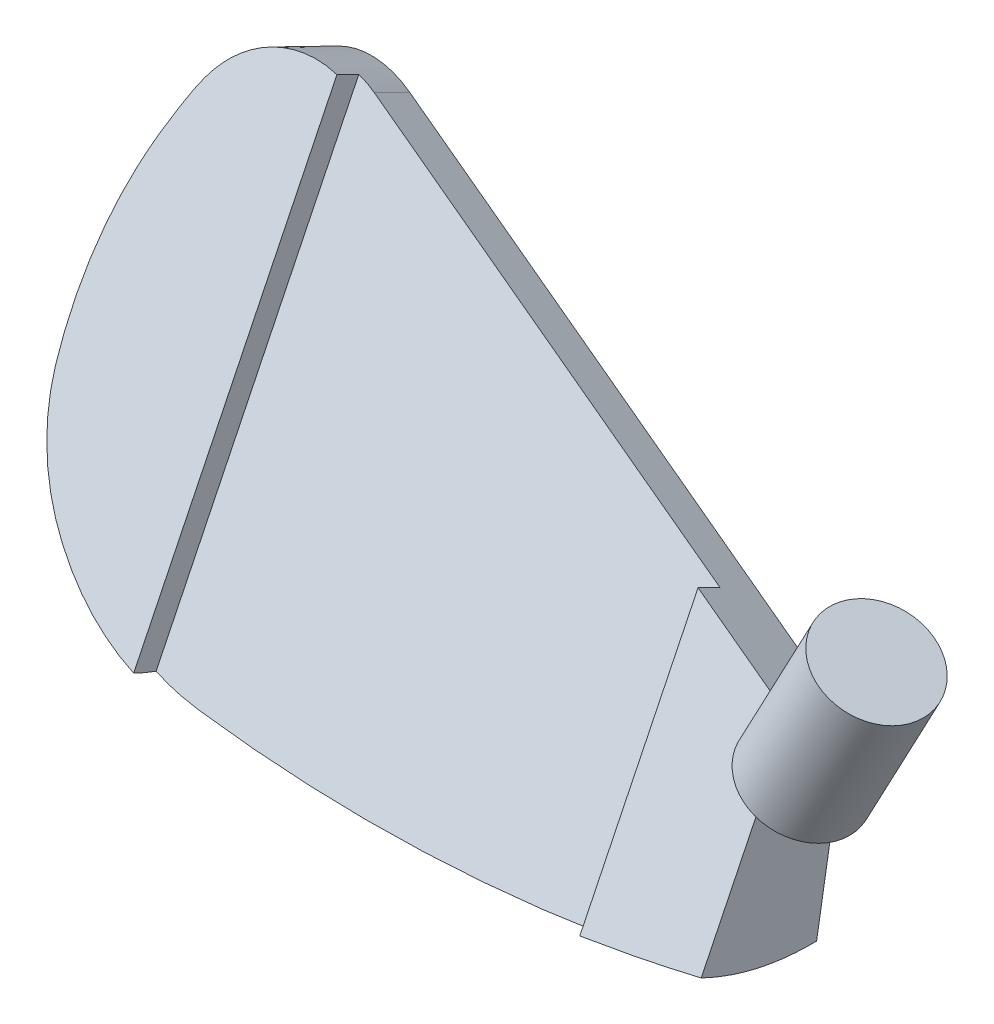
ISO-10303-21;
HEADER;
FILE_DESCRIPTION(('STEP AP214'),'2;1');
FILE_NAME('part.step','',(''),(''),'','','');
FILE_SCHEMA(('AUTOMOTIVE_DESIGN { 1 0 10303 214 1 1 1 1 }'));
ENDSEC;
DATA;
#1=APPLICATION_CONTEXT('core data for automotive mechanical design processes');
#2=APPLICATION_PROTOCOL_DEFINITION('international standard','automotive_design',2000,#1);
#3=PRODUCT_CONTEXT('',#1,'mechanical');
#4=PRODUCT('Part','Part','',(#3));
#5=PRODUCT_RELATED_PRODUCT_CATEGORY('part','',(#4));
#6=PRODUCT_DEFINITION_FORMATION('','',#4);
#7=PRODUCT_DEFINITION_CONTEXT('part definition',#1,'design');
#8=PRODUCT_DEFINITION('design','',#6,#7);
#9=PRODUCT_DEFINITION_SHAPE('','',#8);
#10=(LENGTH_UNIT() NAMED_UNIT(*) SI_UNIT(.MILLI.,.METRE.));
#11=(NAMED_UNIT(*) PLANE_ANGLE_UNIT() SI_UNIT($,.RADIAN.));
#12=(NAMED_UNIT(*) SI_UNIT($,.STERADIAN.) SOLID_ANGLE_UNIT());
#13=UNCERTAINTY_MEASURE_WITH_UNIT(LENGTH_MEASURE(1.E-05),#10,'distance_accuracy_value','');
#14=(GEOMETRIC_REPRESENTATION_CONTEXT(3) GLOBAL_UNCERTAINTY_ASSIGNED_CONTEXT((#13)) GLOBAL_UNIT_ASSIGNED_CONTEXT((#10,
#11,#12)) REPRESENTATION_CONTEXT('',''));
#15=CARTESIAN_POINT('',(0.,0.,0.));
#16=DIRECTION('',(0.,0.,1.));
#17=DIRECTION('',(1.,0.,0.));
#18=AXIS2_PLACEMENT_3D('',#15,#16,#17);
#19=CARTESIAN_POINT('',(57.8545874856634,22.9410481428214,-22.25));
#20=DIRECTION('',(0.469471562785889,0.882947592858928,0.));
#21=DIRECTION('',(-0.882947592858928,0.469471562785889,0.));
#22=AXIS2_PLACEMENT_3D('',#19,#20,#21);
#23=PLANE('',#22);
#24=CARTESIAN_POINT('',(57.8545874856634,22.9410481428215,-22.25));
#25=DIRECTION('',(-0.469471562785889,-0.882947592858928,0.));
#26=DIRECTION('',(0.882947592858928,-0.469471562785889,0.));
#27=AXIS2_PLACEMENT_3D('',#24,#25,#26);
#28=CIRCLE('',#27,6.74999999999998);
#29=CARTESIAN_POINT('',(63.8144837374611,19.7721150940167,-22.25));
#30=VERTEX_POINT('',#29);
#31=EDGE_CURVE('E13',#30,#30,#28,.T.);
#32=ORIENTED_EDGE('',*,*,#31,.T.);
#33=EDGE_LOOP('',(#32));
#34=FACE_BOUND('',#33,.T.);
#35=ADVANCED_FACE('F49',(#34),#23,.F.);
#36=CARTESIAN_POINT('',(38.,-14.4,-22.25));
#37=DIRECTION('',(-0.469471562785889,-0.882947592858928,0.));
#38=DIRECTION('',(0.882947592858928,-0.469471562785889,0.));
#39=AXIS2_PLACEMENT_3D('',#36,#37,#38);
#40=CYLINDRICAL_SURFACE('',#39,6.74999999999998);
#41=ORIENTED_EDGE('',*,*,#31,.F.);
#42=EDGE_LOOP('',(#41));
#43=FACE_BOUND('',#42,.T.);
#44=CARTESIAN_POINT('',(67.2440187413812,40.6,-22.25));
#45=DIRECTION('',(-0.469471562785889,-0.882947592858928,0.));
#46=DIRECTION('',(0.882947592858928,-0.469471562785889,0.));
#47=AXIS2_PLACEMENT_3D('',#44,#45,#46);
#48=CIRCLE('',#47,6.74999999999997);
#49=CARTESIAN_POINT('',(73.2039149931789,37.4310669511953,-22.25));
#50=VERTEX_POINT('',#49);
#51=EDGE_CURVE('E55',#50,#50,#48,.T.);
#52=ORIENTED_EDGE('',*,*,#51,.T.);
#53=EDGE_LOOP('',(#52));
#54=FACE_BOUND('',#53,.T.);
#55=ADVANCED_FACE('F61',(#43,#54),#40,.T.);
#56=CARTESIAN_POINT('',(67.2440187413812,40.6,-22.25));
#57=DIRECTION('',(-0.469471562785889,-0.882947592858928,0.));
#58=DIRECTION('',(0.882947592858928,-0.469471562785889,0.));
#59=AXIS2_PLACEMENT_3D('',#56,#57,#58);
#60=PLANE('',#59);
#61=ORIENTED_EDGE('',*,*,#51,.F.);
#62=EDGE_LOOP('',(#61));
#63=FACE_BOUND('',#62,.T.);
#64=ADVANCED_FACE('F63',(#63),#60,.F.);
#65=CLOSED_SHELL('',(#35,#55,#64));
#66=MANIFOLD_SOLID_BREP('B2',#65);
#67=CARTESIAN_POINT('',(-25.8803943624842,21.5196009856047,-93.9409562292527));
#68=CARTESIAN_POINT('',(-30.4843220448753,23.3619496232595,-94.8395296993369));
#69=CARTESIAN_POINT('',(-35.4655171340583,22.6741939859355,-94.504088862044));
#70=CARTESIAN_POINT('',(-39.2419132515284,19.6747706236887,-93.0411723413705));
#71=CARTESIAN_POINT('',(-40.2784524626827,18.8514936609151,-92.6396333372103));
#72=CARTESIAN_POINT('',(-42.0474399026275,16.895651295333,-91.6857052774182));
#73=CARTESIAN_POINT('',(-43.7197200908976,13.3265017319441,-89.9449147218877));
#74=CARTESIAN_POINT('',(-44.6992385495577,10.9991345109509,-88.8097818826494));
#75=CARTESIAN_POINT('',(-45.1395273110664,9.82052182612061,-88.2349340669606));
#76=CARTESIAN_POINT('',(-47.2481803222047,4.17585086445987,-85.4818440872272));
#77=CARTESIAN_POINT('',(-48.2003588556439,-1.71667390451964,-82.6078677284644));
#78=CARTESIAN_POINT('',(-47.9653967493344,-7.66727597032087,-79.7055651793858));
#79=CARTESIAN_POINT('',(-47.9362458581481,-8.40554545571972,-79.345487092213));
#80=CARTESIAN_POINT('',(-47.8411191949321,-9.88090980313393,-78.6259038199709));
#81=CARTESIAN_POINT('',(-47.5918882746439,-12.1019499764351,-77.5426301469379));
#82=CARTESIAN_POINT('',(-47.2540640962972,-13.5499001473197,-76.836417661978));
#83=CARTESIAN_POINT('',(-47.0440497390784,-14.264111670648,-76.4880734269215));
#84=CARTESIAN_POINT('',(-46.4100384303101,-16.420241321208,-75.4364587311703));
#85=CARTESIAN_POINT('',(-45.4120982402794,-18.4620818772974,-74.44058655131));
#86=CARTESIAN_POINT('',(-44.074317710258,-20.3403468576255,-73.524495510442));
#87=CARTESIAN_POINT('',(-43.5219378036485,-21.1158969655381,-73.1462344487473));
#88=CARTESIAN_POINT('',(-42.3059075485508,-22.6029753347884,-72.4209378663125));
#89=CARTESIAN_POINT('',(-40.1549025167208,-24.6380624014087,-71.4283595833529));
#90=CARTESIAN_POINT('',(-38.5998062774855,-25.8411048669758,-70.8415965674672));
#91=CARTESIAN_POINT('',(-37.7898607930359,-26.405037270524,-70.5665483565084));
#92=CARTESIAN_POINT('',(-34.8433252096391,-28.4565912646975,-69.5659386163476));
#93=CARTESIAN_POINT('',(-31.5242248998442,-29.9807664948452,-68.8225486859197));
#94=CARTESIAN_POINT('',(-27.9479803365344,-30.9245603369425,-68.362229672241));
#95=CARTESIAN_POINT('',(-26.766069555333,-31.236474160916,-68.210099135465));
#96=CARTESIAN_POINT('',(-24.3591595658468,-31.7284059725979,-67.9701679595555));
#97=CARTESIAN_POINT('',(-20.6530087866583,-32.0443735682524,-67.816060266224));
#98=CARTESIAN_POINT('',(-18.1977148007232,-32.2270702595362,-67.7269531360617));
#99=CARTESIAN_POINT('',(-16.969324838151,-32.3094712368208,-67.6867634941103));
#100=CARTESIAN_POINT('',(5.25608081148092,-33.8003619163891,-66.9596075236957));
#101=CARTESIAN_POINT('',(27.4861831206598,-32.3671535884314,-67.6586299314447));
#102=CARTESIAN_POINT('',(49.2472919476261,-28.0403857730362,-69.7689355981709));
#103=(BOUNDED_CURVE() B_SPLINE_CURVE(3,(#67,#68,#69,#70,#71,#72,#73,#74,#75,#76,#77,#78,#79,#80,
#81,#82,#83,#84,#85,#86,#87,#88,#89,#90,#91,#92,#93,#94,#95,#96,#97,#98,#99,#100,#101,#102),
.UNSPECIFIED.,.F.,.F.) B_SPLINE_CURVE_WITH_KNOTS((4,3,1,1,3,3,1,1,3,3,1,1,3,3,1,1,3,4),(0.,
0.085474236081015,0.111712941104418,0.13795164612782,0.164190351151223,0.288505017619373,
0.304095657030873,0.319686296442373,0.335276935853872,0.38196473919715,0.401398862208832,
0.420832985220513,0.440267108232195,0.51014781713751,0.533513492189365,0.55687916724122,
0.580244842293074,1.),
.UNSPECIFIED.) CURVE() GEOMETRIC_REPRESENTATION_ITEM() RATIONAL_B_SPLINE_CURVE((1.,
0.894130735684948,0.894130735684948,1.,1.,1.,1.,1.,1.,0.98926456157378,0.98926456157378,1.,1.,
1.,1.,1.,1.,0.991953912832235,0.991953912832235,1.,1.,1.,1.,1.,1.,0.988408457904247,
0.988408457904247,1.,1.,1.,1.,1.,1.,0.992897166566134,0.992897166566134,1.)) REPRESENTATION_ITEM(''));
#104=DIRECTION('',(0.,0.438371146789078,0.898794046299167));
#105=VECTOR('',#104,1.);
#106=SURFACE_OF_LINEAR_EXTRUSION('',#103,#105);
#107=CARTESIAN_POINT('',(-43.6758501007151,24.0667546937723,-68.014394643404));
#108=CARTESIAN_POINT('',(-43.7664372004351,23.9785215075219,-67.6790086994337));
#109=CARTESIAN_POINT('',(-43.8528463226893,23.901419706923,-67.3397586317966));
#110=CARTESIAN_POINT('',(-44.0176495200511,23.7675765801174,-66.6562884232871));
#111=CARTESIAN_POINT('',(-44.0960638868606,23.7107827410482,-66.3120835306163));
#112=CARTESIAN_POINT('',(-44.2456388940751,23.6152444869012,-65.6199065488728));
#113=CARTESIAN_POINT('',(-44.3168039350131,23.5764890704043,-65.2719368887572));
#114=CARTESIAN_POINT('',(-44.4520739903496,23.515358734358,-64.5757185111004));
#115=CARTESIAN_POINT('',(-44.5162240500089,23.4928733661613,-64.2274880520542));
#116=CARTESIAN_POINT('',(-44.6386317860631,23.4622501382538,-63.5291756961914));
#117=CARTESIAN_POINT('',(-44.6968859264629,23.4541208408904,-63.1790928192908));
#118=CARTESIAN_POINT('',(-44.8080144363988,23.4508352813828,-62.477983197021));
#119=CARTESIAN_POINT('',(-44.8608880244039,23.455680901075,-62.1269563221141));
#120=CARTESIAN_POINT('',(-44.9732728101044,23.479583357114,-61.3443727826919));
#121=CARTESIAN_POINT('',(-45.031542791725,23.5016325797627,-60.912730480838));
#122=CARTESIAN_POINT('',(-45.1415802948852,23.5614169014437,-60.0498486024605));
#123=CARTESIAN_POINT('',(-45.1933494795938,23.5991479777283,-59.6186089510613));
#124=CARTESIAN_POINT('',(-45.2911761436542,23.6890707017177,-58.7563435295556));
#125=CARTESIAN_POINT('',(-45.337224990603,23.7412838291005,-58.3253190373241));
#126=CARTESIAN_POINT('',(-45.4240788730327,23.8592683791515,-57.4645974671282));
#127=CARTESIAN_POINT('',(-45.4648837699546,23.9250401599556,-57.034900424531));
#128=CARTESIAN_POINT('',(-45.5396137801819,24.065433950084,-56.2007324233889));
#129=CARTESIAN_POINT('',(-45.5737933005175,24.1393738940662,-55.7961688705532));
#130=CARTESIAN_POINT('',(-45.6382465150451,24.2980793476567,-54.9888714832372));
#131=CARTESIAN_POINT('',(-45.6685202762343,24.3828446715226,-54.5861376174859));
#132=CARTESIAN_POINT('',(-45.7254997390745,24.5624739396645,-53.7829167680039));
#133=CARTESIAN_POINT('',(-45.7522074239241,24.6573322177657,-53.382428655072));
#134=CARTESIAN_POINT('',(-45.8023594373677,24.8566495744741,-52.5836546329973));
#135=CARTESIAN_POINT('',(-45.8258037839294,24.9611086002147,-52.185368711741));
#136=CARTESIAN_POINT('',(-45.8834229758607,25.2474978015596,-51.1422628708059));
#137=CARTESIAN_POINT('',(-45.9151153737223,25.4369542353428,-50.4993601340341));
#138=CARTESIAN_POINT('',(-45.9713380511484,25.838507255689,-49.2203392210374));
#139=CARTESIAN_POINT('',(-45.9958679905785,26.0506049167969,-48.5842213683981));
#140=CARTESIAN_POINT('',(-46.0320157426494,26.4299333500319,-47.5077593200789));
#141=CARTESIAN_POINT('',(-46.0453032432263,26.5917103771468,-47.0655395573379));
#142=CARTESIAN_POINT('',(-46.0687723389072,26.9255809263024,-46.1849665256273));
#143=CARTESIAN_POINT('',(-46.0789541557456,27.0976737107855,-45.7466129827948));
#144=CARTESIAN_POINT('',(-46.0986640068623,27.4998478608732,-44.7560172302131));
#145=CARTESIAN_POINT('',(-46.1072717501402,27.7330319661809,-44.2050113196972));
#146=CARTESIAN_POINT('',(-46.1172291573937,28.1176035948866,-43.3320396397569));
#147=CARTESIAN_POINT('',(-46.1201065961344,28.26381827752,-43.0077977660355));
#148=CARTESIAN_POINT('',(-46.1244149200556,28.5777029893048,-42.3276004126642));
#149=CARTESIAN_POINT('',(-46.125659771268,28.7460027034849,-41.971933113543));
#150=CARTESIAN_POINT('',(-46.1259081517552,28.9365330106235,-41.579172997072));
#151=CARTESIAN_POINT('',(-46.1259204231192,28.9553795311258,-41.5404274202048));
#152=CARTESIAN_POINT('',(-46.1259204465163,28.9742671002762,-41.5017020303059));
#153=B_SPLINE_CURVE_WITH_KNOTS('',3,(#107,#108,#109,#110,#111,#112,#113,#114,#115,#116,#117,
#118,#119,#120,#121,#122,#123,#124,#125,#126,#127,#128,#129,#130,#131,#132,#133,#134,#135,#136,
#137,#138,#139,#140,#141,#142,#143,#144,#145,#146,#147,#148,#149,#150,#151,#152),.UNSPECIFIED.,
.F.,.F.,(4,2,2,2,2,2,2,2,2,2,2,2,2,2,2,2,2,2,2,2,2,2,4),(0.,1.07482231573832,2.14684487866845,
3.2182127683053,4.28223768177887,5.34689699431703,6.41171072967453,7.71966790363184,
9.0272897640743,10.3368615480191,11.6464679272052,12.8843439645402,14.1221987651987,
15.3593622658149,16.5965189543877,18.6089630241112,20.6215026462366,22.0345780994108,
23.4475526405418,25.2423781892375,26.3094214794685,27.489762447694,27.6190205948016),.UNSPECIFIED.);
#154=CARTESIAN_POINT('',(-46.1259204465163,28.9742671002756,-41.5017020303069));
#155=VERTEX_POINT('',#154);
#156=CARTESIAN_POINT('',(-45.5747824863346,24.1449049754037,-55.7766233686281));
#157=VERTEX_POINT('',#156);
#158=EDGE_CURVE('E336',#155,#157,#153,.F.);
#159=ORIENTED_EDGE('',*,*,#158,.F.);
#160=CARTESIAN_POINT('',(-25.8803943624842,43.6135067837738,-48.6417362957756));
#161=CARTESIAN_POINT('',(-30.4843220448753,45.4558554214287,-49.5403097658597));
#162=CARTESIAN_POINT('',(-35.4655171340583,44.7680997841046,-49.2048689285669));
#163=CARTESIAN_POINT('',(-39.2419132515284,41.7686764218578,-47.7419524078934));
#164=CARTESIAN_POINT('',(-40.2784524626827,40.9453994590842,-47.3404134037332));
#165=CARTESIAN_POINT('',(-42.0474399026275,38.9895570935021,-46.386485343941));
#166=CARTESIAN_POINT('',(-43.7197200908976,35.4204075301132,-44.6456947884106));
#167=CARTESIAN_POINT('',(-44.6992385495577,33.0930403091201,-43.5105619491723));
#168=CARTESIAN_POINT('',(-45.1395273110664,31.9144276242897,-42.9357141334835));
#169=CARTESIAN_POINT('',(-47.2481803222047,26.269756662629,-40.1826241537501));
#170=CARTESIAN_POINT('',(-48.2003588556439,20.3772318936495,-37.3086477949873));
#171=CARTESIAN_POINT('',(-47.9653967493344,14.4266298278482,-34.4063452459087));
#172=CARTESIAN_POINT('',(-47.9362458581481,13.6883603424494,-34.0462671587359));
#173=CARTESIAN_POINT('',(-47.8411191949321,12.2129959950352,-33.3266838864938));
#174=CARTESIAN_POINT('',(-47.5918882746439,9.99195582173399,-32.2434102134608));
#175=CARTESIAN_POINT('',(-47.2540640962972,8.54400565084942,-31.5371977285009));
#176=CARTESIAN_POINT('',(-47.0440497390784,7.82979412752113,-31.1888534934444));
#177=CARTESIAN_POINT('',(-46.4100384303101,5.67366447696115,-30.1372387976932));
#178=CARTESIAN_POINT('',(-45.4120982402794,3.63182392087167,-29.1413666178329));
#179=CARTESIAN_POINT('',(-44.074317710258,1.75355894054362,-28.2252755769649));
#180=CARTESIAN_POINT('',(-43.5219378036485,0.978008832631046,-27.8470145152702));
#181=CARTESIAN_POINT('',(-42.3059075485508,-0.50906953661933,-27.1217179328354));
#182=CARTESIAN_POINT('',(-40.1549025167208,-2.54415660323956,-26.1291396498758));
#183=CARTESIAN_POINT('',(-38.5998062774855,-3.74719906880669,-25.5423766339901));
#184=CARTESIAN_POINT('',(-37.7898607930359,-4.31113147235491,-25.2673284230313));
#185=CARTESIAN_POINT('',(-34.8433252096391,-6.36268546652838,-24.2667186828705));
#186=CARTESIAN_POINT('',(-31.5242248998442,-7.88686069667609,-23.5233287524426));
#187=CARTESIAN_POINT('',(-27.9479803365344,-8.83065453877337,-23.0630097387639));
#188=CARTESIAN_POINT('',(-26.766069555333,-9.14256836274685,-22.9108792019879));
#189=CARTESIAN_POINT('',(-24.3591595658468,-9.63450017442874,-22.6709480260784));
#190=CARTESIAN_POINT('',(-20.6530087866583,-9.95046777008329,-22.5168403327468));
#191=CARTESIAN_POINT('',(-18.1977148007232,-10.1331644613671,-22.4277332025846));
#192=CARTESIAN_POINT('',(-16.969324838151,-10.2155654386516,-22.3875435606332));
#193=CARTESIAN_POINT('',(5.25608081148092,-11.70645611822,-21.6603875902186));
#194=CARTESIAN_POINT('',(27.4861831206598,-10.2732477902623,-22.3594099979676));
#195=CARTESIAN_POINT('',(49.2472919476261,-5.94647997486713,-24.4697156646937));
#196=(BOUNDED_CURVE() B_SPLINE_CURVE(3,(#160,#161,#162,#163,#164,#165,#166,#167,#168,#169,#170,
#171,#172,#173,#174,#175,#176,#177,#178,#179,#180,#181,#182,#183,#184,#185,#186,#187,#188,#189,
#190,#191,#192,#193,#194,#195),.UNSPECIFIED.,.F.,.F.) B_SPLINE_CURVE_WITH_KNOTS((4,3,1,1,3,3,1,
1,3,3,1,1,3,3,1,1,3,4),(0.,0.085474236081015,0.111712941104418,0.13795164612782,
0.164190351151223,0.288505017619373,0.304095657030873,0.319686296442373,0.335276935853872,
0.38196473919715,0.401398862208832,0.420832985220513,0.440267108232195,0.51014781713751,
0.533513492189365,0.55687916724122,0.580244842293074,1.),
.UNSPECIFIED.) CURVE() GEOMETRIC_REPRESENTATION_ITEM() RATIONAL_B_SPLINE_CURVE((1.,
0.894130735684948,0.894130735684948,1.,1.,1.,1.,1.,1.,0.98926456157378,0.98926456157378,1.,1.,
1.,1.,1.,1.,0.991953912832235,0.991953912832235,1.,1.,1.,1.,1.,1.,0.988408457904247,
0.988408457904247,1.,1.,1.,1.,1.,1.,0.992897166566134,0.992897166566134,1.)) REPRESENTATION_ITEM(''));
#197=CARTESIAN_POINT('',(-28.2,44.3065918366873,-48.9797764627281));
#198=VERTEX_POINT('',#197);
#199=EDGE_CURVE('E414',#155,#198,#196,.F.);
#200=ORIENTED_EDGE('',*,*,#199,.T.);
#201=DIRECTION('',(0.,0.438371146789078,0.898794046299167));
#202=VECTOR('',#201,1.);
#203=CARTESIAN_POINT('',(-28.2,22.2126860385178,-94.2789963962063));
#204=LINE('',#203,#202);
#205=CARTESIAN_POINT('',(-28.2,42.9476412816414,-51.7660380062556));
#206=VERTEX_POINT('',#205);
#207=EDGE_CURVE('E308',#198,#206,#204,.F.);
#208=ORIENTED_EDGE('',*,*,#207,.T.);
#209=CARTESIAN_POINT('',(-25.8803943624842,42.2545562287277,-51.427997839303));
#210=CARTESIAN_POINT('',(-30.4843220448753,44.0969048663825,-52.3265713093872));
#211=CARTESIAN_POINT('',(-35.4655171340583,43.4091492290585,-51.9911304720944));
#212=CARTESIAN_POINT('',(-39.2419132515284,40.4097258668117,-50.5282139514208));
#213=CARTESIAN_POINT('',(-40.2784524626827,39.586448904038,-50.1266749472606));
#214=CARTESIAN_POINT('',(-42.0474399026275,37.630606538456,-49.1727468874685));
#215=CARTESIAN_POINT('',(-43.7197200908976,34.061456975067,-47.4319563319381));
#216=CARTESIAN_POINT('',(-44.6992385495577,31.7340897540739,-46.2968234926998));
#217=CARTESIAN_POINT('',(-45.1395273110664,30.5554770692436,-45.7219756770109));
#218=CARTESIAN_POINT('',(-47.2481803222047,24.9108061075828,-42.9688856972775));
#219=CARTESIAN_POINT('',(-48.2003588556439,19.0182813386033,-40.0949093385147));
#220=CARTESIAN_POINT('',(-47.9653967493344,13.0676792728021,-37.1926067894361));
#221=CARTESIAN_POINT('',(-47.9362458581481,12.3294097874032,-36.8325287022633));
#222=CARTESIAN_POINT('',(-47.8411191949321,10.854045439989,-36.1129454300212));
#223=CARTESIAN_POINT('',(-47.5918882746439,8.63300526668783,-35.0296717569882));
#224=CARTESIAN_POINT('',(-47.2540640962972,7.18505509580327,-34.3234592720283));
#225=CARTESIAN_POINT('',(-47.0440497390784,6.47084357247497,-33.9751150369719));
#226=CARTESIAN_POINT('',(-46.4100384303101,4.314713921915,-32.9235003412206));
#227=CARTESIAN_POINT('',(-45.4120982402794,2.27287336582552,-31.9276281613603));
#228=CARTESIAN_POINT('',(-44.074317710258,0.394608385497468,-31.0115371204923));
#229=CARTESIAN_POINT('',(-43.5219378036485,-0.380941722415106,-30.6332760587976));
#230=CARTESIAN_POINT('',(-42.3059075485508,-1.86802009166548,-29.9079794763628));
#231=CARTESIAN_POINT('',(-40.1549025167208,-3.90310715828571,-28.9154011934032));
#232=CARTESIAN_POINT('',(-38.5998062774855,-5.10614962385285,-28.3286381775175));
#233=CARTESIAN_POINT('',(-37.7898607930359,-5.67008202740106,-28.0535899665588));
#234=CARTESIAN_POINT('',(-34.8433252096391,-7.72163602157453,-27.0529802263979));
#235=CARTESIAN_POINT('',(-31.5242248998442,-9.24581125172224,-26.30959029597));
#236=CARTESIAN_POINT('',(-27.9479803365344,-10.1896050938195,-25.8492712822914));
#237=CARTESIAN_POINT('',(-26.766069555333,-10.501518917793,-25.6971407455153));
#238=CARTESIAN_POINT('',(-24.3591595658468,-10.9934507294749,-25.4572095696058));
#239=CARTESIAN_POINT('',(-20.6530087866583,-11.3094183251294,-25.3031018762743));
#240=CARTESIAN_POINT('',(-18.1977148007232,-11.4921150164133,-25.213994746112));
#241=CARTESIAN_POINT('',(-16.969324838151,-11.5745159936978,-25.1738051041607));
#242=CARTESIAN_POINT('',(5.25608081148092,-13.0654066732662,-24.446649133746));
#243=CARTESIAN_POINT('',(27.4861831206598,-11.6321983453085,-25.145671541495));
#244=CARTESIAN_POINT('',(49.2472919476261,-7.30543052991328,-27.2559772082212));
#245=(BOUNDED_CURVE() B_SPLINE_CURVE(3,(#209,#210,#211,#212,#213,#214,#215,#216,#217,#218,#219,
#220,#221,#222,#223,#224,#225,#226,#227,#228,#229,#230,#231,#232,#233,#234,#235,#236,#237,#238,
#239,#240,#241,#242,#243,#244),.UNSPECIFIED.,.F.,.F.) B_SPLINE_CURVE_WITH_KNOTS((4,3,1,1,3,3,1,
1,3,3,1,1,3,3,1,1,3,4),(0.,0.085474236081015,0.111712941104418,0.13795164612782,
0.164190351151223,0.288505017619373,0.304095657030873,0.319686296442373,0.335276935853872,
0.38196473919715,0.401398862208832,0.420832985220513,0.440267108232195,0.51014781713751,
0.533513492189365,0.55687916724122,0.580244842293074,1.),
.UNSPECIFIED.) CURVE() GEOMETRIC_REPRESENTATION_ITEM() RATIONAL_B_SPLINE_CURVE((1.,
0.894130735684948,0.894130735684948,1.,1.,1.,1.,1.,1.,0.98926456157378,0.98926456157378,1.,1.,
1.,1.,1.,1.,0.991953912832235,0.991953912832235,1.,1.,1.,1.,1.,1.,0.988408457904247,
0.988408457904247,1.,1.,1.,1.,1.,1.,0.992897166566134,0.992897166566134,1.)) REPRESENTATION_ITEM(''));
#246=CARTESIAN_POINT('',(-25.8803943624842,42.2545562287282,-51.4279978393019));
#247=VERTEX_POINT('',#246);
#248=EDGE_CURVE('E319',#206,#247,#245,.F.);
#249=ORIENTED_EDGE('',*,*,#248,.T.);
#250=DIRECTION('',(0.,0.438371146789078,0.898794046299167));
#251=VECTOR('',#250,1.);
#252=CARTESIAN_POINT('',(-25.8803943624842,21.5196009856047,-93.9409562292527));
#253=LINE('',#252,#251);
#254=CARTESIAN_POINT('',(-25.8803943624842,40.0627004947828,-55.9219680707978));
#255=VERTEX_POINT('',#254);
#256=EDGE_CURVE('E318',#255,#247,#253,.T.);
#257=ORIENTED_EDGE('',*,*,#256,.F.);
#258=CARTESIAN_POINT('',(-25.8803943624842,40.0627004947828,-55.9219680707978));
#259=CARTESIAN_POINT('',(-26.0353272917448,40.1247001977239,-55.9522072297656));
#260=CARTESIAN_POINT('',(-26.191645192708,40.1833668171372,-55.9820651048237));
#261=CARTESIAN_POINT('',(-26.5067997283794,40.2939482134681,-56.0409717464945));
#262=CARTESIAN_POINT('',(-26.6656363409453,40.3458630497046,-56.0700205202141));
#263=CARTESIAN_POINT('',(-27.1454187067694,40.49131264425,-56.1558603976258));
#264=CARTESIAN_POINT('',(-27.4697660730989,40.5746041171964,-56.2113702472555));
#265=CARTESIAN_POINT('',(-28.1243599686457,40.7131463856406,-56.3184453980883));
#266=CARTESIAN_POINT('',(-28.4545948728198,40.7684472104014,-56.3700175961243));
#267=CARTESIAN_POINT('',(-29.1191993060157,40.8509976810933,-56.4689896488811));
#268=CARTESIAN_POINT('',(-29.4535690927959,40.8782455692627,-56.5163892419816));
#269=CARTESIAN_POINT('',(-30.1240275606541,40.9046773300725,-56.6067044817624));
#270=CARTESIAN_POINT('',(-30.4601163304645,40.9038597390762,-56.6496198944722));
#271=CARTESIAN_POINT('',(-31.1315766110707,40.8744015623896,-56.7306951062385));
#272=CARTESIAN_POINT('',(-31.4669482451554,40.8457662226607,-56.7688558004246));
#273=CARTESIAN_POINT('',(-32.1345966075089,40.761163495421,-56.840199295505));
#274=CARTESIAN_POINT('',(-32.4668746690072,40.7052084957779,-56.873384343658));
#275=CARTESIAN_POINT('',(-33.126558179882,40.5665834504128,-56.9346522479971));
#276=CARTESIAN_POINT('',(-33.4539595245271,40.4838920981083,-56.9627310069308));
#277=CARTESIAN_POINT('',(-34.1080244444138,40.2907338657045,-57.0141382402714));
#278=CARTESIAN_POINT('',(-34.4345417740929,40.1797436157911,-57.0373602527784));
#279=CARTESIAN_POINT('',(-35.0781058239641,39.9318666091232,-57.0782502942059));
#280=CARTESIAN_POINT('',(-35.3951483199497,39.794968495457,-57.0959158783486));
#281=CARTESIAN_POINT('',(-36.0177634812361,39.4964641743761,-57.125636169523));
#282=CARTESIAN_POINT('',(-36.323332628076,39.3348504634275,-57.1376891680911));
#283=CARTESIAN_POINT('',(-36.9209754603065,38.9883356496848,-57.1561629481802));
#284=CARTESIAN_POINT('',(-37.2130542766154,38.8034435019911,-57.1625858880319));
#285=CARTESIAN_POINT('',(-37.7959382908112,38.4022601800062,-57.1700054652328));
#286=CARTESIAN_POINT('',(-38.0860003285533,38.1848836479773,-57.1707249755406));
#287=CARTESIAN_POINT('',(-38.6475662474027,37.7279927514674,-57.1660759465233));
#288=CARTESIAN_POINT('',(-38.9190890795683,37.4885016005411,-57.1607137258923));
#289=CARTESIAN_POINT('',(-39.4415183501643,36.9896693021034,-57.1440210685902));
#290=CARTESIAN_POINT('',(-39.6924821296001,36.7303875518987,-57.1327079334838));
#291=CARTESIAN_POINT('',(-40.1740938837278,36.193728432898,-57.1044460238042));
#292=CARTESIAN_POINT('',(-40.404732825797,35.9163431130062,-57.0874947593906));
#293=CARTESIAN_POINT('',(-40.8296046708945,35.366261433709,-57.0497146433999));
#294=CARTESIAN_POINT('',(-41.0252604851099,35.0946375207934,-57.0292478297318));
#295=CARTESIAN_POINT('',(-41.3052659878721,34.6784291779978,-56.9953506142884));
#296=CARTESIAN_POINT('',(-41.3963686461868,34.5382072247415,-56.9835165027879));
#297=CARTESIAN_POINT('',(-41.5740965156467,34.2550389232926,-56.9588180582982));
#298=CARTESIAN_POINT('',(-41.6607217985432,34.112092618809,-56.9459537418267));
#299=CARTESIAN_POINT('',(-41.829432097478,33.8237032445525,-56.9192249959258));
#300=CARTESIAN_POINT('',(-41.9115185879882,33.6782610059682,-56.9053608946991));
#301=CARTESIAN_POINT('',(-42.0713686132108,33.3851164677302,-56.8767000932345));
#302=CARTESIAN_POINT('',(-42.1491320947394,33.2374141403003,-56.861903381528));
#303=CARTESIAN_POINT('',(-42.3778073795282,32.7892191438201,-56.8160691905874));
#304=CARTESIAN_POINT('',(-42.522833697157,32.4858406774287,-56.7837940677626));
#305=CARTESIAN_POINT('',(-42.73129107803,32.026885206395,-56.7335663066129));
#306=CARTESIAN_POINT('',(-42.799272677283,31.8732288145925,-56.7165185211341));
#307=CARTESIAN_POINT('',(-42.9326583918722,31.5648563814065,-56.6819151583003));
#308=CARTESIAN_POINT('',(-42.9980625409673,31.4101403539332,-56.6643595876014));
#309=CARTESIAN_POINT('',(-43.1267844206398,31.0997556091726,-56.6288214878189));
#310=CARTESIAN_POINT('',(-43.1901005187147,30.9440862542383,-56.610838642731));
#311=CARTESIAN_POINT('',(-43.2838048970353,30.7101018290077,-56.5836211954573));
#312=CARTESIAN_POINT('',(-43.314828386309,30.6320261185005,-56.5745080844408));
#313=CARTESIAN_POINT('',(-43.3765075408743,30.4757375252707,-56.5562117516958));
#314=CARTESIAN_POINT('',(-43.407163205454,30.3975246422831,-56.5470285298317));
#315=CARTESIAN_POINT('',(-43.5227349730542,30.1009396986,-56.5121190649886));
#316=CARTESIAN_POINT('',(-43.6065948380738,29.8821802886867,-56.4861925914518));
#317=CARTESIAN_POINT('',(-43.7731001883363,29.444226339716,-56.4341111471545));
#318=CARTESIAN_POINT('',(-43.8557456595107,29.2250317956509,-56.4079561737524));
#319=CARTESIAN_POINT('',(-44.0195912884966,28.786127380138,-56.3553747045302));
#320=CARTESIAN_POINT('',(-44.100791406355,28.5664174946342,-56.3289482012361));
#321=CARTESIAN_POINT('',(-44.2615223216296,28.1264269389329,-56.2757856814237));
#322=CARTESIAN_POINT('',(-44.3410531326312,27.9061462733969,-56.249049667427));
#323=CARTESIAN_POINT('',(-44.4982185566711,27.46495736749,-56.1952295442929));
#324=CARTESIAN_POINT('',(-44.5758532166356,27.2440491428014,-56.1681454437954));
#325=CARTESIAN_POINT('',(-44.7290034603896,26.8015455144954,-56.1135906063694));
#326=CARTESIAN_POINT('',(-44.8045190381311,26.5799501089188,-56.0861198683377));
#327=CARTESIAN_POINT('',(-44.9532110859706,26.1360380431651,-56.0307578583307));
#328=CARTESIAN_POINT('',(-45.0263876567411,25.9137214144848,-56.0028666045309));
#329=CARTESIAN_POINT('',(-45.1701731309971,25.4683171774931,-55.9466259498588));
#330=CARTESIAN_POINT('',(-45.240782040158,25.2452295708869,-55.9182765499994));
#331=CARTESIAN_POINT('',(-45.3793669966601,24.7983809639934,-55.8611276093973));
#332=CARTESIAN_POINT('',(-45.4473439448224,24.5746202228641,-55.8323282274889));
#333=CARTESIAN_POINT('',(-45.5806881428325,24.126381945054,-55.774275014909));
#334=CARTESIAN_POINT('',(-45.6460553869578,23.9019044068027,-55.7450211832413));
#335=CARTESIAN_POINT('',(-45.8382289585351,23.2274254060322,-55.6565810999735));
#336=CARTESIAN_POINT('',(-45.9611045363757,22.7763859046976,-55.596717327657));
#337=CARTESIAN_POINT('',(-46.1963073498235,21.8717424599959,-55.4752087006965));
#338=CARTESIAN_POINT('',(-46.3086332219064,21.4181381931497,-55.4135636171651));
#339=CARTESIAN_POINT('',(-46.5226431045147,20.5086806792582,-55.2885332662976));
#340=CARTESIAN_POINT('',(-46.6243272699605,20.0528274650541,-55.2251480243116));
#341=CARTESIAN_POINT('',(-46.9131566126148,18.6829926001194,-55.0325327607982));
#342=CARTESIAN_POINT('',(-47.0842861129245,17.7659377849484,-54.9007360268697));
#343=CARTESIAN_POINT('',(-47.3833288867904,15.9253778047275,-54.6305254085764));
#344=CARTESIAN_POINT('',(-47.5112226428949,15.0018699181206,-54.4921085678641));
#345=CARTESIAN_POINT('',(-47.7232365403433,13.1509628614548,-54.209015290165));
#346=CARTESIAN_POINT('',(-47.8073642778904,12.2235643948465,-54.0643399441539));
#347=CARTESIAN_POINT('',(-47.9314539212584,10.3674434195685,-53.7691097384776));
#348=CARTESIAN_POINT('',(-47.9714499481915,9.43872249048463,-53.6185595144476));
#349=CARTESIAN_POINT('',(-47.9972419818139,8.09458407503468,-53.3965568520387));
#350=CARTESIAN_POINT('',(-48.0007745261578,7.67906756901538,-53.327359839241));
#351=CARTESIAN_POINT('',(-47.99894212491,6.84831206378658,-53.1878725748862));
#352=CARTESIAN_POINT('',(-47.9935789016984,6.43307302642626,-53.1175825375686));
#353=CARTESIAN_POINT('',(-47.9739191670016,5.60288268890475,-52.9759063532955));
#354=CARTESIAN_POINT('',(-47.9596203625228,5.18793148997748,-52.9045199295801));
#355=CARTESIAN_POINT('',(-47.9315152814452,4.5658016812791,-52.7966373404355));
#356=CARTESIAN_POINT('',(-47.9210325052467,4.35840052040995,-52.7605296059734));
#357=CARTESIAN_POINT('',(-47.8978811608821,3.94376316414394,-52.6880617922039));
#358=CARTESIAN_POINT('',(-47.8852125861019,3.73652696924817,-52.6517017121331));
#359=CARTESIAN_POINT('',(-47.8577527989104,3.32292567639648,-52.5788556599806));
#360=CARTESIAN_POINT('',(-47.8429687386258,3.11655996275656,-52.5423705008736));
#361=CARTESIAN_POINT('',(-47.8113154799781,2.704032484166,-52.4691672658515));
#362=CARTESIAN_POINT('',(-47.7944462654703,2.49787072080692,-52.432449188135));
#363=CARTESIAN_POINT('',(-47.7396467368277,1.87990701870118,-52.3218454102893));
#364=CARTESIAN_POINT('',(-47.6975182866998,1.46852474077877,-52.2474922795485));
#365=CARTESIAN_POINT('',(-47.6213443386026,0.853490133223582,-52.1346414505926));
#366=CARTESIAN_POINT('',(-47.5938048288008,0.648910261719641,-52.0968216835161));
#367=CARTESIAN_POINT('',(-47.5335463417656,0.240608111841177,-52.0206624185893));
#368=CARTESIAN_POINT('',(-47.5008274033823,0.0368858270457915,-51.9823229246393));
#369=CARTESIAN_POINT('',(-47.4301414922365,-0.369483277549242,-51.9051519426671));
#370=CARTESIAN_POINT('',(-47.3921762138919,-0.572130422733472,-51.8663206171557));
#371=CARTESIAN_POINT('',(-47.3110498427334,-0.976288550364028,-51.7881828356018));
#372=CARTESIAN_POINT('',(-47.2678886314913,-1.17779950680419,-51.748876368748));
#373=CARTESIAN_POINT('',(-47.1231202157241,-1.81361881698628,-51.6237547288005));
#374=CARTESIAN_POINT('',(-47.0120028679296,-2.24564063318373,-51.5371045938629));
#375=CARTESIAN_POINT('',(-46.7658584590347,-3.10281731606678,-51.3618925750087));
#376=CARTESIAN_POINT('',(-46.6308107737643,-3.52796591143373,-51.2733291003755));
#377=CARTESIAN_POINT('',(-46.3369999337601,-4.36979833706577,-51.094583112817));
#378=CARTESIAN_POINT('',(-46.1782298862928,-4.78647966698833,-51.0044001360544));
#379=CARTESIAN_POINT('',(-45.8374874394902,-5.60944675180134,-50.822804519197));
#380=CARTESIAN_POINT('',(-45.6555392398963,-6.01574282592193,-50.7313932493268));
#381=CARTESIAN_POINT('',(-45.2687632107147,-6.81686574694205,-50.5475623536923));
#382=CARTESIAN_POINT('',(-45.0639439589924,-7.21169682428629,-50.4551431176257));
#383=CARTESIAN_POINT('',(-44.6318796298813,-7.98861168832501,-50.2695686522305));
#384=CARTESIAN_POINT('',(-44.4046396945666,-8.37069837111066,-50.1764135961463));
#385=CARTESIAN_POINT('',(-43.9881993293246,-9.0264667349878,-50.0131473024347));
#386=CARTESIAN_POINT('',(-43.8038087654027,-9.30324073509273,-49.943133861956));
#387=CARTESIAN_POINT('',(-43.4230589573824,-9.84842709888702,-49.8029754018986));
#388=CARTESIAN_POINT('',(-43.2266990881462,-10.1168390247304,-49.7328303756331));
#389=CARTESIAN_POINT('',(-42.8224152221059,-10.6448632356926,-49.5925339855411));
#390=CARTESIAN_POINT('',(-42.6144896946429,-10.9044743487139,-49.5223826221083));
#391=CARTESIAN_POINT('',(-42.1875062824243,-11.4143935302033,-49.3822132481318));
#392=CARTESIAN_POINT('',(-41.9684486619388,-11.6647018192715,-49.3121952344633));
#393=CARTESIAN_POINT('',(-41.5194608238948,-12.157090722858,-49.1721455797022));
#394=CARTESIAN_POINT('',(-41.2894938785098,-12.3991380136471,-49.1021148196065));
#395=CARTESIAN_POINT('',(-40.8204801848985,-12.874387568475,-48.9623728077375));
#396=CARTESIAN_POINT('',(-40.5814329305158,-13.1075893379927,-48.8926615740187));
#397=CARTESIAN_POINT('',(-40.2167076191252,-13.4509660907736,-48.7883834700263));
#398=CARTESIAN_POINT('',(-40.0940912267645,-13.564367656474,-48.7536679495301));
#399=CARTESIAN_POINT('',(-39.846874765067,-13.7890206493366,-48.6843432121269));
#400=CARTESIAN_POINT('',(-39.7222747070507,-13.9002720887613,-48.6497339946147));
#401=CARTESIAN_POINT('',(-39.345532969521,-14.2306850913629,-48.5460896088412));
#402=CARTESIAN_POINT('',(-39.0904237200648,-14.4465298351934,-48.4772302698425));
#403=CARTESIAN_POINT('',(-38.4617808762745,-14.9592359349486,-48.3107614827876));
#404=CARTESIAN_POINT('',(-38.0842357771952,-15.251293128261,-48.2134434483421));
#405=CARTESIAN_POINT('',(-37.3142885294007,-15.8154329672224,-48.0202523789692));
#406=CARTESIAN_POINT('',(-36.9218895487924,-16.0875198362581,-47.9243790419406));
#407=CARTESIAN_POINT('',(-36.1232628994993,-16.6109588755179,-47.7343365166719));
#408=CARTESIAN_POINT('',(-35.7170392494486,-16.8623169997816,-47.6401668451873));
#409=CARTESIAN_POINT('',(-34.8943600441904,-17.3421089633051,-47.4543594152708));
#410=CARTESIAN_POINT('',(-34.477987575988,-17.570680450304,-47.3627092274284));
#411=CARTESIAN_POINT('',(-33.6334657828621,-18.0061557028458,-47.1815322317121));
#412=CARTESIAN_POINT('',(-33.2053132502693,-18.2130534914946,-47.0920060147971));
#413=CARTESIAN_POINT('',(-32.3381272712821,-18.6046890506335,-46.9152742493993));
#414=CARTESIAN_POINT('',(-31.8990863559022,-18.789411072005,-46.8280703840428));
#415=CARTESIAN_POINT('',(-31.1630707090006,-19.0768668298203,-46.6856041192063));
#416=CARTESIAN_POINT('',(-30.8687461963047,-19.1860669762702,-46.6295972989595));
#417=CARTESIAN_POINT('',(-30.2763212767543,-19.3944527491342,-46.5187786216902));
#418=CARTESIAN_POINT('',(-29.9782206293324,-19.4936377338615,-46.463966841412));
#419=CARTESIAN_POINT('',(-29.378716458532,-19.6818405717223,-46.3556244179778));
#420=CARTESIAN_POINT('',(-29.0773141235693,-19.7708619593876,-46.3020933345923));
#421=CARTESIAN_POINT('',(-28.4716806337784,-19.9386241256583,-46.1963920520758));
#422=CARTESIAN_POINT('',(-28.1674518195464,-20.0173727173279,-46.1442208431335));
#423=CARTESIAN_POINT('',(-27.5566467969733,-20.1644967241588,-46.0413164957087));
#424=CARTESIAN_POINT('',(-27.2500738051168,-20.2328843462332,-45.990581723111));
#425=CARTESIAN_POINT('',(-26.6318940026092,-20.3597713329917,-45.8901248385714));
#426=CARTESIAN_POINT('',(-26.3202665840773,-20.4181802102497,-45.8404152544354));
#427=CARTESIAN_POINT('',(-25.6949466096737,-20.5242219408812,-45.7425378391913));
#428=CARTESIAN_POINT('',(-25.381254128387,-20.5718551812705,-45.6943699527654));
#429=CARTESIAN_POINT('',(-24.9093694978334,-20.635150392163,-45.6233126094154));
#430=CARTESIAN_POINT('',(-24.7518054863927,-20.6548941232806,-45.599819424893));
#431=CARTESIAN_POINT('',(-24.4362926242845,-20.6916129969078,-45.5532478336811));
#432=CARTESIAN_POINT('',(-24.2783437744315,-20.7085881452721,-45.5301694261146));
#433=CARTESIAN_POINT('',(-23.9619710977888,-20.7399301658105,-45.4843889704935));
#434=CARTESIAN_POINT('',(-23.8035469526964,-20.7542943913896,-45.4616873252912));
#435=CARTESIAN_POINT('',(-23.486461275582,-20.7807586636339,-45.4166331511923));
#436=CARTESIAN_POINT('',(-23.3277997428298,-20.79285870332,-45.3942806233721));
#437=CARTESIAN_POINT('',(-23.0101506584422,-20.8151222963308,-45.3498584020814));
#438=CARTESIAN_POINT('',(-22.8511629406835,-20.8252840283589,-45.3277889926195));
#439=CARTESIAN_POINT('',(-22.5330580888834,-20.8439859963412,-45.2839053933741));
#440=CARTESIAN_POINT('',(-22.3739409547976,-20.8525262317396,-45.2620912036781));
#441=CARTESIAN_POINT('',(-21.9423648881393,-20.8739177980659,-45.2032212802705));
#442=CARTESIAN_POINT('',(-21.6698172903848,-20.8855128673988,-45.1663647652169));
#443=CARTESIAN_POINT('',(-21.1245899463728,-20.9065287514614,-45.0929992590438));
#444=CARTESIAN_POINT('',(-20.8519101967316,-20.9159495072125,-45.0564902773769));
#445=CARTESIAN_POINT('',(-20.3065000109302,-20.9341038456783,-44.9835810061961));
#446=CARTESIAN_POINT('',(-20.033769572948,-20.9428373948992,-44.9471807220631));
#447=CARTESIAN_POINT('',(-19.4882689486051,-20.9594714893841,-44.8745146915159));
#448=CARTESIAN_POINT('',(-19.2154987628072,-20.9673720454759,-44.8382489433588));
#449=CARTESIAN_POINT('',(-18.397050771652,-20.9897717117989,-44.7296523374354));
#450=CARTESIAN_POINT('',(-17.8513083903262,-21.002966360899,-44.6575318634));
#451=CARTESIAN_POINT('',(-16.759676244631,-21.0253488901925,-44.5139436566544));
#452=CARTESIAN_POINT('',(-16.2137864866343,-21.0345369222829,-44.4424758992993));
#453=CARTESIAN_POINT('',(-15.1218063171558,-21.0488387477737,-44.3001976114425));
#454=CARTESIAN_POINT('',(-14.5757158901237,-21.0539520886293,-44.2293871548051));
#455=CARTESIAN_POINT('',(-13.4834175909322,-21.0601236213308,-44.0884309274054));
#456=CARTESIAN_POINT('',(-12.9372097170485,-21.0611817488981,-44.0182851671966));
#457=CARTESIAN_POINT('',(-11.8446834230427,-21.0592407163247,-43.8786595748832));
#458=CARTESIAN_POINT('',(-11.2983649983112,-21.0562413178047,-43.8091797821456));
#459=CARTESIAN_POINT('',(-10.2056834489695,-21.0461893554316,-43.6708938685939));
#460=CARTESIAN_POINT('',(-9.65932032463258,-21.039136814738,-43.6020877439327));
#461=CARTESIAN_POINT('',(-8.56655885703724,-21.0209814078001,-43.4651499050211));
#462=CARTESIAN_POINT('',(-8.02016051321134,-21.0098784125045,-43.3970182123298));
#463=CARTESIAN_POINT('',(-6.92737680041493,-20.9836260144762,-43.2614347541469));
#464=CARTESIAN_POINT('',(-6.38099143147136,-20.9684766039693,-43.1939829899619));
#465=CARTESIAN_POINT('',(-4.74190753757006,-20.9169647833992,-42.992653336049));
#466=CARTESIAN_POINT('',(-3.64926720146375,-20.8745385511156,-42.8597993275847));
#467=CARTESIAN_POINT('',(-1.46258429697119,-20.7734673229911,-42.5966303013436));
#468=CARTESIAN_POINT('',(-0.368542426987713,-20.7147954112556,-42.4663198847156));
#469=CARTESIAN_POINT('',(1.81851649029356,-20.5813251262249,-42.2085334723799));
#470=CARTESIAN_POINT('',(2.91153375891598,-20.5065322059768,-42.0810565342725));
#471=CARTESIAN_POINT('',(5.09639758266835,-20.3408727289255,-41.828946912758));
#472=CARTESIAN_POINT('',(6.1882443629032,-20.2500102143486,-41.704313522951));
#473=CARTESIAN_POINT('',(8.37062342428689,-20.0522628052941,-41.4579008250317));
#474=CARTESIAN_POINT('',(9.46115589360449,-19.945380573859,-41.336121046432));
#475=CARTESIAN_POINT('',(11.6407613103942,-19.7156436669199,-41.0954257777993));
#476=CARTESIAN_POINT('',(12.7298343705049,-19.5927903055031,-40.9765100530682));
#477=CARTESIAN_POINT('',(14.9063784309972,-19.3311593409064,-40.7415530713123));
#478=CARTESIAN_POINT('',(15.9938494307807,-19.1923817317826,-40.6255118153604));
#479=CARTESIAN_POINT('',(17.9881348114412,-18.9231065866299,-40.4151832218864));
#480=CARTESIAN_POINT('',(18.8952274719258,-18.795004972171,-40.3204586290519));
#481=CARTESIAN_POINT('',(20.7081108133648,-18.5277486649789,-40.1330289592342));
#482=CARTESIAN_POINT('',(21.6139013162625,-18.3885925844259,-40.0403241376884));
#483=CARTESIAN_POINT('',(23.4240229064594,-18.0992650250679,-39.8569478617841));
#484=CARTESIAN_POINT('',(24.3283538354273,-17.9490924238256,-39.7662766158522));
#485=CARTESIAN_POINT('',(26.1354009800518,-17.6377722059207,-39.5869806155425));
#486=CARTESIAN_POINT('',(27.0381170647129,-17.4766237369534,-39.4983560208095));
#487=CARTESIAN_POINT('',(28.8417791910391,-17.1433951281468,-39.3231659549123));
#488=CARTESIAN_POINT('',(29.742725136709,-16.9713144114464,-39.2366005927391));
#489=CARTESIAN_POINT('',(31.5426922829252,-16.6162675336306,-39.0655410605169));
#490=CARTESIAN_POINT('',(32.4417134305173,-16.4333010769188,-38.9810469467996));
#491=CARTESIAN_POINT('',(34.23054117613,-16.0580288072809,-38.8148045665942));
#492=CARTESIAN_POINT('',(35.1203642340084,-15.8658087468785,-38.7330398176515));
#493=CARTESIAN_POINT('',(36.8978031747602,-15.4707571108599,-38.5715717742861));
#494=CARTESIAN_POINT('',(37.7854191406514,-15.2679259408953,-38.491868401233));
#495=CARTESIAN_POINT('',(39.5582844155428,-14.8517084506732,-38.3345340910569));
#496=CARTESIAN_POINT('',(40.4435339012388,-14.6383229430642,-38.256902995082));
#497=CARTESIAN_POINT('',(42.2115075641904,-14.201056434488,-38.1037235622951));
#498=CARTESIAN_POINT('',(43.0942320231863,-13.9771766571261,-38.0281749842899));
#499=CARTESIAN_POINT('',(44.856997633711,-13.5189844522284,-37.8791702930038));
#500=CARTESIAN_POINT('',(45.7370391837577,-13.2846736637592,-37.8057138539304));
#501=CARTESIAN_POINT('',(47.4942820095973,-12.805685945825,-37.6609023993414));
#502=CARTESIAN_POINT('',(48.3714838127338,-12.5610110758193,-37.5895469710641));
#503=CARTESIAN_POINT('',(49.2472919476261,-12.3111573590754,-37.5192381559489));
#504=B_SPLINE_CURVE_WITH_KNOTS('',3,(#258,#259,#260,#261,#262,#263,#264,#265,#266,#267,#268,
#269,#270,#271,#272,#273,#274,#275,#276,#277,#278,#279,#280,#281,#282,#283,#284,#285,#286,#287,
#288,#289,#290,#291,#292,#293,#294,#295,#296,#297,#298,#299,#300,#301,#302,#303,#304,#305,#306,
#307,#308,#309,#310,#311,#312,#313,#314,#315,#316,#317,#318,#319,#320,#321,#322,#323,#324,#325,
#326,#327,#328,#329,#330,#331,#332,#333,#334,#335,#336,#337,#338,#339,#340,#341,#342,#343,#344,
#345,#346,#347,#348,#349,#350,#351,#352,#353,#354,#355,#356,#357,#358,#359,#360,#361,#362,#363,
#364,#365,#366,#367,#368,#369,#370,#371,#372,#373,#374,#375,#376,#377,#378,#379,#380,#381,#382,
#383,#384,#385,#386,#387,#388,#389,#390,#391,#392,#393,#394,#395,#396,#397,#398,#399,#400,#401,
#402,#403,#404,#405,#406,#407,#408,#409,#410,#411,#412,#413,#414,#415,#416,#417,#418,#419,#420,
#421,#422,#423,#424,#425,#426,#427,#428,#429,#430,#431,#432,#433,#434,#435,#436,#437,#438,#439,
#440,#441,#442,#443,#444,#445,#446,#447,#448,#449,#450,#451,#452,#453,#454,#455,#456,#457,#458,
#459,#460,#461,#462,#463,#464,#465,#466,#467,#468,#469,#470,#471,#472,#473,#474,#475,#476,#477,
#478,#479,#480,#481,#482,#483,#484,#485,#486,#487,#488,#489,#490,#491,#492,#493,#494,#495,#496,
#497,#498,#499,#500,#501,#502,#503),.UNSPECIFIED.,.F.,.F.,(4,2,2,2,2,2,2,2,2,2,2,2,2,2,2,2,2,2,
2,2,2,2,2,2,2,2,2,2,2,2,2,2,2,2,2,2,2,2,2,2,2,2,2,2,2,2,2,2,2,2,2,2,2,2,2,2,2,2,2,2,2,2,2,2,2,2,
2,2,2,2,2,2,2,2,2,2,2,2,2,2,2,2,2,2,2,2,2,2,2,2,2,2,2,2,2,2,2,2,2,2,2,2,2,2,2,2,2,2,2,2,2,2,2,2,
2,2,2,2,2,2,2,2,4),(0.,0.508704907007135,1.01740534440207,2.03438374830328,3.04953797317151,
4.06475580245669,5.08002657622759,6.09510592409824,7.10972541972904,8.12515548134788,
9.1609329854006,10.1971655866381,11.2337134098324,12.2698636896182,13.3560690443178,
14.4411469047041,15.5230873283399,16.6055061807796,17.610853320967,18.1136921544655,
18.6165229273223,19.1191893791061,19.6218620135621,20.6348491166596,21.1414942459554,
21.648132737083,22.1551583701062,22.4086766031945,22.6621953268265,23.3693233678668,
24.07645959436,24.7836153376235,25.4907653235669,26.197897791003,26.9050322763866,
27.6121362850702,28.319238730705,29.0260969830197,29.7329567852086,31.1467027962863,
32.5606312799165,33.9745391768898,36.7998631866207,39.6264609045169,42.4525678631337,
45.2764882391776,46.5401746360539,47.8036163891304,49.0673824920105,49.6997176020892,
50.3320546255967,50.9623022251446,51.5925547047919,52.8527486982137,53.4822777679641,
54.1118021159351,54.74112361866,55.3704594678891,56.732971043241,58.0966626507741,
59.4607512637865,60.823427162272,62.185593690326,63.5474485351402,64.5667368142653,
65.5860783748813,66.6055551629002,67.625007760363,68.6481770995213,69.6714035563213,
70.1831434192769,70.6948803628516,71.7182448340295,73.179016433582,74.6394782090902,
76.099519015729,77.5501245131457,79.0011289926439,80.4531579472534,81.4096515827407,
82.3662064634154,83.3224276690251,84.277917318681,85.2322723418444,86.1948684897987,
87.1574300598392,87.6389836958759,88.1205363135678,88.6025743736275,89.0846139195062,
89.5671041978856,90.0495946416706,90.8753932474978,91.7012142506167,92.5270754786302,
93.3529259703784,95.0048475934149,96.6567065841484,98.3087490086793,99.960817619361,
101.612983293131,103.26513952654,104.917348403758,106.569560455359,109.873942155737,
113.183831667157,116.492603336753,119.800543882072,123.107935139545,126.415054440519,
129.722174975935,132.485040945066,135.248254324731,138.011749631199,140.775459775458,
143.539315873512,146.303247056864,149.045218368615,151.787084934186,154.528740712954,
157.270077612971,160.010985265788,162.751350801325),.UNSPECIFIED.);
#505=EDGE_CURVE('E274',#255,#157,#504,.T.);
#506=ORIENTED_EDGE('',*,*,#505,.T.);
#507=EDGE_LOOP('',(#159,#200,#208,#249,#257,#506));
#508=FACE_BOUND('',#507,.T.);
#509=ADVANCED_FACE('F215',(#508),#106,.T.);
#510=CARTESIAN_POINT('',(-25.8803943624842,21.5196009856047,-93.9409562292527));
#511=DIRECTION('',(0.406736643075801,0.821089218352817,-0.40047196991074));
#512=DIRECTION('',(-0.896083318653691,0.443885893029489,0.));
#513=AXIS2_PLACEMENT_3D('',#510,#511,#512);
#514=PLANE('',#513);
#515=DIRECTION('',(0.,0.438371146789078,0.898794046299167));
#516=VECTOR('',#515,1.);
#517=CARTESIAN_POINT('',(43.2472919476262,-6.14314862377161,-80.4489317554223));
#518=LINE('',#517,#516);
#519=CARTESIAN_POINT('',(43.2472919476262,12.3999508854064,-42.4299435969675));
#520=VERTEX_POINT('',#519);
#521=CARTESIAN_POINT('',(43.2472919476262,15.950757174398,-35.1497118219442));
#522=VERTEX_POINT('',#521);
#523=EDGE_CURVE('E305',#520,#522,#518,.T.);
#524=ORIENTED_EDGE('',*,*,#523,.F.);
#525=DIRECTION('',(-0.913545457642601,0.36557247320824,-0.178301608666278));
#526=VECTOR('',#525,1.);
#527=CARTESIAN_POINT('',(-25.8803943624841,40.0627004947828,-55.9219680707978));
#528=LINE('',#527,#526);
#529=EDGE_CURVE('E310',#520,#255,#528,.T.);
#530=ORIENTED_EDGE('',*,*,#529,.T.);
#531=ORIENTED_EDGE('',*,*,#256,.T.);
#532=DIRECTION('',(0.913545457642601,-0.36557247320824,0.178301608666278));
#533=VECTOR('',#532,1.);
#534=CARTESIAN_POINT('',(-25.8803943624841,42.2545562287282,-51.4279978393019));
#535=LINE('',#534,#533);
#536=CARTESIAN_POINT('',(28.8,20.3731634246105,-40.7557294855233));
#537=VERTEX_POINT('',#536);
#538=EDGE_CURVE('E411',#247,#537,#535,.T.);
#539=ORIENTED_EDGE('',*,*,#538,.T.);
#540=DIRECTION('',(0.,0.438371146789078,0.898794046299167));
#541=VECTOR('',#540,1.);
#542=CARTESIAN_POINT('',(28.8,-0.361791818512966,-83.2686878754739));
#543=LINE('',#542,#541);
#544=CARTESIAN_POINT('',(28.8,21.7321139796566,-37.9694679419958));
#545=VERTEX_POINT('',#544);
#546=EDGE_CURVE('E415',#537,#545,#543,.T.);
#547=ORIENTED_EDGE('',*,*,#546,.T.);
#548=DIRECTION('',(0.913545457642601,-0.365572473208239,0.178301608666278));
#549=VECTOR('',#548,1.);
#550=CARTESIAN_POINT('',(-25.8803943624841,43.6135067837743,-48.6417362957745));
#551=LINE('',#550,#549);
#552=EDGE_CURVE('E258',#545,#522,#551,.T.);
#553=ORIENTED_EDGE('',*,*,#552,.T.);
#554=EDGE_LOOP('',(#524,#530,#531,#539,#547,#553));
#555=FACE_BOUND('',#554,.T.);
#556=ADVANCED_FACE('F316',(#555),#514,.T.);
#557=CARTESIAN_POINT('',(43.2472919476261,-8.54416197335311,-79.2778792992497));
#558=DIRECTION('',(1.,0.,0.));
#559=DIRECTION('',(0.,1.,0.));
#560=AXIS2_PLACEMENT_3D('',#557,#558,#559);
#561=PLANE('',#560);
#562=CARTESIAN_POINT('',(43.2472919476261,-10.3389297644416,-38.6184168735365));
#563=CARTESIAN_POINT('',(43.2472919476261,-10.3508213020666,-38.0184733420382));
#564=CARTESIAN_POINT('',(43.2472919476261,-10.3448905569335,-37.4182285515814));
#565=CARTESIAN_POINT('',(43.2472919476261,-10.298238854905,-36.2190800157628));
#566=CARTESIAN_POINT('',(43.2472919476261,-10.2575176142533,-35.6201762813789));
#567=CARTESIAN_POINT('',(43.2472919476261,-10.1421329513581,-34.4255995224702));
#568=CARTESIAN_POINT('',(43.2472919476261,-10.0674659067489,-33.8299268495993));
#569=CARTESIAN_POINT('',(43.2472919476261,-9.88667736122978,-32.6548996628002));
#570=CARTESIAN_POINT('',(43.2472919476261,-9.78117647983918,-32.075449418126));
#571=CARTESIAN_POINT('',(43.2472919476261,-9.53890110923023,-30.9232074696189));
#572=CARTESIAN_POINT('',(43.2472919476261,-9.40213097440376,-30.3504148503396));
#573=CARTESIAN_POINT('',(43.2472919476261,-9.09794723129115,-29.2132887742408));
#574=CARTESIAN_POINT('',(43.2472919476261,-8.93054580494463,-28.6489520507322));
#575=CARTESIAN_POINT('',(43.2472919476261,-8.51660551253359,-27.380040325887));
#576=CARTESIAN_POINT('',(43.2472919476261,-8.26088293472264,-26.6784401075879));
#577=CARTESIAN_POINT('',(43.2472919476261,-7.6995070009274,-25.2888666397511));
#578=CARTESIAN_POINT('',(43.2472919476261,-7.39346438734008,-24.6010506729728));
#579=CARTESIAN_POINT('',(43.2472919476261,-7.06366992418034,-23.9248257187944));
#580=B_SPLINE_CURVE_WITH_KNOTS('',3,(#562,#563,#564,#565,#566,#567,#568,#569,#570,#571,#572,
#573,#574,#575,#576,#577,#578,#579),.UNSPECIFIED.,.F.,.F.,(4,2,2,2,2,2,2,2,4),(0.,
1.79984391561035,3.59970251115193,5.39975321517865,7.1658113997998,8.93162380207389,
10.6967354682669,12.935176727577,15.1918274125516),.UNSPECIFIED.);
#581=CARTESIAN_POINT('',(43.2472919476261,-10.3389297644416,-38.6184168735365));
#582=VERTEX_POINT('',#581);
#583=CARTESIAN_POINT('',(43.2472919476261,-7.06366992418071,-23.9248257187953));
#584=VERTEX_POINT('',#583);
#585=EDGE_CURVE('E307',#582,#584,#580,.T.);
#586=ORIENTED_EDGE('',*,*,#585,.F.);
#587=DIRECTION('',(0.,0.986240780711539,-0.165315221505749));
#588=VECTOR('',#587,1.);
#589=CARTESIAN_POINT('',(43.2472919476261,-1.96406771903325,-40.0222243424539));
#590=LINE('',#589,#588);
#591=EDGE_CURVE('E226',#582,#520,#590,.T.);
#592=ORIENTED_EDGE('',*,*,#591,.T.);
#593=ORIENTED_EDGE('',*,*,#523,.T.);
#594=DIRECTION('',(0.,-0.898794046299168,0.438371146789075));
#595=VECTOR('',#594,1.);
#596=CARTESIAN_POINT('',(43.2472919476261,13.5497438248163,-33.9786593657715));
#597=LINE('',#596,#595);
#598=EDGE_CURVE('E321',#522,#584,#597,.T.);
#599=ORIENTED_EDGE('',*,*,#598,.T.);
#600=EDGE_LOOP('',(#586,#592,#593,#599));
#601=FACE_BOUND('',#600,.T.);
#602=ADVANCED_FACE('F302',(#601),#561,.T.);
#603=CARTESIAN_POINT('',(-48.,-262.303698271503,100.564054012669));
#604=DIRECTION('',(0.,0.438371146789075,0.898794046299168));
#605=DIRECTION('',(0.,-0.898794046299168,0.438371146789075));
#606=AXIS2_PLACEMENT_3D('',#603,#604,#605);
#607=PLANE('',#606);
#608=CARTESIAN_POINT('',(-28.2,-8.7630564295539,-23.0959795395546));
#609=VERTEX_POINT('',#608);
#610=EDGE_CURVE('E416',#609,#155,#196,.F.);
#611=ORIENTED_EDGE('',*,*,#610,.F.);
#612=DIRECTION('',(0.,0.898794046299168,-0.438371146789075));
#613=VECTOR('',#612,1.);
#614=CARTESIAN_POINT('',(-28.2,-262.303698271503,100.564054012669));
#615=LINE('',#614,#613);
#616=EDGE_CURVE('E432',#609,#198,#615,.T.);
#617=ORIENTED_EDGE('',*,*,#616,.T.);
#618=ORIENTED_EDGE('',*,*,#199,.F.);
#619=EDGE_LOOP('',(#611,#617,#618));
#620=FACE_BOUND('',#619,.T.);
#621=ADVANCED_FACE('F392',(#620),#607,.T.);
#622=CARTESIAN_POINT('',(-28.2,-263.66264882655,97.7777924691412));
#623=DIRECTION('',(1.,0.,0.));
#624=DIRECTION('',(0.,0.,-1.));
#625=AXIS2_PLACEMENT_3D('',#622,#623,#624);
#626=PLANE('',#625);
#627=CARTESIAN_POINT('',(-28.2,-10.4485785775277,-27.4140449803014));
#628=CARTESIAN_POINT('',(-28.2,-10.4040919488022,-27.2656433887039));
#629=CARTESIAN_POINT('',(-28.2,-10.3584116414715,-27.1175995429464));
#630=CARTESIAN_POINT('',(-28.2,-10.2647203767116,-26.8224219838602));
#631=CARTESIAN_POINT('',(-28.2,-10.2167119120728,-26.6752874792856));
#632=CARTESIAN_POINT('',(-28.2,-10.118366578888,-26.3819278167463));
#633=CARTESIAN_POINT('',(-28.2,-10.068031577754,-26.2357020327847));
#634=CARTESIAN_POINT('',(-28.2,-9.9650331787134,-25.9441598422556));
#635=CARTESIAN_POINT('',(-28.2,-9.91237102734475,-25.7988429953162));
#636=CARTESIAN_POINT('',(-28.2,-9.80471602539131,-25.5091194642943));
#637=CARTESIAN_POINT('',(-28.2,-9.74972380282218,-25.3647125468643));
#638=CARTESIAN_POINT('',(-28.2,-9.63740318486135,-25.0768081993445));
#639=CARTESIAN_POINT('',(-28.2,-9.58007476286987,-24.9333107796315));
#640=CARTESIAN_POINT('',(-28.2,-9.4630757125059,-24.647230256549));
#641=CARTESIAN_POINT('',(-28.2,-9.40340447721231,-24.5046474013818));
#642=CARTESIAN_POINT('',(-28.2,-9.28171087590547,-24.2203999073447));
#643=CARTESIAN_POINT('',(-28.2,-9.21968729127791,-24.0787357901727));
#644=CARTESIAN_POINT('',(-28.2,-9.09327778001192,-23.7963306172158));
#645=CARTESIAN_POINT('',(-28.2,-9.0288900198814,-23.6555903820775));
#646=CARTESIAN_POINT('',(-28.2,-8.89773878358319,-23.3750388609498));
#647=CARTESIAN_POINT('',(-28.2,-8.83097285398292,-23.2352287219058));
#648=CARTESIAN_POINT('',(-28.2,-8.76305642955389,-23.0959795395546));
#649=B_SPLINE_CURVE_WITH_KNOTS('',3,(#627,#628,#629,#630,#631,#632,#633,#634,#635,#636,#637,
#638,#639,#640,#641,#642,#643,#644,#645,#646,#647,#648),.UNSPECIFIED.,.F.,.F.,(4,2,2,2,2,2,2,2,
2,2,4),(0.,0.464773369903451,0.929059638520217,1.3929795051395,1.85665381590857,
2.32020393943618,2.78375934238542,3.24743563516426,3.71135550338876,4.17564308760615,
4.64042437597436),.UNSPECIFIED.);
#650=CARTESIAN_POINT('',(-28.2,-9.96913138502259,-25.9568034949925));
#651=VERTEX_POINT('',#650);
#652=EDGE_CURVE('E314',#651,#609,#649,.T.);
#653=ORIENTED_EDGE('',*,*,#652,.F.);
#654=DIRECTION('',(0.,0.898794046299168,-0.438371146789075));
#655=VECTOR('',#654,1.);
#656=CARTESIAN_POINT('',(-28.2,-263.66264882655,97.7777924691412));
#657=LINE('',#656,#655);
#658=EDGE_CURVE('E435',#651,#206,#657,.T.);
#659=ORIENTED_EDGE('',*,*,#658,.T.);
#660=ORIENTED_EDGE('',*,*,#207,.F.);
#661=ORIENTED_EDGE('',*,*,#616,.F.);
#662=EDGE_LOOP('',(#653,#659,#660,#661));
#663=FACE_BOUND('',#662,.T.);
#664=ADVANCED_FACE('F431',(#663),#626,.T.);
#665=CARTESIAN_POINT('',(28.2,-263.66264882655,97.7777924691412));
#666=DIRECTION('',(0.,0.438371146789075,0.898794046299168));
#667=DIRECTION('',(0.,-0.898794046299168,0.438371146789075));
#668=AXIS2_PLACEMENT_3D('',#665,#666,#667);
#669=PLANE('',#668);
#670=CARTESIAN_POINT('',(44.704042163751,-8.03146168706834,-26.9018681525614));
#671=CARTESIAN_POINT('',(43.3375745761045,-8.27679731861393,-26.7822099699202));
#672=CARTESIAN_POINT('',(41.968604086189,-8.51087096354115,-26.6680446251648));
#673=CARTESIAN_POINT('',(39.2261478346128,-8.95641685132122,-26.450737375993));
#674=CARTESIAN_POINT('',(37.8526621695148,-9.16788957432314,-26.3475952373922));
#675=CARTESIAN_POINT('',(35.1014007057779,-9.56819678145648,-26.1523523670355));
#676=CARTESIAN_POINT('',(33.7236242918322,-9.75702784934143,-26.0602533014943));
#677=CARTESIAN_POINT('',(30.9644246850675,-10.1119550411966,-25.8871437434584));
#678=CARTESIAN_POINT('',(29.5830014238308,-10.2780507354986,-25.8061334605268));
#679=CARTESIAN_POINT('',(26.8170382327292,-10.5874425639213,-25.6552329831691));
#680=CARTESIAN_POINT('',(25.4324983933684,-10.7307393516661,-25.5853424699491));
#681=CARTESIAN_POINT('',(22.6607972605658,-10.9944843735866,-25.4567054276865));
#682=CARTESIAN_POINT('',(21.2736361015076,-11.1149337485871,-25.3979583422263));
#683=CARTESIAN_POINT('',(18.4972498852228,-11.3329397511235,-25.2916297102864));
#684=CARTESIAN_POINT('',(17.1080250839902,-11.4304990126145,-25.2440468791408));
#685=CARTESIAN_POINT('',(14.3275984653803,-11.6027234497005,-25.1600474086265));
#686=CARTESIAN_POINT('',(12.9363963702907,-11.6773850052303,-25.1236325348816));
#687=CARTESIAN_POINT('',(10.2187526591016,-11.800769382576,-25.0634539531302));
#688=CARTESIAN_POINT('',(8.89237062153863,-11.8505549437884,-25.0391719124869));
#689=CARTESIAN_POINT('',(6.23865688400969,-11.9293018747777,-25.0007644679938));
#690=CARTESIAN_POINT('',(4.91132507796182,-11.9582603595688,-24.9866404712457));
#691=CARTESIAN_POINT('',(2.25632927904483,-11.9953327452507,-24.9685590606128));
#692=CARTESIAN_POINT('',(0.92866529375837,-12.0034470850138,-24.9646014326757));
#693=CARTESIAN_POINT('',(-1.72637802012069,-11.9988299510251,-24.9668533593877));
#694=CARTESIAN_POINT('',(-3.05375735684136,-11.9861022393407,-24.9730610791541));
#695=CARTESIAN_POINT('',(-5.70761521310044,-11.9398215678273,-24.9956336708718));
#696=CARTESIAN_POINT('',(-7.03409388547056,-11.9062756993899,-25.0119950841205));
#697=CARTESIAN_POINT('',(-9.69003044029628,-11.8182417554,-25.0549321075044));
#698=CARTESIAN_POINT('',(-11.019485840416,-11.7636933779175,-25.0815371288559));
#699=CARTESIAN_POINT('',(-13.6772194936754,-11.6336976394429,-25.1449402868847));
#700=CARTESIAN_POINT('',(-15.0054976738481,-11.558249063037,-25.1817390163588));
#701=CARTESIAN_POINT('',(-16.7753334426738,-11.443679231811,-25.2376184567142));
#702=CARTESIAN_POINT('',(-17.2176548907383,-11.413875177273,-25.2521548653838));
#703=CARTESIAN_POINT('',(-17.8810167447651,-11.3674978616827,-25.2747745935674));
#704=CARTESIAN_POINT('',(-18.1021292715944,-11.3517593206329,-25.2824507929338));
#705=CARTESIAN_POINT('',(-18.5443074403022,-11.3197603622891,-25.2980577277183));
#706=CARTESIAN_POINT('',(-18.7653730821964,-11.3034999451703,-25.3059884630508));
#707=CARTESIAN_POINT('',(-19.2075453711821,-11.2704767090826,-25.3220949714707));
#708=CARTESIAN_POINT('',(-19.4286520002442,-11.2537136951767,-25.3302708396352));
#709=CARTESIAN_POINT('',(-19.8708210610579,-11.2197186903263,-25.3468513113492));
#710=CARTESIAN_POINT('',(-20.09188349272,-11.2024866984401,-25.355255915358));
#711=CARTESIAN_POINT('',(-20.4234983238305,-11.1763073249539,-25.3680244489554));
#712=CARTESIAN_POINT('',(-20.5340667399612,-11.1675234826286,-25.3723086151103));
#713=CARTESIAN_POINT('',(-20.755192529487,-11.1498443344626,-25.3809313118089));
#714=CARTESIAN_POINT('',(-20.8657499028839,-11.1409490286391,-25.3852698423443));
#715=CARTESIAN_POINT('',(-21.1973906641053,-11.1139499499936,-25.3984381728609));
#716=CARTESIAN_POINT('',(-21.4184427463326,-11.0955330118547,-25.4074207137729));
#717=CARTESIAN_POINT('',(-21.8602926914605,-11.057134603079,-25.4261488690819));
#718=CARTESIAN_POINT('',(-22.0810906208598,-11.0371537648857,-25.4358941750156));
#719=CARTESIAN_POINT('',(-22.5224103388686,-10.9948782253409,-25.4565133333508));
#720=CARTESIAN_POINT('',(-22.7429321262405,-10.972583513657,-25.4673871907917));
#721=CARTESIAN_POINT('',(-23.4035244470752,-10.9011625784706,-25.502221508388));
#722=CARTESIAN_POINT('',(-23.8430235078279,-10.847467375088,-25.5284104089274));
#723=CARTESIAN_POINT('',(-24.721647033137,-10.7214536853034,-25.5898713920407));
#724=CARTESIAN_POINT('',(-25.1607509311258,-10.6490177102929,-25.6252007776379));
#725=CARTESIAN_POINT('',(-26.0353996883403,-10.4858930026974,-25.7047620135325));
#726=CARTESIAN_POINT('',(-26.4709383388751,-10.395177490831,-25.7490069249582));
#727=CARTESIAN_POINT('',(-27.3386512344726,-10.1956316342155,-25.8463319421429));
#728=CARTESIAN_POINT('',(-27.7708058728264,-10.0867323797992,-25.8994456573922));
#729=CARTESIAN_POINT('',(-28.2000000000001,-9.96913138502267,-25.9568034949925));
#730=B_SPLINE_CURVE_WITH_KNOTS('',3,(#670,#671,#672,#673,#674,#675,#676,#677,#678,#679,#680,
#681,#682,#683,#684,#685,#686,#687,#688,#689,#690,#691,#692,#693,#694,#695,#696,#697,#698,#699,
#700,#701,#702,#703,#704,#705,#706,#707,#708,#709,#710,#711,#712,#713,#714,#715,#716,#717,#718,
#719,#720,#721,#722,#723,#724,#725,#726,#727,#728,#729),.UNSPECIFIED.,.F.,.F.,(4,2,2,2,2,2,2,2,
2,2,2,2,2,2,2,2,2,2,2,2,2,2,2,2,2,2,2,2,2,4),(0.,4.1803327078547,8.36057658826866,
12.5414504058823,16.7224032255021,20.9032361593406,25.0838602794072,29.2640031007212,
33.4448064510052,37.4272202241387,41.4101855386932,45.393066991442,49.3752295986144,
53.3560364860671,57.3483592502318,61.3409142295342,62.6715972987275,63.3370108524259,
64.002424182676,64.668099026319,65.333775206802,65.6667735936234,65.9997719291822,
66.6657684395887,67.3314969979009,67.9972285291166,69.3274824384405,70.6662869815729,
72.0070673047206,73.35304906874),.UNSPECIFIED.);
#731=CARTESIAN_POINT('',(28.8,-10.3649084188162,-25.7637701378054));
#732=VERTEX_POINT('',#731);
#733=EDGE_CURVE('E335',#732,#651,#730,.T.);
#734=ORIENTED_EDGE('',*,*,#733,.F.);
#735=DIRECTION('',(0.,0.898794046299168,-0.438371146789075));
#736=VECTOR('',#735,1.);
#737=CARTESIAN_POINT('',(28.8,-263.66264882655,97.7777924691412));
#738=LINE('',#737,#736);
#739=EDGE_CURVE('E337',#732,#537,#738,.T.);
#740=ORIENTED_EDGE('',*,*,#739,.T.);
#741=ORIENTED_EDGE('',*,*,#538,.F.);
#742=ORIENTED_EDGE('',*,*,#248,.F.);
#743=ORIENTED_EDGE('',*,*,#658,.F.);
#744=EDGE_LOOP('',(#734,#740,#741,#742,#743));
#745=FACE_BOUND('',#744,.T.);
#746=ADVANCED_FACE('F459',(#745),#669,.T.);
#747=CARTESIAN_POINT('',(28.8,-262.303698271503,100.564054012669));
#748=DIRECTION('',(-1.,0.,0.));
#749=DIRECTION('',(0.,0.,1.));
#750=AXIS2_PLACEMENT_3D('',#747,#748,#749);
#751=PLANE('',#750);
#752=CARTESIAN_POINT('',(28.8,-9.14249727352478,-22.9109138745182));
#753=CARTESIAN_POINT('',(28.8,-9.19924034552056,-23.0272544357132));
#754=CARTESIAN_POINT('',(28.8,-9.25526611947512,-23.143944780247));
#755=CARTESIAN_POINT('',(28.8,-9.36585384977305,-23.3779530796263));
#756=CARTESIAN_POINT('',(28.8,-9.42041645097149,-23.495270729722));
#757=CARTESIAN_POINT('',(28.8,-9.52808347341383,-23.7305310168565));
#758=CARTESIAN_POINT('',(28.8,-9.58118832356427,-23.8484734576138));
#759=CARTESIAN_POINT('',(28.8,-9.68594455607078,-24.0849811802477));
#760=CARTESIAN_POINT('',(28.8,-9.737596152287,-24.2035463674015));
#761=CARTESIAN_POINT('',(28.8,-9.83944951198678,-24.4412974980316));
#762=CARTESIAN_POINT('',(28.8,-9.88965127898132,-24.560483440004));
#763=CARTESIAN_POINT('',(28.8,-9.98860808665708,-24.7994753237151));
#764=CARTESIAN_POINT('',(28.8,-10.0373629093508,-24.9192813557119));
#765=CARTESIAN_POINT('',(28.8,-10.1334278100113,-25.1595126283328));
#766=CARTESIAN_POINT('',(28.8,-10.1807374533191,-25.279938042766));
#767=CARTESIAN_POINT('',(28.8,-10.273913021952,-25.521407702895));
#768=CARTESIAN_POINT('',(28.8,-10.3197782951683,-25.6424522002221));
#769=CARTESIAN_POINT('',(28.8,-10.3649084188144,-25.7637701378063));
#770=B_SPLINE_CURVE_WITH_KNOTS('',3,(#752,#753,#754,#755,#756,#757,#758,#759,#760,#761,#762,
#763,#764,#765,#766,#767,#768,#769),.UNSPECIFIED.,.F.,.F.,(4,2,2,2,2,2,2,2,4),(0.,
0.388319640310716,0.776465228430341,1.16449536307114,1.55246809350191,1.94043988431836,
2.32846983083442,2.71661535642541,3.10493368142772),.UNSPECIFIED.);
#771=CARTESIAN_POINT('',(28.8,-9.14249727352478,-22.9109138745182));
#772=VERTEX_POINT('',#771);
#773=EDGE_CURVE('E267',#772,#732,#770,.T.);
#774=ORIENTED_EDGE('',*,*,#773,.F.);
#775=DIRECTION('',(0.,0.898794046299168,-0.438371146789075));
#776=VECTOR('',#775,1.);
#777=CARTESIAN_POINT('',(28.8,-262.303698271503,100.564054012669));
#778=LINE('',#777,#776);
#779=EDGE_CURVE('E220',#772,#545,#778,.T.);
#780=ORIENTED_EDGE('',*,*,#779,.T.);
#781=ORIENTED_EDGE('',*,*,#546,.F.);
#782=ORIENTED_EDGE('',*,*,#739,.F.);
#783=EDGE_LOOP('',(#774,#780,#781,#782));
#784=FACE_BOUND('',#783,.T.);
#785=ADVANCED_FACE('F217',(#784),#751,.T.);
#786=CARTESIAN_POINT('',(28.2,-262.303698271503,100.564054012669));
#787=DIRECTION('',(0.,0.438371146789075,0.898794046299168));
#788=DIRECTION('',(0.,-0.898794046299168,0.438371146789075));
#789=AXIS2_PLACEMENT_3D('',#786,#787,#788);
#790=PLANE('',#789);
#791=CARTESIAN_POINT('',(-25.8803943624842,43.6135067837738,-48.6417362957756));
#792=CARTESIAN_POINT('',(-30.4843220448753,45.4558554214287,-49.5403097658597));
#793=CARTESIAN_POINT('',(-35.4655171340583,44.7680997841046,-49.2048689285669));
#794=CARTESIAN_POINT('',(-39.2419132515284,41.7686764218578,-47.7419524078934));
#795=CARTESIAN_POINT('',(-40.2784524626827,40.9453994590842,-47.3404134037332));
#796=CARTESIAN_POINT('',(-42.0474399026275,38.9895570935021,-46.386485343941));
#797=CARTESIAN_POINT('',(-43.7197200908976,35.4204075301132,-44.6456947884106));
#798=CARTESIAN_POINT('',(-44.6992385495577,33.0930403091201,-43.5105619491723));
#799=CARTESIAN_POINT('',(-45.1395273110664,31.9144276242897,-42.9357141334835));
#800=CARTESIAN_POINT('',(-47.2481803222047,26.269756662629,-40.1826241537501));
#801=CARTESIAN_POINT('',(-48.2003588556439,20.3772318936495,-37.3086477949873));
#802=CARTESIAN_POINT('',(-47.9653967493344,14.4266298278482,-34.4063452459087));
#803=CARTESIAN_POINT('',(-47.9362458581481,13.6883603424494,-34.0462671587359));
#804=CARTESIAN_POINT('',(-47.8411191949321,12.2129959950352,-33.3266838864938));
#805=CARTESIAN_POINT('',(-47.5918882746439,9.99195582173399,-32.2434102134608));
#806=CARTESIAN_POINT('',(-47.2540640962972,8.54400565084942,-31.5371977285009));
#807=CARTESIAN_POINT('',(-47.0440497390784,7.82979412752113,-31.1888534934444));
#808=CARTESIAN_POINT('',(-46.4100384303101,5.67366447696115,-30.1372387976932));
#809=CARTESIAN_POINT('',(-45.4120982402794,3.63182392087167,-29.1413666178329));
#810=CARTESIAN_POINT('',(-44.074317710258,1.75355894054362,-28.2252755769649));
#811=CARTESIAN_POINT('',(-43.5219378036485,0.978008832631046,-27.8470145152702));
#812=CARTESIAN_POINT('',(-42.3059075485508,-0.50906953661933,-27.1217179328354));
#813=CARTESIAN_POINT('',(-40.1549025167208,-2.54415660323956,-26.1291396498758));
#814=CARTESIAN_POINT('',(-38.5998062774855,-3.74719906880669,-25.5423766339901));
#815=CARTESIAN_POINT('',(-37.7898607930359,-4.31113147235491,-25.2673284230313));
#816=CARTESIAN_POINT('',(-34.8433252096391,-6.36268546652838,-24.2667186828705));
#817=CARTESIAN_POINT('',(-31.5242248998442,-7.88686069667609,-23.5233287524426));
#818=CARTESIAN_POINT('',(-27.9479803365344,-8.83065453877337,-23.0630097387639));
#819=CARTESIAN_POINT('',(-26.766069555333,-9.14256836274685,-22.9108792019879));
#820=CARTESIAN_POINT('',(-24.3591595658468,-9.63450017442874,-22.6709480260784));
#821=CARTESIAN_POINT('',(-20.6530087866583,-9.95046777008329,-22.5168403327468));
#822=CARTESIAN_POINT('',(-18.1977148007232,-10.1331644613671,-22.4277332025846));
#823=CARTESIAN_POINT('',(-16.969324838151,-10.2155654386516,-22.3875435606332));
#824=CARTESIAN_POINT('',(5.25608081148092,-11.70645611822,-21.6603875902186));
#825=CARTESIAN_POINT('',(27.4861831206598,-10.2732477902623,-22.3594099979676));
#826=CARTESIAN_POINT('',(49.2472919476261,-5.94647997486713,-24.4697156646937));
#827=(BOUNDED_CURVE() B_SPLINE_CURVE(3,(#791,#792,#793,#794,#795,#796,#797,#798,#799,#800,#801,
#802,#803,#804,#805,#806,#807,#808,#809,#810,#811,#812,#813,#814,#815,#816,#817,#818,#819,#820,
#821,#822,#823,#824,#825,#826),.UNSPECIFIED.,.F.,.F.) B_SPLINE_CURVE_WITH_KNOTS((4,3,1,1,3,3,1,
1,3,3,1,1,3,3,1,1,3,4),(0.,0.085474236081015,0.111712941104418,0.13795164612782,
0.164190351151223,0.288505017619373,0.304095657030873,0.319686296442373,0.335276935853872,
0.38196473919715,0.401398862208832,0.420832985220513,0.440267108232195,0.51014781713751,
0.533513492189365,0.55687916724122,0.580244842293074,1.),
.UNSPECIFIED.) CURVE() GEOMETRIC_REPRESENTATION_ITEM() RATIONAL_B_SPLINE_CURVE((1.,
0.894130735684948,0.894130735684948,1.,1.,1.,1.,1.,1.,0.98926456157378,0.98926456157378,1.,1.,
1.,1.,1.,1.,0.991953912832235,0.991953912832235,1.,1.,1.,1.,1.,1.,0.988408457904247,
0.988408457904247,1.,1.,1.,1.,1.,1.,0.992897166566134,0.992897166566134,1.)) REPRESENTATION_ITEM(''));
#828=EDGE_CURVE('E324',#584,#772,#827,.F.);
#829=ORIENTED_EDGE('',*,*,#828,.F.);
#830=ORIENTED_EDGE('',*,*,#598,.F.);
#831=ORIENTED_EDGE('',*,*,#552,.F.);
#832=ORIENTED_EDGE('',*,*,#779,.F.);
#833=EDGE_LOOP('',(#829,#830,#831,#832));
#834=FACE_BOUND('',#833,.T.);
#835=ADVANCED_FACE('F450',(#834),#790,.T.);
#836=CARTESIAN_POINT('',(5.62812619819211,-7.3646100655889,-43.9359347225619));
#837=DIRECTION('',(0.125339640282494,-0.164011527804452,-0.978463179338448));
#838=DIRECTION('',(0.,0.986240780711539,-0.165315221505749));
#839=AXIS2_PLACEMENT_3D('',#836,#837,#838);
#840=PLANE('',#839);
#841=CARTESIAN_POINT('',(31.7901810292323,10.5583625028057,-43.5888921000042));
#842=CARTESIAN_POINT('',(31.8712077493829,10.5259295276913,-43.5730762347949));
#843=CARTESIAN_POINT('',(31.9522437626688,10.4935073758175,-43.5572609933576));
#844=CARTESIAN_POINT('',(32.1141070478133,10.4281149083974,-43.5255653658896));
#845=CARTESIAN_POINT('',(32.1949342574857,10.3951444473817,-43.5096849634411));
#846=CARTESIAN_POINT('',(32.3159071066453,10.3448246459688,-43.4857538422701));
#847=CARTESIAN_POINT('',(32.3562324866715,10.3278875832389,-43.4777492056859));
#848=CARTESIAN_POINT('',(32.4367137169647,10.2936349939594,-43.4616982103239));
#849=CARTESIAN_POINT('',(32.4768695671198,10.2763194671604,-43.4536518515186));
#850=CARTESIAN_POINT('',(32.5970504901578,10.2237692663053,-43.429448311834));
#851=CARTESIAN_POINT('',(32.6767986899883,10.1879269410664,-43.4132247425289));
#852=CARTESIAN_POINT('',(32.8353610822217,10.1142217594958,-43.3805585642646));
#853=CARTESIAN_POINT('',(32.9141748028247,10.0763579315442,-43.3641158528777));
#854=CARTESIAN_POINT('',(33.0707957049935,9.99867934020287,-43.3310323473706));
#855=CARTESIAN_POINT('',(33.1486028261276,9.95886446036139,-43.3143915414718));
#856=CARTESIAN_POINT('',(33.3815076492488,9.8358300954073,-43.2639335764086));
#857=CARTESIAN_POINT('',(33.5349429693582,9.74955163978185,-43.2298166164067));
#858=CARTESIAN_POINT('',(33.8365696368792,9.56873103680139,-43.160869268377));
#859=CARTESIAN_POINT('',(33.9847640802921,9.47419388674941,-43.126039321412));
#860=CARTESIAN_POINT('',(34.2752384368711,9.27668550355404,-43.0557233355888));
#861=CARTESIAN_POINT('',(34.4175192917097,9.17371562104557,-43.0202374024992));
#862=CARTESIAN_POINT('',(34.6972941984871,8.95785714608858,-42.9482161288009));
#863=CARTESIAN_POINT('',(34.8346974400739,8.84485320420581,-42.9116730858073));
#864=CARTESIAN_POINT('',(35.1018895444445,8.61022792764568,-42.838117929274));
#865=CARTESIAN_POINT('',(35.2316761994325,8.48860411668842,-42.8011056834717));
#866=CARTESIAN_POINT('',(35.4828314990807,8.23702951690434,-42.726763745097));
#867=CARTESIAN_POINT('',(35.604199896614,8.10707848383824,-42.6894340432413));
#868=CARTESIAN_POINT('',(35.8373487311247,7.83981806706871,-42.6147694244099));
#869=CARTESIAN_POINT('',(35.949166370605,7.70254097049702,-42.5774351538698));
#870=CARTESIAN_POINT('',(36.1631943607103,7.42069518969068,-42.5027750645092));
#871=CARTESIAN_POINT('',(36.2654051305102,7.27612682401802,-42.4654492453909));
#872=CARTESIAN_POINT('',(36.4597703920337,6.98038920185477,-42.3909793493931));
#873=CARTESIAN_POINT('',(36.5519267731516,6.82922119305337,-42.3538352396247));
#874=CARTESIAN_POINT('',(36.7514533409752,6.47574882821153,-42.2690266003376));
#875=CARTESIAN_POINT('',(36.8553574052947,6.27145096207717,-42.2214719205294));
#876=CARTESIAN_POINT('',(37.0456543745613,5.85465325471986,-42.1272308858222));
#877=CARTESIAN_POINT('',(37.1320440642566,5.64215191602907,-42.0805446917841));
#878=CARTESIAN_POINT('',(37.2874935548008,5.21044985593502,-41.9882692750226));
#879=CARTESIAN_POINT('',(37.3565366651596,4.99124290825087,-41.9426811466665));
#880=CARTESIAN_POINT('',(37.4775805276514,4.54791073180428,-41.8528635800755));
#881=CARTESIAN_POINT('',(37.5295801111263,4.32378516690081,-41.8086342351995));
#882=CARTESIAN_POINT('',(37.6195773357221,3.85926036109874,-41.7192413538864));
#883=CARTESIAN_POINT('',(37.6566145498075,3.61865864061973,-41.6741669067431));
#884=CARTESIAN_POINT('',(37.7130281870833,3.13506862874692,-41.5858802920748));
#885=CARTESIAN_POINT('',(37.7324039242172,2.89208024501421,-41.5426681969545));
#886=CARTESIAN_POINT('',(37.7542108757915,2.40460730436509,-41.4581637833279));
#887=CARTESIAN_POINT('',(37.7566131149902,2.16012090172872,-41.4168748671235));
#888=CARTESIAN_POINT('',(37.7449469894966,1.67118336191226,-41.3364128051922));
#889=CARTESIAN_POINT('',(37.7308794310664,1.42673222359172,-41.2972395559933));
#890=CARTESIAN_POINT('',(37.7023152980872,1.11278391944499,-41.24827407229));
#891=CARTESIAN_POINT('',(37.6952648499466,1.04272046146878,-41.237433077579));
#892=CARTESIAN_POINT('',(37.6798704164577,0.902707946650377,-41.2159359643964));
#893=CARTESIAN_POINT('',(37.6715264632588,0.83275888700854,-41.2052798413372));
#894=CARTESIAN_POINT('',(37.6444777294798,0.623128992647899,-41.1736062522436));
#895=CARTESIAN_POINT('',(37.6237553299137,0.483657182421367,-41.1528822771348));
#896=CARTESIAN_POINT('',(37.5765162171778,0.205521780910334,-41.1123120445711));
#897=CARTESIAN_POINT('',(37.5499976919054,0.0668584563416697,-41.0924660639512));
#898=CARTESIAN_POINT('',(37.4907997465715,-0.208936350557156,-41.053820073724));
#899=CARTESIAN_POINT('',(37.4581359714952,-0.346070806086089,-41.0350175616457));
#900=CARTESIAN_POINT('',(37.3856414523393,-0.618571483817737,-40.9986270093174));
#901=CARTESIAN_POINT('',(37.345812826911,-0.753938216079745,-40.9810386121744));
#902=CARTESIAN_POINT('',(37.2581738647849,-1.0221961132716,-40.9472992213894));
#903=CARTESIAN_POINT('',(37.2103672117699,-1.15508838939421,-40.9311475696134));
#904=CARTESIAN_POINT('',(37.1047692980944,-1.420572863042,-40.9001735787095));
#905=CARTESIAN_POINT('',(37.0467762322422,-1.5530899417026,-40.8853896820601));
#906=CARTESIAN_POINT('',(36.9208898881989,-1.81354724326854,-40.8578572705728));
#907=CARTESIAN_POINT('',(36.8529988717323,-1.9414885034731,-40.8451082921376));
#908=CARTESIAN_POINT('',(36.7069936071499,-2.19135731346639,-40.8219279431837));
#909=CARTESIAN_POINT('',(36.6288967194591,-2.3132946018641,-40.8114927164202));
#910=CARTESIAN_POINT('',(36.4623582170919,-2.55010266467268,-40.7931319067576));
#911=CARTESIAN_POINT('',(36.3739169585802,-2.66497368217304,-40.7852062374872));
#912=CARTESIAN_POINT('',(36.1867175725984,-2.88698406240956,-40.7719724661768));
#913=CARTESIAN_POINT('',(36.0879173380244,-2.99408862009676,-40.7666755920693));
#914=CARTESIAN_POINT('',(35.8811834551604,-3.19918278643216,-40.7587796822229));
#915=CARTESIAN_POINT('',(35.7732497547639,-3.29717234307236,-40.7561806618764));
#916=CARTESIAN_POINT('',(35.5493088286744,-3.48371239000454,-40.7535990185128));
#917=CARTESIAN_POINT('',(35.4332930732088,-3.57225265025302,-40.7536192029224));
#918=CARTESIAN_POINT('',(35.1946022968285,-3.73978686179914,-40.7561127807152));
#919=CARTESIAN_POINT('',(35.0719263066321,-3.81877941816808,-40.7585865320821));
#920=CARTESIAN_POINT('',(34.7716853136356,-3.99695030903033,-40.767181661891));
#921=CARTESIAN_POINT('',(34.5915709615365,-4.09178596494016,-40.7743575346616));
#922=CARTESIAN_POINT('',(34.2238936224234,-4.26527220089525,-40.7923764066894));
#923=CARTESIAN_POINT('',(34.0363266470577,-4.34391397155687,-40.803221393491));
#924=CARTESIAN_POINT('',(33.6555650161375,-4.48724434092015,-40.827971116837));
#925=CARTESIAN_POINT('',(33.4623554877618,-4.55189140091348,-40.8418847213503));
#926=CARTESIAN_POINT('',(33.0725906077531,-4.66894500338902,-40.8721922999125));
#927=CARTESIAN_POINT('',(32.876036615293,-4.72135639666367,-40.888585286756));
#928=CARTESIAN_POINT('',(32.4910797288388,-4.81331173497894,-40.9224839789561));
#929=CARTESIAN_POINT('',(32.3027929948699,-4.85338813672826,-40.9398855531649));
#930=CARTESIAN_POINT('',(31.92481790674,-4.92551524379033,-40.9762135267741));
#931=CARTESIAN_POINT('',(31.7351293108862,-4.95756453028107,-40.9951401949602));
#932=CARTESIAN_POINT('',(31.3545021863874,-5.01488313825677,-41.0342901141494));
#933=CARTESIAN_POINT('',(31.1635619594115,-5.04013935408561,-41.0545157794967));
#934=CARTESIAN_POINT('',(30.7811263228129,-5.08471857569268,-41.0960327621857));
#935=CARTESIAN_POINT('',(30.5896309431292,-5.10404189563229,-41.1173240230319));
#936=CARTESIAN_POINT('',(30.2057921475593,-5.13781936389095,-41.1608313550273));
#937=CARTESIAN_POINT('',(30.0134478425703,-5.15226010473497,-41.183049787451));
#938=CARTESIAN_POINT('',(29.6285823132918,-5.17704103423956,-41.2281966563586));
#939=CARTESIAN_POINT('',(29.4360610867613,-5.18738117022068,-41.2511251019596));
#940=CARTESIAN_POINT('',(28.8581969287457,-5.21322440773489,-41.3208167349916));
#941=CARTESIAN_POINT('',(28.4727283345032,-5.22353623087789,-41.3684661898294));
#942=CARTESIAN_POINT('',(27.6977067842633,-5.23405825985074,-41.4659815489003));
#943=CARTESIAN_POINT('',(27.3081551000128,-5.23415714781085,-41.5158659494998));
#944=CARTESIAN_POINT('',(26.5301244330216,-5.22650919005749,-41.6168124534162));
#945=CARTESIAN_POINT('',(26.1416449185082,-5.21877886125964,-41.6678718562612));
#946=CARTESIAN_POINT('',(25.5593741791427,-5.20269586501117,-41.745155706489));
#947=CARTESIAN_POINT('',(25.3654671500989,-5.19659162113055,-41.7710181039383));
#948=CARTESIAN_POINT('',(24.9777269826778,-5.18306808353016,-41.8229538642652));
#949=CARTESIAN_POINT('',(24.7838938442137,-5.17564879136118,-41.849027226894));
#950=CARTESIAN_POINT('',(24.3963673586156,-5.15966491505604,-41.9013480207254));
#951=CARTESIAN_POINT('',(24.2026739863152,-5.15110072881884,-41.9275953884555));
#952=CARTESIAN_POINT('',(23.8153559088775,-5.13297110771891,-41.9802491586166));
#953=CARTESIAN_POINT('',(23.6217312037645,-5.12340567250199,-42.006655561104));
#954=CARTESIAN_POINT('',(23.0905322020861,-5.09597439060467,-42.079299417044));
#955=CARTESIAN_POINT('',(22.7530224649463,-5.07722722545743,-42.1256763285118));
#956=CARTESIAN_POINT('',(22.0781640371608,-5.03771719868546,-42.2187473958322));
#957=CARTESIAN_POINT('',(21.740815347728,-5.01695432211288,-42.2654415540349));
#958=CARTESIAN_POINT('',(21.0662193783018,-4.97409494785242,-42.3590404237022));
#959=CARTESIAN_POINT('',(20.7289721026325,-4.95199839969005,-42.4059451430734));
#960=CARTESIAN_POINT('',(20.054577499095,-4.90669442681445,-42.4999279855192));
#961=CARTESIAN_POINT('',(19.7174301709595,-4.88348700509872,-42.5470061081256));
#962=CARTESIAN_POINT('',(19.0432147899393,-4.8361369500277,-42.6413089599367));
#963=CARTESIAN_POINT('',(18.7061467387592,-4.81199429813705,-42.6885336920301));
#964=CARTESIAN_POINT('',(18.0321157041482,-4.76260423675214,-42.7831548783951));
#965=CARTESIAN_POINT('',(17.6951527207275,-4.73735682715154,-42.8305513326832));
#966=CARTESIAN_POINT('',(16.6836580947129,-4.65985772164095,-42.973112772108));
#967=CARTESIAN_POINT('',(16.0092930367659,-4.60590309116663,-43.0685418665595));
#968=CARTESIAN_POINT('',(14.6611139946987,-4.49299455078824,-43.2601674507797));
#969=CARTESIAN_POINT('',(13.9872999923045,-4.43404081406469,-43.3563639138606));
#970=CARTESIAN_POINT('',(12.6402958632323,-4.31067196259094,-43.5495923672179));
#971=CARTESIAN_POINT('',(11.9671057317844,-4.24625688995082,-43.6466243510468));
#972=CARTESIAN_POINT('',(10.6208388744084,-4.11140867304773,-43.8416825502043));
#973=CARTESIAN_POINT('',(9.94776281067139,-4.04097009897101,-43.9397095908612));
#974=CARTESIAN_POINT('',(8.60245236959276,-3.89359820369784,-44.1367445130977));
#975=CARTESIAN_POINT('',(7.93021800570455,-3.81666478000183,-44.2357524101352));
#976=CARTESIAN_POINT('',(6.58674484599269,-3.65573875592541,-44.434823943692));
#977=CARTESIAN_POINT('',(5.91550605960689,-3.57174608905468,-44.5348875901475));
#978=CARTESIAN_POINT('',(4.24429999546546,-3.35289869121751,-44.7856500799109));
#979=CARTESIAN_POINT('',(3.24504531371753,-3.21334800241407,-44.9370447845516));
#980=CARTESIAN_POINT('',(1.24984629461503,-2.91498125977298,-45.2426394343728));
#981=CARTESIAN_POINT('',(0.253901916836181,-2.75616544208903,-45.3968393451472));
#982=CARTESIAN_POINT('',(-1.7328764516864,-2.41690459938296,-45.7082100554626));
#983=CARTESIAN_POINT('',(-2.72371433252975,-2.23647981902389,-45.8653779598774));
#984=CARTESIAN_POINT('',(-4.70009512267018,-1.85100521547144,-46.1831631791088));
#985=CARTESIAN_POINT('',(-5.68563785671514,-1.64595458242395,-46.3437806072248));
#986=CARTESIAN_POINT('',(-7.64896737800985,-1.2081318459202,-46.6686686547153));
#987=CARTESIAN_POINT('',(-8.6267606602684,-0.975386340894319,-46.83293564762));
#988=CARTESIAN_POINT('',(-10.573488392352,-0.478221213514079,-47.1656440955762));
#989=CARTESIAN_POINT('',(-11.5424237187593,-0.213804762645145,-47.3340851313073));
#990=CARTESIAN_POINT('',(-13.4874642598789,0.356583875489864,-47.6788512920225));
#991=CARTESIAN_POINT('',(-14.4633496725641,0.663256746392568,-47.8552657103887));
#992=CARTESIAN_POINT('',(-16.3999827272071,1.31968681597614,-48.2133772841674));
#993=CARTESIAN_POINT('',(-17.3607257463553,1.66945689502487,-48.3950760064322));
#994=CARTESIAN_POINT('',(-19.2626887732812,2.41864711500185,-48.7642950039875));
#995=CARTESIAN_POINT('',(-20.2038906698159,2.81811110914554,-48.9518203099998));
#996=CARTESIAN_POINT('',(-22.0527140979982,3.67062812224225,-49.3315520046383));
#997=CARTESIAN_POINT('',(-22.9605245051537,4.1232866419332,-49.5237164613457));
#998=CARTESIAN_POINT('',(-24.7399139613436,5.0916639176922,-49.9139744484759));
#999=CARTESIAN_POINT('',(-25.6115192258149,5.60733594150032,-50.1120635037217));
#1000=CARTESIAN_POINT('',(-27.3062611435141,6.70895610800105,-50.5138126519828));
#1001=CARTESIAN_POINT('',(-28.1294773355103,7.29478382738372,-50.7174627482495));
#1002=CARTESIAN_POINT('',(-29.3725274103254,8.27469850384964,-51.040950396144));
#1003=CARTESIAN_POINT('',(-29.8134154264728,8.64272234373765,-51.1591162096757));
#1004=CARTESIAN_POINT('',(-30.4572209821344,9.21411449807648,-51.3373643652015));
#1005=CARTESIAN_POINT('',(-30.6688970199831,9.40779986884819,-51.3969455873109));
#1006=CARTESIAN_POINT('',(-31.086044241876,9.80173124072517,-51.5164129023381));
#1007=CARTESIAN_POINT('',(-31.2915141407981,10.0019785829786,-51.5762990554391));
#1008=CARTESIAN_POINT('',(-31.8978495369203,10.6125131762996,-51.7563084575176));
#1009=CARTESIAN_POINT('',(-32.2887536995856,11.032692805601,-51.8768138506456));
#1010=CARTESIAN_POINT('',(-33.040331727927,11.8990695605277,-52.1183132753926));
#1011=CARTESIAN_POINT('',(-33.4010090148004,12.3452637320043,-52.2393072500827));
#1012=CARTESIAN_POINT('',(-34.0904248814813,13.264923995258,-52.481775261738));
#1013=CARTESIAN_POINT('',(-34.4190106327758,13.7385049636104,-52.603248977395));
#1014=CARTESIAN_POINT('',(-35.0393972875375,14.7095053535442,-52.8454801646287));
#1015=CARTESIAN_POINT('',(-35.3311958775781,15.2069262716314,-52.9662375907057));
#1016=CARTESIAN_POINT('',(-35.7395182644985,15.9690772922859,-53.1462960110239));
#1017=CARTESIAN_POINT('',(-35.8707697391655,16.2258883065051,-53.2061561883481));
#1018=CARTESIAN_POINT('',(-36.1232853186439,16.7445094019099,-53.3254351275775));
#1019=CARTESIAN_POINT('',(-36.2445492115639,17.0063195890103,-53.3848538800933));
#1020=CARTESIAN_POINT('',(-36.4187790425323,17.4024504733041,-53.4735725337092));
#1021=CARTESIAN_POINT('',(-36.4755752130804,17.5350563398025,-53.5030756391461));
#1022=CARTESIAN_POINT('',(-36.5866594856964,17.8013470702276,-53.5619414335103));
#1023=CARTESIAN_POINT('',(-36.6409475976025,17.9350319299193,-53.591304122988));
#1024=CARTESIAN_POINT('',(-36.7469580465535,18.2034383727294,-53.6498746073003));
#1025=CARTESIAN_POINT('',(-36.7986805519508,18.3381598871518,-53.6790824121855));
#1026=CARTESIAN_POINT('',(-36.8994661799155,18.6086316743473,-53.7373298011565));
#1027=CARTESIAN_POINT('',(-36.9485292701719,18.744381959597,-53.7663693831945));
#1028=CARTESIAN_POINT('',(-37.0528910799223,19.0424598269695,-53.8297022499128));
#1029=CARTESIAN_POINT('',(-37.1076309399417,19.204991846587,-53.8639582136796));
#1030=CARTESIAN_POINT('',(-37.2129721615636,19.5314495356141,-53.9321736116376));
#1031=CARTESIAN_POINT('',(-37.2635734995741,19.6953752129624,-53.9661330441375));
#1032=CARTESIAN_POINT('',(-37.4086134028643,20.189208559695,-54.0674895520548));
#1033=CARTESIAN_POINT('',(-37.4963133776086,20.5212445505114,-54.1343801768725));
#1034=CARTESIAN_POINT('',(-37.650651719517,21.1902649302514,-54.2662929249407));
#1035=CARTESIAN_POINT('',(-37.717308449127,21.5272447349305,-54.3313166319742));
#1036=CARTESIAN_POINT('',(-37.8260394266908,22.2056448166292,-54.4589593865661));
#1037=CARTESIAN_POINT('',(-37.8681188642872,22.5470641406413,-54.5215789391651));
#1038=CARTESIAN_POINT('',(-37.9173491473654,23.1562435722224,-54.6299968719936));
#1039=CARTESIAN_POINT('',(-37.9302014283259,23.4234272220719,-54.6764289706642));
#1040=CARTESIAN_POINT('',(-37.9364516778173,23.9584861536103,-54.7669170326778));
#1041=CARTESIAN_POINT('',(-37.9298498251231,24.2263614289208,-54.8109730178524));
#1042=CARTESIAN_POINT('',(-37.8951123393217,24.7605471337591,-54.8960642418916));
#1043=CARTESIAN_POINT('',(-37.8670306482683,25.0268598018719,-54.937106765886));
#1044=CARTESIAN_POINT('',(-37.7874792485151,25.5565422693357,-55.0157025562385));
#1045=CARTESIAN_POINT('',(-37.7360145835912,25.8199126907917,-55.0532565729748));
#1046=CARTESIAN_POINT('',(-37.6399379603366,26.211960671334,-55.1066649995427));
#1047=CARTESIAN_POINT('',(-37.604557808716,26.3427394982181,-55.1240542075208));
#1048=CARTESIAN_POINT('',(-37.5273874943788,26.6025363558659,-55.157716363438));
#1049=CARTESIAN_POINT('',(-37.4855974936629,26.7315544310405,-55.1739893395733));
#1050=CARTESIAN_POINT('',(-37.3505964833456,27.1154515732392,-55.2210453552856));
#1051=CARTESIAN_POINT('',(-37.2477440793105,27.3672162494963,-55.2500713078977));
#1052=CARTESIAN_POINT('',(-37.0188416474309,27.8609786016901,-55.3035144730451));
#1053=CARTESIAN_POINT('',(-36.8927449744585,28.1029554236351,-55.327922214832));
#1054=CARTESIAN_POINT('',(-36.6199246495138,28.575425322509,-55.3721704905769));
#1055=CARTESIAN_POINT('',(-36.4731994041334,28.8059175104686,-55.3920106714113));
#1056=CARTESIAN_POINT('',(-36.1767497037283,29.2321899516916,-55.4254883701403));
#1057=CARTESIAN_POINT('',(-36.0287571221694,29.4291486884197,-55.439545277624));
#1058=CARTESIAN_POINT('',(-35.7192211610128,29.8122784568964,-55.4641150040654));
#1059=CARTESIAN_POINT('',(-35.5576801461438,29.9984513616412,-55.4746284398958));
#1060=CARTESIAN_POINT('',(-35.2223518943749,30.3593856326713,-55.4921737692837));
#1061=CARTESIAN_POINT('',(-35.0485715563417,30.5341533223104,-55.4992076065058));
#1062=CARTESIAN_POINT('',(-34.689754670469,30.8718664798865,-55.5098517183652));
#1063=CARTESIAN_POINT('',(-34.5047165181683,31.0348102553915,-55.5134615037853));
#1064=CARTESIAN_POINT('',(-34.0855274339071,31.3803101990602,-55.5176772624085));
#1065=CARTESIAN_POINT('',(-33.8490625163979,31.5600782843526,-55.517519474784));
#1066=CARTESIAN_POINT('',(-33.3627157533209,31.9006189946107,-55.5123011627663));
#1067=CARTESIAN_POINT('',(-33.1128271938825,32.0613819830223,-55.5072381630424));
#1068=CARTESIAN_POINT('',(-32.6008790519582,32.3628183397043,-55.4921856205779));
#1069=CARTESIAN_POINT('',(-32.3388033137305,32.5034639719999,-55.4821893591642));
#1070=CARTESIAN_POINT('',(-31.8043420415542,32.7630443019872,-55.4572369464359));
#1071=CARTESIAN_POINT('',(-31.5319570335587,32.8819801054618,-55.4422810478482));
#1072=CARTESIAN_POINT('',(-30.9673272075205,33.1010108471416,-55.4066671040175));
#1073=CARTESIAN_POINT('',(-30.6747243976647,33.2001535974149,-55.3858035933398));
#1074=CARTESIAN_POINT('',(-30.0821659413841,33.3716235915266,-55.3386398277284));
#1075=CARTESIAN_POINT('',(-29.7822104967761,33.443951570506,-55.3123397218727));
#1076=CARTESIAN_POINT('',(-29.1782092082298,33.5599254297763,-55.254407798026));
#1077=CARTESIAN_POINT('',(-28.8741779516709,33.6036548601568,-55.2227918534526));
#1078=CARTESIAN_POINT('',(-28.2637987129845,33.6612733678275,-55.1542613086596));
#1079=CARTESIAN_POINT('',(-27.9574506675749,33.6751616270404,-55.1173465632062));
#1080=CARTESIAN_POINT('',(-27.4693864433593,33.6726769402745,-55.0544097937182));
#1081=CARTESIAN_POINT('',(-27.2873560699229,33.6662683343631,-55.0300177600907));
#1082=CARTESIAN_POINT('',(-26.9242744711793,33.6423810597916,-54.9795035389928));
#1083=CARTESIAN_POINT('',(-26.7432230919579,33.6249041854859,-54.9533816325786));
#1084=CARTESIAN_POINT('',(-26.3828668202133,33.5788606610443,-54.8995026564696));
#1085=CARTESIAN_POINT('',(-26.2035612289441,33.5502986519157,-54.8717462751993));
#1086=CARTESIAN_POINT('',(-25.8471183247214,33.4821232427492,-54.814658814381));
#1087=CARTESIAN_POINT('',(-25.6699832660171,33.4424992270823,-54.7853262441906));
#1088=CARTESIAN_POINT('',(-25.406570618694,33.374929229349,-54.7402572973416));
#1089=CARTESIAN_POINT('',(-25.3191384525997,33.3510471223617,-54.7250542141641));
#1090=CARTESIAN_POINT('',(-25.1451097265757,33.3006078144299,-54.6943066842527));
#1091=CARTESIAN_POINT('',(-25.0585131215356,33.2740507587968,-54.6787622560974));
#1092=CARTESIAN_POINT('',(-24.9293170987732,33.2322302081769,-54.6552024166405));
#1093=CARTESIAN_POINT('',(-24.8863709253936,33.2179601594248,-54.6473091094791));
#1094=CARTESIAN_POINT('',(-24.8007118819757,33.188777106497,-54.6314446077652));
#1095=CARTESIAN_POINT('',(-24.757999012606,33.17386410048,-54.6234734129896));
#1096=CARTESIAN_POINT('',(-24.6301631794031,33.1283239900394,-54.5994643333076));
#1097=CARTESIAN_POINT('',(-24.5453436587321,33.0968960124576,-54.5833310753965));
#1098=CARTESIAN_POINT('',(-24.4168241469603,33.0480373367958,-54.5586781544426));
#1099=CARTESIAN_POINT('',(-24.3729137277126,33.0311227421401,-54.5502180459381));
#1100=CARTESIAN_POINT('',(-24.2852182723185,32.9970137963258,-54.5332669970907));
#1101=CARTESIAN_POINT('',(-24.2414332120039,32.979819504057,-54.5247760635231));
#1102=CARTESIAN_POINT('',(-24.1540398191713,32.9452824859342,-54.5077919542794));
#1103=CARTESIAN_POINT('',(-24.1104313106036,32.9279401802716,-54.4992988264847));
#1104=CARTESIAN_POINT('',(-24.0232458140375,32.8931596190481,-54.4823005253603));
#1105=CARTESIAN_POINT('',(-23.9796688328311,32.8757213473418,-54.4737953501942));
#1106=CARTESIAN_POINT('',(-23.9360918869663,32.8582833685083,-54.4652902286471));
#1107=B_SPLINE_CURVE_WITH_KNOTS('',3,(#841,#842,#843,#844,#845,#846,#847,#848,#849,#850,#851,
#852,#853,#854,#855,#856,#857,#858,#859,#860,#861,#862,#863,#864,#865,#866,#867,#868,#869,#870,
#871,#872,#873,#874,#875,#876,#877,#878,#879,#880,#881,#882,#883,#884,#885,#886,#887,#888,#889,
#890,#891,#892,#893,#894,#895,#896,#897,#898,#899,#900,#901,#902,#903,#904,#905,#906,#907,#908,
#909,#910,#911,#912,#913,#914,#915,#916,#917,#918,#919,#920,#921,#922,#923,#924,#925,#926,#927,
#928,#929,#930,#931,#932,#933,#934,#935,#936,#937,#938,#939,#940,#941,#942,#943,#944,#945,#946,
#947,#948,#949,#950,#951,#952,#953,#954,#955,#956,#957,#958,#959,#960,#961,#962,#963,#964,#965,
#966,#967,#968,#969,#970,#971,#972,#973,#974,#975,#976,#977,#978,#979,#980,#981,#982,#983,#984,
#985,#986,#987,#988,#989,#990,#991,#992,#993,#994,#995,#996,#997,#998,#999,#1000,#1001,#1002,
#1003,#1004,#1005,#1006,#1007,#1008,#1009,#1010,#1011,#1012,#1013,#1014,#1015,#1016,#1017,#1018,
#1019,#1020,#1021,#1022,#1023,#1024,#1025,#1026,#1027,#1028,#1029,#1030,#1031,#1032,#1033,#1034,
#1035,#1036,#1037,#1038,#1039,#1040,#1041,#1042,#1043,#1044,#1045,#1046,#1047,#1048,#1049,#1050,
#1051,#1052,#1053,#1054,#1055,#1056,#1057,#1058,#1059,#1060,#1061,#1062,#1063,#1064,#1065,#1066,
#1067,#1068,#1069,#1070,#1071,#1072,#1073,#1074,#1075,#1076,#1077,#1078,#1079,#1080,#1081,#1082,
#1083,#1084,#1085,#1086,#1087,#1088,#1089,#1090,#1091,#1092,#1093,#1094,#1095,#1096,#1097,#1098,
#1099,#1100,#1101,#1102,#1103,#1104,#1105,#1106),.UNSPECIFIED.,.F.,.F.,(4,2,2,2,2,2,2,2,2,2,2,2,
2,2,2,2,2,2,2,2,2,2,2,2,2,2,2,2,2,2,2,2,2,2,2,2,2,2,2,2,2,2,2,2,2,2,2,2,2,2,2,2,2,2,2,2,2,2,2,2,
2,2,2,2,2,2,2,2,2,2,2,2,2,2,2,2,2,2,2,2,2,2,2,2,2,2,2,2,2,2,2,2,2,2,2,2,2,2,2,2,2,2,2,2,2,2,2,2,
2,2,2,2,2,2,2,2,2,2,2,2,2,2,2,2,2,2,2,2,2,2,2,2,4),(0.,0.266102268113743,0.532276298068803,
0.66566739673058,0.799058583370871,1.06580877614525,1.33268835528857,1.59958388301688,
2.13722435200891,2.6745417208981,3.21177319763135,3.7562733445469,4.30093055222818,
4.84560374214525,5.38804807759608,5.93046873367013,6.47278728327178,7.17417608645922,
7.87569353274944,8.57788340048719,9.28012140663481,10.0221531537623,10.7642137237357,
11.5075407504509,12.2508313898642,12.4645648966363,12.678293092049,13.1057243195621,
13.5332893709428,13.959780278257,14.3861452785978,14.8123139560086,15.248145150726,
15.683876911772,16.1188769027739,16.5538619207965,16.9906891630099,17.4275188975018,
17.8648168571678,18.3021786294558,18.9122075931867,19.522567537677,20.1347150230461,
20.7466194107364,21.3262844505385,21.9060518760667,22.4869299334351,23.0677772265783,
23.6502068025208,24.2326438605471,25.3980471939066,26.5761517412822,27.751776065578,
28.3389309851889,28.9260852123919,29.5130359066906,30.0999868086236,31.1235673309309,
32.1471554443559,33.1707823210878,34.1944064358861,35.2180508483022,36.2416953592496,
38.2913292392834,40.3408921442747,42.3904392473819,44.4418537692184,46.4933006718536,
48.5447668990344,51.6053335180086,54.6658626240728,57.7235465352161,60.7813310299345,
63.8362021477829,66.8907676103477,70.0040087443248,73.1181825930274,76.2351243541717,
79.3302579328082,82.4231098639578,85.5107269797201,87.2687703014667,88.1477509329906,
89.0269123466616,90.7847741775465,92.5424367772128,94.3080987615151,96.0738717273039,
96.9573638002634,97.8408746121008,98.2825837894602,98.7242912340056,99.1659696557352,
99.6076534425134,100.132267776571,100.656885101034,101.705886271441,102.753969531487,
103.801831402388,104.615700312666,105.429561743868,106.241386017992,107.053035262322,
107.462664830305,107.872284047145,108.691390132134,109.512158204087,110.332989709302,
111.072638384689,111.812158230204,112.551264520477,113.290476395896,114.180612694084,
115.07119841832,115.963000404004,116.854756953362,117.782443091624,118.710103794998,
119.635042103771,120.560005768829,121.111012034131,121.661928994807,122.212615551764,
122.763832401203,123.039502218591,123.315157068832,123.452967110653,123.590777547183,
123.86640056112,124.009830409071,124.153230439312,124.296308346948,124.439411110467),.UNSPECIFIED.);
#1108=CARTESIAN_POINT('',(31.7901810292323,10.5583625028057,-43.5888921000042));
#1109=VERTEX_POINT('',#1108);
#1110=CARTESIAN_POINT('',(-23.9360918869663,32.8582833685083,-54.4652902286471));
#1111=VERTEX_POINT('',#1110);
#1112=EDGE_CURVE('E235',#1109,#1111,#1107,.T.);
#1113=ORIENTED_EDGE('',*,*,#1112,.F.);
#1114=DIRECTION('',(0.9135454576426,-0.36557247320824,0.178301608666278));
#1115=VECTOR('',#1114,1.);
#1116=CARTESIAN_POINT('',(31.7901810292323,10.5583625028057,-43.5888921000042));
#1117=LINE('',#1116,#1115);
#1118=EDGE_CURVE('E578',#1111,#1109,#1117,.T.);
#1119=ORIENTED_EDGE('',*,*,#1118,.F.);
#1120=EDGE_LOOP('',(#1113,#1119));
#1121=FACE_BOUND('',#1120,.T.);
#1122=CARTESIAN_POINT('',(-34.7665762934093,41.245455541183,-57.2585296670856));
#1123=CARTESIAN_POINT('',(-34.9890885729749,41.1655751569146,-57.2736434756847));
#1124=CARTESIAN_POINT('',(-35.2094969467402,41.0795739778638,-57.2874617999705));
#1125=CARTESIAN_POINT('',(-35.6454896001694,40.8954973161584,-57.3124565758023));
#1126=CARTESIAN_POINT('',(-35.8610715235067,40.7974160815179,-57.3236317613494));
#1127=CARTESIAN_POINT('',(-36.286619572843,40.5894044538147,-57.3432765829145));
#1128=CARTESIAN_POINT('',(-36.4965846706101,40.479471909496,-57.3517457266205));
#1129=CARTESIAN_POINT('',(-36.9093609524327,40.2484541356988,-57.3658981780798));
#1130=CARTESIAN_POINT('',(-37.1121958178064,40.1274118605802,-57.3715917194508));
#1131=CARTESIAN_POINT('',(-37.5107655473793,39.8741305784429,-57.3801924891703));
#1132=CARTESIAN_POINT('',(-37.7065016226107,39.7418934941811,-57.3831001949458));
#1133=CARTESIAN_POINT('',(-38.0901476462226,39.4665527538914,-57.3860916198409));
#1134=CARTESIAN_POINT('',(-38.2780590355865,39.3234511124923,-57.3861758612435));
#1135=CARTESIAN_POINT('',(-38.6435779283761,39.028119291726,-57.3834942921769));
#1136=CARTESIAN_POINT('',(-38.8212669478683,38.8759897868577,-57.3807557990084));
#1137=CARTESIAN_POINT('',(-39.1676467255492,38.5618404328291,-57.3724683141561));
#1138=CARTESIAN_POINT('',(-39.3363362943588,38.3998192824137,-57.3669189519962));
#1139=CARTESIAN_POINT('',(-39.6643221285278,38.0665822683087,-57.3530757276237));
#1140=CARTESIAN_POINT('',(-39.8236163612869,37.8953644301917,-57.3447812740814));
#1141=CARTESIAN_POINT('',(-40.1321827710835,37.544717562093,-57.3255321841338));
#1142=CARTESIAN_POINT('',(-40.2814693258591,37.3653009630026,-57.3145814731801));
#1143=CARTESIAN_POINT('',(-40.5699546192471,36.998760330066,-57.2900958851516));
#1144=CARTESIAN_POINT('',(-40.7091550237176,36.8116375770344,-57.2765614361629));
#1145=CARTESIAN_POINT('',(-40.9771928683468,36.4304599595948,-57.247003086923));
#1146=CARTESIAN_POINT('',(-41.1060365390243,36.2364093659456,-57.2309807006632));
#1147=CARTESIAN_POINT('',(-41.288576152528,35.9450932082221,-57.2055328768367));
#1148=CARTESIAN_POINT('',(-41.3463406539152,35.8502719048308,-57.1970383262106));
#1149=CARTESIAN_POINT('',(-41.4595204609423,35.6592846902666,-57.1795229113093));
#1150=CARTESIAN_POINT('',(-41.5149357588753,35.5631187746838,-57.1705020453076));
#1151=CARTESIAN_POINT('',(-41.677949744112,35.2727964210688,-57.1427196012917));
#1152=CARTESIAN_POINT('',(-41.7822826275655,35.0768699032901,-57.1232429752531));
#1153=CARTESIAN_POINT('',(-41.9836072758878,34.6812887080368,-57.0827244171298));
#1154=CARTESIAN_POINT('',(-42.0805935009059,34.4816313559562,-57.0616813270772));
#1155=CARTESIAN_POINT('',(-42.2685645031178,34.0795915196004,-57.0183695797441));
#1156=CARTESIAN_POINT('',(-42.3595476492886,33.8772083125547,-56.9961005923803));
#1157=CARTESIAN_POINT('',(-42.53737459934,33.4694942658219,-56.9505382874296));
#1158=CARTESIAN_POINT('',(-42.6241944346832,33.2641535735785,-56.9272402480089));
#1159=CARTESIAN_POINT('',(-42.7946066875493,32.8523392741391,-56.8800408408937));
#1160=CARTESIAN_POINT('',(-42.8782007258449,32.6458662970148,-56.8561397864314));
#1161=CARTESIAN_POINT('',(-43.0023966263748,32.3357265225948,-56.8200629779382));
#1162=CARTESIAN_POINT('',(-43.0435929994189,32.2322827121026,-56.8080007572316));
#1163=CARTESIAN_POINT('',(-43.1256352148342,32.0252641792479,-56.7838094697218));
#1164=CARTESIAN_POINT('',(-43.1664810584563,31.9216894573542,-56.7716804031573));
#1165=CARTESIAN_POINT('',(-43.2884181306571,31.6107213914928,-56.7351754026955));
#1166=CARTESIAN_POINT('',(-43.3689014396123,31.403102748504,-56.7106838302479));
#1167=CARTESIAN_POINT('',(-43.5401646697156,30.9552567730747,-56.6575537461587));
#1168=CARTESIAN_POINT('',(-43.6306289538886,30.7149155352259,-56.6288557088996));
#1169=CARTESIAN_POINT('',(-43.8085312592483,30.233180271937,-56.5708955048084));
#1170=CARTESIAN_POINT('',(-43.8959692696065,29.9917862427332,-56.5416333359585));
#1171=CARTESIAN_POINT('',(-44.0673564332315,29.5078111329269,-56.4824631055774));
#1172=CARTESIAN_POINT('',(-44.1513052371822,29.2652299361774,-56.4525549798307));
#1173=CARTESIAN_POINT('',(-44.3151786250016,28.7788018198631,-56.392011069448));
#1174=CARTESIAN_POINT('',(-44.3951032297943,28.5349549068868,-56.3613752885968));
#1175=CARTESIAN_POINT('',(-44.550734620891,28.0460413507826,-56.2993589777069));
#1176=CARTESIAN_POINT('',(-44.6264418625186,27.8009748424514,-56.2679785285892));
#1177=CARTESIAN_POINT('',(-44.7736138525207,27.3096680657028,-56.2044774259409));
#1178=CARTESIAN_POINT('',(-44.8450785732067,27.0634277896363,-56.1723567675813));
#1179=CARTESIAN_POINT('',(-45.0530124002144,26.3230105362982,-56.0748828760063));
#1180=CARTESIAN_POINT('',(-45.183018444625,25.8271456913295,-56.0084188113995));
#1181=CARTESIAN_POINT('',(-45.4253382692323,24.8313555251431,-55.8725437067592));
#1182=CARTESIAN_POINT('',(-45.5376465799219,24.3314289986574,-55.8031317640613));
#1183=CARTESIAN_POINT('',(-45.7437529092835,23.3297224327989,-55.661626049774));
#1184=CARTESIAN_POINT('',(-45.8376049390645,22.8279523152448,-55.5895408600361));
#1185=CARTESIAN_POINT('',(-46.0068217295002,21.8214593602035,-55.4425073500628));
#1186=CARTESIAN_POINT('',(-46.0821773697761,21.316735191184,-55.3675576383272));
#1187=CARTESIAN_POINT('',(-46.2139452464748,20.3052333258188,-55.2148873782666));
#1188=CARTESIAN_POINT('',(-46.2703575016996,19.7984556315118,-55.1371668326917));
#1189=CARTESIAN_POINT('',(-46.3638666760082,18.7837592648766,-54.979060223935));
#1190=CARTESIAN_POINT('',(-46.4009718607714,18.2758411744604,-54.8986753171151));
#1191=CARTESIAN_POINT('',(-46.4555812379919,17.2597705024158,-54.7353553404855));
#1192=CARTESIAN_POINT('',(-46.473101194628,16.7516184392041,-54.6524223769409));
#1193=CARTESIAN_POINT('',(-46.4860924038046,15.8861830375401,-54.5090208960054));
#1194=CARTESIAN_POINT('',(-46.4865625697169,15.5288617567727,-54.4491863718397));
#1195=CARTESIAN_POINT('',(-46.4776528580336,14.8146142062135,-54.3283217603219));
#1196=CARTESIAN_POINT('',(-46.468274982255,14.4576878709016,-54.267291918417));
#1197=CARTESIAN_POINT('',(-46.4396198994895,13.7443220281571,-54.1440457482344));
#1198=CARTESIAN_POINT('',(-46.4203395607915,13.3878827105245,-54.081829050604));
#1199=CARTESIAN_POINT('',(-46.37182840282,12.6755762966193,-53.9562169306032));
#1200=CARTESIAN_POINT('',(-46.3425891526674,12.3197099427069,-53.8928205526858));
#1201=CARTESIAN_POINT('',(-46.2742519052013,11.6101730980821,-53.7651329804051));
#1202=CARTESIAN_POINT('',(-46.2351831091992,11.2564992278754,-53.7008449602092));
#1203=CARTESIAN_POINT('',(-46.1473174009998,10.5505604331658,-53.5712589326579));
#1204=CARTESIAN_POINT('',(-46.0985205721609,10.1982954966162,-53.5059609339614));
#1205=CARTESIAN_POINT('',(-45.9916814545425,9.49561183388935,-53.3744900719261));
#1206=CARTESIAN_POINT('',(-45.9336466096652,9.14519185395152,-53.3083179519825));
#1207=CARTESIAN_POINT('',(-45.8020751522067,8.44771130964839,-53.1745510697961));
#1208=CARTESIAN_POINT('',(-45.7285510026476,8.1006482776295,-53.1069574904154));
#1209=CARTESIAN_POINT('',(-45.5785749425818,7.48852948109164,-52.9851414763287));
#1210=CARTESIAN_POINT('',(-45.5063907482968,7.22236098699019,-52.9312792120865));
#1211=CARTESIAN_POINT('',(-45.3494188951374,6.6939076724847,-52.822591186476));
#1212=CARTESIAN_POINT('',(-45.2646282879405,6.43162377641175,-52.7677652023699));
#1213=CARTESIAN_POINT('',(-45.0829862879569,5.91139165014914,-52.6572950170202));
#1214=CARTESIAN_POINT('',(-44.9861327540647,5.65344419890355,-52.601650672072));
#1215=CARTESIAN_POINT('',(-44.7809019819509,5.14234520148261,-52.4896897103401));
#1216=CARTESIAN_POINT('',(-44.6725253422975,4.8891934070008,-52.4333731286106));
#1217=CARTESIAN_POINT('',(-44.4448404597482,4.38836761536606,-52.3202578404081));
#1218=CARTESIAN_POINT('',(-44.3255460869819,4.14068715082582,-52.263459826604));
#1219=CARTESIAN_POINT('',(-44.0763921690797,3.6507935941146,-52.1494268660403));
#1220=CARTESIAN_POINT('',(-43.9465321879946,3.40858072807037,-52.0921919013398));
#1221=CARTESIAN_POINT('',(-43.6767219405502,2.92988189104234,-51.9773893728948));
#1222=CARTESIAN_POINT('',(-43.5367703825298,2.69339665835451,-51.9198217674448));
#1223=CARTESIAN_POINT('',(-43.2472784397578,2.22641312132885,-51.8044617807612));
#1224=CARTESIAN_POINT('',(-43.0977372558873,1.99591531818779,-51.7466693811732));
#1225=CARTESIAN_POINT('',(-42.6918376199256,1.39690403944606,-51.5942670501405));
#1226=CARTESIAN_POINT('',(-42.4278698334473,1.03354575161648,-51.4995464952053));
#1227=CARTESIAN_POINT('',(-41.8776947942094,0.324049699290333,-51.3101430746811));
#1228=CARTESIAN_POINT('',(-41.591485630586,-0.022086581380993,-51.2154602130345));
#1229=CARTESIAN_POINT('',(-41.1470946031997,-0.527995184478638,-51.0737332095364));
#1230=CARTESIAN_POINT('',(-40.9964540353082,-0.694412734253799,-51.0265412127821));
#1231=CARTESIAN_POINT('',(-40.6903875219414,-1.02283263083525,-50.9322843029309));
#1232=CARTESIAN_POINT('',(-40.5349615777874,-1.18483497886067,-50.8852193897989));
#1233=CARTESIAN_POINT('',(-40.219047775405,-1.5049717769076,-50.7910894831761));
#1234=CARTESIAN_POINT('',(-40.0585443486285,-1.66309101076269,-50.7440250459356));
#1235=CARTESIAN_POINT('',(-39.7332298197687,-1.9748899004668,-50.6500885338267));
#1236=CARTESIAN_POINT('',(-39.568418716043,-2.1285695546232,-50.6032164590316));
#1237=CARTESIAN_POINT('',(-39.2348893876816,-2.43171829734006,-50.5096775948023));
#1238=CARTESIAN_POINT('',(-39.0661708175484,-2.58118701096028,-50.4630108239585));
#1239=CARTESIAN_POINT('',(-38.7252156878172,-2.87612425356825,-50.3698971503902));
#1240=CARTESIAN_POINT('',(-38.5529791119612,-3.02159276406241,-50.323450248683));
#1241=CARTESIAN_POINT('',(-38.2052604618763,-3.30874565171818,-50.2307750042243));
#1242=CARTESIAN_POINT('',(-38.0297776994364,-3.45042921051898,-50.1845467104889));
#1243=CARTESIAN_POINT('',(-37.6758883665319,-3.73017195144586,-50.092323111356));
#1244=CARTESIAN_POINT('',(-37.4974817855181,-3.86823112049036,-50.0463278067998));
#1245=CARTESIAN_POINT('',(-37.117198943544,-4.15643884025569,-49.9493043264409));
#1246=CARTESIAN_POINT('',(-36.9149839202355,-4.30615091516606,-49.8983059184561));
#1247=CARTESIAN_POINT('',(-36.5071936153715,-4.60103374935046,-49.7966398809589));
#1248=CARTESIAN_POINT('',(-36.3016183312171,-4.74620450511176,-49.7459722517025));
#1249=CARTESIAN_POINT('',(-35.680039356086,-5.1748374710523,-49.5945008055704));
#1250=CARTESIAN_POINT('',(-35.2591502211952,-5.45144486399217,-49.4942201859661));
#1251=CARTESIAN_POINT('',(-34.4053635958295,-5.98626036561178,-49.2952048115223));
#1252=CARTESIAN_POINT('',(-33.9724631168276,-6.24446383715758,-49.1964704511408));
#1253=CARTESIAN_POINT('',(-33.0956184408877,-6.7425063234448,-49.0006653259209));
#1254=CARTESIAN_POINT('',(-32.6516698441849,-6.98233786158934,-48.9035952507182));
#1255=CARTESIAN_POINT('',(-31.7540211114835,-7.44338024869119,-48.7113271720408));
#1256=CARTESIAN_POINT('',(-31.3003244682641,-7.6645976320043,-48.6161285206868));
#1257=CARTESIAN_POINT('',(-30.3839795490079,-8.08839403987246,-48.4277087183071));
#1258=CARTESIAN_POINT('',(-29.9213323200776,-8.29097522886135,-48.3344873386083));
#1259=CARTESIAN_POINT('',(-28.9882027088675,-8.67725513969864,-48.1502060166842));
#1260=CARTESIAN_POINT('',(-28.517726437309,-8.86096785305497,-48.0591445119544));
#1261=CARTESIAN_POINT('',(-27.8068558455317,-9.12222346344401,-47.9242909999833));
#1262=CARTESIAN_POINT('',(-27.5692081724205,-9.20686870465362,-47.8796603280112));
#1263=CARTESIAN_POINT('',(-27.0921597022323,-9.37142120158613,-47.7909686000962));
#1264=CARTESIAN_POINT('',(-26.8527588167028,-9.4513282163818,-47.7469075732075));
#1265=CARTESIAN_POINT('',(-26.1563162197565,-9.67606918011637,-47.6200229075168));
#1266=CARTESIAN_POINT('',(-25.6971054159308,-9.81468930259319,-47.537962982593));
#1267=CARTESIAN_POINT('',(-25.0043313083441,-10.0094951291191,-47.4165660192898));
#1268=CARTESIAN_POINT('',(-24.7727363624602,-10.0722455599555,-47.376380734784));
#1269=CARTESIAN_POINT('',(-24.3082816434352,-10.1932983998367,-47.2965937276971));
#1270=CARTESIAN_POINT('',(-24.0754218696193,-10.2516008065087,-47.2569920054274));
#1271=CARTESIAN_POINT('',(-23.6084846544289,-10.3636874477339,-47.1783899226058));
#1272=CARTESIAN_POINT('',(-23.3744070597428,-10.4174710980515,-47.1393896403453));
#1273=CARTESIAN_POINT('',(-22.9051404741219,-10.5204360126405,-47.0620181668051));
#1274=CARTESIAN_POINT('',(-22.669951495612,-10.5696173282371,-47.0236469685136));
#1275=CARTESIAN_POINT('',(-22.1985498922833,-10.663278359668,-46.9475615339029));
#1276=CARTESIAN_POINT('',(-21.9623373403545,-10.7077584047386,-46.9098472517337));
#1277=CARTESIAN_POINT('',(-21.4889665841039,-10.7919899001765,-46.8350901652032));
#1278=CARTESIAN_POINT('',(-21.2518083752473,-10.8317413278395,-46.7980473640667));
#1279=CARTESIAN_POINT('',(-20.7759507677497,-10.9075072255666,-46.7243907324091));
#1280=CARTESIAN_POINT('',(-20.5372488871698,-10.9435079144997,-46.6877788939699));
#1281=CARTESIAN_POINT('',(-20.0593345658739,-11.0124350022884,-46.6150051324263));
#1282=CARTESIAN_POINT('',(-19.8201221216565,-11.0453613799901,-46.5788432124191));
#1283=CARTESIAN_POINT('',(-19.1019276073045,-11.1408188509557,-46.4708428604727));
#1284=CARTESIAN_POINT('',(-18.6224360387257,-11.2000210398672,-46.399497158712));
#1285=CARTESIAN_POINT('',(-17.661691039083,-11.3164996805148,-46.2569028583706));
#1286=CARTESIAN_POINT('',(-17.1804367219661,-11.373769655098,-46.1856552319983));
#1287=CARTESIAN_POINT('',(-16.2176128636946,-11.4858244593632,-46.043536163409));
#1288=CARTESIAN_POINT('',(-15.7360433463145,-11.5406094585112,-45.9726646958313));
#1289=CARTESIAN_POINT('',(-14.7719434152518,-11.6474788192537,-45.8312513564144));
#1290=CARTESIAN_POINT('',(-14.2894125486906,-11.6995597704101,-45.7607099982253));
#1291=CARTESIAN_POINT('',(-13.3239796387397,-11.8008000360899,-45.6200694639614));
#1292=CARTESIAN_POINT('',(-12.8410775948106,-11.8499593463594,-45.5499702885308));
#1293=CARTESIAN_POINT('',(-11.3923514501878,-11.9930059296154,-45.3404129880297));
#1294=CARTESIAN_POINT('',(-10.4259952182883,-12.0825186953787,-45.2016199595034));
#1295=CARTESIAN_POINT('',(-8.4734205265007,-12.2512750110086,-44.9232109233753));
#1296=CARTESIAN_POINT('',(-7.48717713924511,-12.3302882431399,-44.7836303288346));
#1297=CARTESIAN_POINT('',(-5.51607485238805,-12.4755984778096,-44.5067780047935));
#1298=CARTESIAN_POINT('',(-4.53121908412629,-12.5419282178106,-44.3695011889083));
#1299=CARTESIAN_POINT('',(-2.56237583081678,-12.6618154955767,-44.097199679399));
#1300=CARTESIAN_POINT('',(-1.57839037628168,-12.7153975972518,-43.9621711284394));
#1301=CARTESIAN_POINT('',(0.38923138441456,-12.809704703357,-43.6943138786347));
#1302=CARTESIAN_POINT('',(1.37286656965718,-12.8504458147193,-43.5614826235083));
#1303=CARTESIAN_POINT('',(3.34030974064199,-12.9189537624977,-43.297972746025));
#1304=CARTESIAN_POINT('',(4.32411731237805,-12.9467279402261,-43.1672929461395));
#1305=CARTESIAN_POINT('',(6.2924276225,-12.9891521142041,-42.9080441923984));
#1306=CARTESIAN_POINT('',(7.27693043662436,-13.0038003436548,-42.7794755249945));
#1307=CARTESIAN_POINT('',(9.42838236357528,-13.0212589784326,-42.5009513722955));
#1308=CARTESIAN_POINT('',(10.5954115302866,-13.0213801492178,-42.3514364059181));
#1309=CARTESIAN_POINT('',(12.9308611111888,-13.0026181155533,-42.0554137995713));
#1310=CARTESIAN_POINT('',(14.0992817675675,-12.9837162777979,-41.9089092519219));
#1311=CARTESIAN_POINT('',(16.4369287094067,-12.9265636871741,-41.6190402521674));
#1312=CARTESIAN_POINT('',(17.6061549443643,-12.8882984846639,-41.4756782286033));
#1313=CARTESIAN_POINT('',(19.9448250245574,-12.7920985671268,-41.1922233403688));
#1314=CARTESIAN_POINT('',(21.1142686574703,-12.7341534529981,-41.0521322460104));
#1315=CARTESIAN_POINT('',(23.4527863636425,-12.5982977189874,-40.7753440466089));
#1316=CARTESIAN_POINT('',(24.6218601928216,-12.5203806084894,-40.6386480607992));
#1317=CARTESIAN_POINT('',(26.9590523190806,-12.34430978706,-40.3687705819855));
#1318=CARTESIAN_POINT('',(28.1271704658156,-12.2461533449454,-40.2355895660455));
#1319=CARTESIAN_POINT('',(30.4105099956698,-12.0341272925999,-39.978637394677));
#1320=CARTESIAN_POINT('',(31.5257957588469,-11.9211398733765,-39.8547101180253));
#1321=CARTESIAN_POINT('',(33.75439675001,-11.676258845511,-39.6102770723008));
#1322=CARTESIAN_POINT('',(34.8677123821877,-11.5443697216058,-39.4897704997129));
#1323=CARTESIAN_POINT('',(37.091825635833,-11.2615234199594,-39.252276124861));
#1324=CARTESIAN_POINT('',(38.202624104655,-11.1105741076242,-39.1352868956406));
#1325=CARTESIAN_POINT('',(40.4211586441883,-10.7894659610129,-38.9049206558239));
#1326=CARTESIAN_POINT('',(41.5288961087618,-10.6193182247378,-38.7915416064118));
#1327=CARTESIAN_POINT('',(43.7407699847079,-10.259717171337,-38.5684808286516));
#1328=CARTESIAN_POINT('',(44.8449084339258,-10.0702780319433,-38.458796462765));
#1329=CARTESIAN_POINT('',(47.0490500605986,-9.67205096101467,-38.2432007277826));
#1330=CARTESIAN_POINT('',(48.1490560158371,-9.46328014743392,-38.1372861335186));
#1331=CARTESIAN_POINT('',(49.2472919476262,-9.24470731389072,-38.0332413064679));
#1332=B_SPLINE_CURVE_WITH_KNOTS('',3,(#1122,#1123,#1124,#1125,#1126,#1127,#1128,#1129,#1130,
#1131,#1132,#1133,#1134,#1135,#1136,#1137,#1138,#1139,#1140,#1141,#1142,#1143,#1144,#1145,#1146,
#1147,#1148,#1149,#1150,#1151,#1152,#1153,#1154,#1155,#1156,#1157,#1158,#1159,#1160,#1161,#1162,
#1163,#1164,#1165,#1166,#1167,#1168,#1169,#1170,#1171,#1172,#1173,#1174,#1175,#1176,#1177,#1178,
#1179,#1180,#1181,#1182,#1183,#1184,#1185,#1186,#1187,#1188,#1189,#1190,#1191,#1192,#1193,#1194,
#1195,#1196,#1197,#1198,#1199,#1200,#1201,#1202,#1203,#1204,#1205,#1206,#1207,#1208,#1209,#1210,
#1211,#1212,#1213,#1214,#1215,#1216,#1217,#1218,#1219,#1220,#1221,#1222,#1223,#1224,#1225,#1226,
#1227,#1228,#1229,#1230,#1231,#1232,#1233,#1234,#1235,#1236,#1237,#1238,#1239,#1240,#1241,#1242,
#1243,#1244,#1245,#1246,#1247,#1248,#1249,#1250,#1251,#1252,#1253,#1254,#1255,#1256,#1257,#1258,
#1259,#1260,#1261,#1262,#1263,#1264,#1265,#1266,#1267,#1268,#1269,#1270,#1271,#1272,#1273,#1274,
#1275,#1276,#1277,#1278,#1279,#1280,#1281,#1282,#1283,#1284,#1285,#1286,#1287,#1288,#1289,#1290,
#1291,#1292,#1293,#1294,#1295,#1296,#1297,#1298,#1299,#1300,#1301,#1302,#1303,#1304,#1305,#1306,
#1307,#1308,#1309,#1310,#1311,#1312,#1313,#1314,#1315,#1316,#1317,#1318,#1319,#1320,#1321,#1322,
#1323,#1324,#1325,#1326,#1327,#1328,#1329,#1330,#1331),.UNSPECIFIED.,.F.,.F.,(4,2,2,2,2,2,2,2,2,
2,2,2,2,2,2,2,2,2,2,2,2,2,2,2,2,2,2,2,2,2,2,2,2,2,2,2,2,2,2,2,2,2,2,2,2,2,2,2,2,2,2,2,2,2,2,2,2,
2,2,2,2,2,2,2,2,2,2,2,2,2,2,2,2,2,2,2,2,2,2,2,2,2,2,2,2,2,2,2,2,2,2,2,2,2,2,2,2,2,2,2,2,2,2,2,
4),(0.,0.710612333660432,1.42156434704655,2.13264563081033,2.84108495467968,3.54940284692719,
4.25758971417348,4.95898679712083,5.66047634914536,6.3621171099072,7.06272722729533,
7.76322136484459,8.46329088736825,8.79732714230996,9.13136449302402,9.79963214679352,
10.4683988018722,11.1373464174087,11.8097704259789,12.4818520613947,12.8178421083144,
13.1538309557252,13.8258691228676,14.6010557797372,15.3762452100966,16.151512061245,
16.9267748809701,17.701953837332,18.4771378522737,20.0275330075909,21.5784063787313,
23.1246713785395,24.6716973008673,26.2187216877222,27.7650832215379,29.3101991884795,
30.3969640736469,31.4835080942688,32.5703959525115,33.6582062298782,34.7428222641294,
35.8274290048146,36.9111661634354,37.9940346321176,38.8366832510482,39.6795292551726,
40.5225250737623,41.3654771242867,42.2073727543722,43.0493031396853,43.8913414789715,
44.7334500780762,46.1094945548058,47.4856573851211,48.1737157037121,48.8617738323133,
49.55219798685,50.2426224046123,50.9331081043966,51.6235969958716,52.3142339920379,
53.0048734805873,53.7749688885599,54.5450648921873,56.085132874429,57.625587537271,
59.1666658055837,60.7072008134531,62.2475566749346,63.7867619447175,64.5552868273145,
65.3238507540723,66.783375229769,67.5132036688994,68.2430324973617,68.9729555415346,
69.7028704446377,70.4327341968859,71.1626014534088,71.8950622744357,72.627528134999,
74.0926061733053,75.562186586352,77.0316666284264,78.5029571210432,79.9742497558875,
82.9152729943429,85.9127962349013,88.9024749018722,91.8863451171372,94.8664575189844,
97.8448806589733,100.823704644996,104.353248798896,107.886253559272,111.421898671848,
114.95941497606,118.498082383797,122.037227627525,125.420537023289,128.803044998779,
132.184161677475,135.56333375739,138.940040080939,142.313784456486),.UNSPECIFIED.);
#1333=EDGE_CURVE('E97',#157,#582,#1332,.T.);
#1334=ORIENTED_EDGE('',*,*,#1333,.F.);
#1335=ORIENTED_EDGE('',*,*,#505,.F.);
#1336=ORIENTED_EDGE('',*,*,#529,.F.);
#1337=ORIENTED_EDGE('',*,*,#591,.F.);
#1338=EDGE_LOOP('',(#1334,#1335,#1336,#1337));
#1339=FACE_BOUND('',#1338,.T.);
#1340=ADVANCED_FACE('F311',(#1121,#1339),#840,.T.);
#1341=CARTESIAN_POINT('',(-28.2,44.3065918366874,-48.9797764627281));
#1342=CARTESIAN_POINT('',(-28.1999999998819,42.0099869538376,-53.6885142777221));
#1343=CARTESIAN_POINT('',(-27.8373312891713,40.935333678,-58.9794419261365));
#1344=CARTESIAN_POINT('',(-26.4821580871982,41.505466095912,-69.3476964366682));
#1345=CARTESIAN_POINT('',(-25.4919930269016,43.1492675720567,-74.4071246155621));
#1346=CARTESIAN_POINT('',(-24.3177143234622,45.939901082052,-78.6826409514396));
#1347=CARTESIAN_POINT('',(-32.2319815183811,45.1284404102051,-49.380618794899));
#1348=CARTESIAN_POINT('',(-32.2319815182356,42.8318355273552,-54.0893566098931));
#1349=CARTESIAN_POINT('',(-31.8693128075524,41.7571822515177,-59.3802842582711));
#1350=CARTESIAN_POINT('',(-30.5141396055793,42.3273146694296,-69.7485387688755));
#1351=CARTESIAN_POINT('',(-29.5239745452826,43.971116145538,-74.8079669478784));
#1352=CARTESIAN_POINT('',(-28.3496958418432,46.7617496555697,-79.0834832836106));
#1353=CARTESIAN_POINT('',(-36.1961130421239,44.1878199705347,-48.9218475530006));
#1354=CARTESIAN_POINT('',(-36.1961130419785,41.8912150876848,-53.6305853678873));
#1355=CARTESIAN_POINT('',(-35.8334443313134,40.8165618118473,-58.9215130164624));
#1356=CARTESIAN_POINT('',(-34.4782711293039,41.3866942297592,-69.2897675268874));
#1357=CARTESIAN_POINT('',(-33.4881060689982,43.0304957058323,-74.3491957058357));
#1358=CARTESIAN_POINT('',(-32.313827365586,45.8211292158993,-78.6247120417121));
#1359=CARTESIAN_POINT('',(-39.2419132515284,41.7686764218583,-47.7419524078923));
#1360=CARTESIAN_POINT('',(-39.241913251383,39.4720715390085,-52.4506902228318));
#1361=CARTESIAN_POINT('',(-38.8792445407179,38.397418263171,-57.7416178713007));
#1362=CARTESIAN_POINT('',(-37.5240713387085,38.9675506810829,-68.1098723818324));
#1363=CARTESIAN_POINT('',(-36.5339062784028,40.6113521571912,-73.1693005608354));
#1364=CARTESIAN_POINT('',(-35.3596275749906,43.401985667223,-77.4448168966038));
#1365=CARTESIAN_POINT('',(-40.2784524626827,40.9453994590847,-47.3404134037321));
#1366=CARTESIAN_POINT('',(-40.2784524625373,38.6487945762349,-52.0491512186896));
#1367=CARTESIAN_POINT('',(-39.9157837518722,37.5741413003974,-57.3400788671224));
#1368=CARTESIAN_POINT('',(-38.5606105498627,38.1442737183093,-67.7083333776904));
#1369=CARTESIAN_POINT('',(-37.570445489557,39.7880751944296,-72.7677615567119));
#1370=CARTESIAN_POINT('',(-36.3961667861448,42.5787087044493,-77.0432778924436));
#1371=CARTESIAN_POINT('',(-42.0474399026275,38.9895570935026,-46.38648534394));
#1372=CARTESIAN_POINT('',(-42.0474399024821,36.6929522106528,-51.0952231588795));
#1373=CARTESIAN_POINT('',(-41.684771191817,35.6182989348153,-56.3861508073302));
#1374=CARTESIAN_POINT('',(-40.3295979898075,36.1884313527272,-66.7544053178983));
#1375=CARTESIAN_POINT('',(-39.3394329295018,37.8322328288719,-71.8138334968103));
#1376=CARTESIAN_POINT('',(-38.1651542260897,40.6228663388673,-76.0893498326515));
#1377=CARTESIAN_POINT('',(-43.7197200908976,35.4204075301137,-44.6456947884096));
#1378=CARTESIAN_POINT('',(-43.7197200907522,33.1238026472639,-49.3544326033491));
#1379=CARTESIAN_POINT('',(-43.3570513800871,32.0491493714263,-54.6453602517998));
#1380=CARTESIAN_POINT('',(-42.0018781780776,32.6192817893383,-65.0136147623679));
#1381=CARTESIAN_POINT('',(-41.0117131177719,34.2630832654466,-70.07304294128));
#1382=CARTESIAN_POINT('',(-39.8374344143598,37.0537167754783,-74.3485592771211));
#1383=CARTESIAN_POINT('',(-44.6992385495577,33.0930403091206,-43.5105619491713));
#1384=CARTESIAN_POINT('',(-44.6992385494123,30.7964354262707,-48.2192997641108));
#1385=CARTESIAN_POINT('',(-44.3365698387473,29.7217821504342,-53.5102274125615));
#1386=CARTESIAN_POINT('',(-42.9813966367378,30.2919145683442,-63.8784819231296));
#1387=CARTESIAN_POINT('',(-41.9912315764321,31.9357160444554,-68.937910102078));
#1388=CARTESIAN_POINT('',(-40.8169528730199,34.7263495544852,-73.2134264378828));
#1389=CARTESIAN_POINT('',(-45.1395273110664,31.9144276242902,-42.9357141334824));
#1390=CARTESIAN_POINT('',(-45.139527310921,29.6178227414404,-47.644451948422));
#1391=CARTESIAN_POINT('',(-44.7768586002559,28.5431694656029,-52.9353795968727));
#1392=CARTESIAN_POINT('',(-43.4216853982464,29.1133018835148,-63.3036341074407));
#1393=CARTESIAN_POINT('',(-42.4315203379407,30.7571033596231,-68.3630622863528));
#1394=CARTESIAN_POINT('',(-41.2572416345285,33.5477368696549,-72.638578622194));
#1395=CARTESIAN_POINT('',(-47.2481803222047,26.2697566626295,-40.1826241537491));
#1396=CARTESIAN_POINT('',(-47.2481803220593,23.9731517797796,-44.8913619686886));
#1397=CARTESIAN_POINT('',(-46.8855116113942,22.8984985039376,-50.1822896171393));
#1398=CARTESIAN_POINT('',(-45.5303384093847,23.4686309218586,-60.5505441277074));
#1399=CARTESIAN_POINT('',(-44.540173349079,25.1124323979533,-65.6099723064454));
#1400=CARTESIAN_POINT('',(-43.3658946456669,27.9030659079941,-69.8854886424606));
#1401=CARTESIAN_POINT('',(-48.2003588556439,20.37723189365,-37.3086477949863));
#1402=CARTESIAN_POINT('',(-48.2003588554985,18.0806270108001,-42.0173856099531));
#1403=CARTESIAN_POINT('',(-47.8376901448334,17.0059737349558,-47.3083132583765));
#1404=CARTESIAN_POINT('',(-46.4825169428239,17.5761061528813,-57.6765677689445));
#1405=CARTESIAN_POINT('',(-45.4923518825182,19.2199076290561,-62.7359959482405));
#1406=CARTESIAN_POINT('',(-44.3180731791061,22.0105411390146,-67.0115122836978));
#1407=CARTESIAN_POINT('',(-47.9653967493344,14.4266298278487,-34.4063452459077));
#1408=CARTESIAN_POINT('',(-47.965396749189,12.1300249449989,-39.1150830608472));
#1409=CARTESIAN_POINT('',(-47.6027280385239,11.0553716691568,-44.4060107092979));
#1410=CARTESIAN_POINT('',(-46.2475548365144,11.6255040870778,-54.774265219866));
#1411=CARTESIAN_POINT('',(-45.2573897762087,13.2693055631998,-59.8336933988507));
#1412=CARTESIAN_POINT('',(-44.0831110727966,16.0599390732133,-64.1092097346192));
#1413=CARTESIAN_POINT('',(-47.9362458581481,13.6883603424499,-34.0462671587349));
#1414=CARTESIAN_POINT('',(-47.9362458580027,11.3917554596,-38.7550049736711));
#1415=CARTESIAN_POINT('',(-47.5735771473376,10.3171021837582,-44.0459326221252));
#1416=CARTESIAN_POINT('',(-46.2184039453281,10.8872346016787,-54.4141871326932));
#1417=CARTESIAN_POINT('',(-45.2282388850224,12.5310360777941,-59.4736153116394));
#1418=CARTESIAN_POINT('',(-44.0539601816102,15.3216695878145,-63.7491316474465));
#1419=CARTESIAN_POINT('',(-47.8411191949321,12.2129959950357,-33.3266838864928));
#1420=CARTESIAN_POINT('',(-47.8411191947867,9.91639111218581,-38.0354217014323));
#1421=CARTESIAN_POINT('',(-47.4784504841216,8.84173783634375,-43.3263493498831));
#1422=CARTESIAN_POINT('',(-46.1232772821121,9.41187025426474,-53.6946038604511));
#1423=CARTESIAN_POINT('',(-45.1331122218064,11.0556717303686,-58.7540320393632));
#1424=CARTESIAN_POINT('',(-43.9588335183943,13.8463052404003,-63.0295483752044));
#1425=CARTESIAN_POINT('',(-47.5918882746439,9.99195582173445,-32.2434102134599));
#1426=CARTESIAN_POINT('',(-47.5918882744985,7.6953509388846,-36.9521480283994));
#1427=CARTESIAN_POINT('',(-47.2292195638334,6.62069766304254,-42.2430756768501));
#1428=CARTESIAN_POINT('',(-45.8740463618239,7.19083008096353,-52.6113301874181));
#1429=CARTESIAN_POINT('',(-44.8838813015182,8.83463155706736,-57.6707583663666));
#1430=CARTESIAN_POINT('',(-43.709602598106,11.6252650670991,-61.9462747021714));
#1431=CARTESIAN_POINT('',(-47.2540640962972,8.54400565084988,-31.5371977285));
#1432=CARTESIAN_POINT('',(-47.2540640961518,6.24740076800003,-36.2459355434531));
#1433=CARTESIAN_POINT('',(-46.8913953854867,5.17274749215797,-41.5368631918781));
#1434=CARTESIAN_POINT('',(-45.5362221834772,5.74287991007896,-51.9051177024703));
#1435=CARTESIAN_POINT('',(-44.5460571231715,7.38668138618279,-56.9645458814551));
#1436=CARTESIAN_POINT('',(-43.3717784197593,10.1773148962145,-61.2400622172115));
#1437=CARTESIAN_POINT('',(-47.0440497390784,7.82979412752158,-31.1888534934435));
#1438=CARTESIAN_POINT('',(-47.0440497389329,5.53318924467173,-35.8975913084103));
#1439=CARTESIAN_POINT('',(-46.6813810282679,4.45853596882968,-41.1885189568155));
#1440=CARTESIAN_POINT('',(-45.3262078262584,5.02866838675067,-51.5567734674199));
#1441=CARTESIAN_POINT('',(-44.3360427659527,6.6724698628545,-56.6162016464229));
#1442=CARTESIAN_POINT('',(-43.1617640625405,9.46310337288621,-60.891717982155));
#1443=CARTESIAN_POINT('',(-46.4100384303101,5.6736644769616,-30.1372387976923));
#1444=CARTESIAN_POINT('',(-46.4100384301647,3.37705959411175,-34.8459766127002));
#1445=CARTESIAN_POINT('',(-46.0473697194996,2.3024063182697,-40.136904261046));
#1446=CARTESIAN_POINT('',(-44.6921965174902,2.87253873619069,-50.505158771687));
#1447=CARTESIAN_POINT('',(-43.7020314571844,4.51634021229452,-55.5645869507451));
#1448=CARTESIAN_POINT('',(-42.5277527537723,7.30697372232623,-59.8401032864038));
#1449=CARTESIAN_POINT('',(-45.4120982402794,3.63182392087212,-29.141366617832));
#1450=CARTESIAN_POINT('',(-45.412098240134,1.33521903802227,-33.8501044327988));
#1451=CARTESIAN_POINT('',(-45.049429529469,0.26056576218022,-39.1410320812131));
#1452=CARTESIAN_POINT('',(-43.6942563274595,0.830698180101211,-49.5092865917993));
#1453=CARTESIAN_POINT('',(-42.7040912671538,2.47449965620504,-54.568714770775));
#1454=CARTESIAN_POINT('',(-41.5298125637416,5.26513316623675,-58.8442311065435));
#1455=CARTESIAN_POINT('',(-44.074317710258,1.75355894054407,-28.225275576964));
#1456=CARTESIAN_POINT('',(-44.0743177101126,-0.543045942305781,-32.9340133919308));
#1457=CARTESIAN_POINT('',(-43.7116489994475,-1.61769921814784,-38.2249410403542));
#1458=CARTESIAN_POINT('',(-42.356475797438,-1.04756680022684,-48.5931955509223));
#1459=CARTESIAN_POINT('',(-41.3663107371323,0.596234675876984,-53.6526237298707));
#1460=CARTESIAN_POINT('',(-40.1920320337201,3.38686818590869,-57.9281400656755));
#1461=CARTESIAN_POINT('',(-43.5219378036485,0.978008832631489,-27.8470145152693));
#1462=CARTESIAN_POINT('',(-43.5219378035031,-1.31859605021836,-32.555752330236));
#1463=CARTESIAN_POINT('',(-43.159269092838,-2.39324932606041,-37.8466799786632));
#1464=CARTESIAN_POINT('',(-41.8040958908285,-1.82311690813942,-48.2149344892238));
#1465=CARTESIAN_POINT('',(-40.8139308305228,-0.179315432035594,-53.2743626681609));
#1466=CARTESIAN_POINT('',(-39.6396521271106,2.61131807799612,-57.5498790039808));
#1467=CARTESIAN_POINT('',(-42.3059075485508,-0.509069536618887,-27.1217179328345));
#1468=CARTESIAN_POINT('',(-42.3059075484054,-2.80567441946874,-31.8304557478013));
#1469=CARTESIAN_POINT('',(-41.9432388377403,-3.88032769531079,-37.1213833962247));
#1470=CARTESIAN_POINT('',(-40.5880656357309,-3.3101952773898,-47.4896379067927));
#1471=CARTESIAN_POINT('',(-39.5979005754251,-1.66639380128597,-52.5490660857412));
#1472=CARTESIAN_POINT('',(-38.423621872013,1.12423970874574,-56.824582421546));
#1473=CARTESIAN_POINT('',(-40.1549025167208,-2.54415660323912,-26.1291396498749));
#1474=CARTESIAN_POINT('',(-40.1549025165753,-4.84076148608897,-30.8378774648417));
#1475=CARTESIAN_POINT('',(-39.7922338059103,-5.91541476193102,-36.1288051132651));
#1476=CARTESIAN_POINT('',(-38.4370606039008,-5.34528234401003,-46.4970596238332));
#1477=CARTESIAN_POINT('',(-37.4468955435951,-3.7014808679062,-51.5564878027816));
#1478=CARTESIAN_POINT('',(-36.2726168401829,-0.910847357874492,-55.8320041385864));
#1479=CARTESIAN_POINT('',(-38.5998062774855,-3.74719906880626,-25.5423766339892));
#1480=CARTESIAN_POINT('',(-38.5998062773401,-6.0438039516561,-30.251114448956));
#1481=CARTESIAN_POINT('',(-38.237137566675,-7.1184572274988,-35.5420420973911));
#1482=CARTESIAN_POINT('',(-36.8819643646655,-6.54832480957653,-45.9102966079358));
#1483=CARTESIAN_POINT('',(-35.891799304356,-4.90452333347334,-50.9697247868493));
#1484=CARTESIAN_POINT('',(-34.7175206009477,-2.11388982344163,-55.2452411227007));
#1485=CARTESIAN_POINT('',(-37.7898607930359,-4.31113147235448,-25.2673284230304));
#1486=CARTESIAN_POINT('',(-37.7898607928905,-6.60773635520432,-29.9760662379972));
#1487=CARTESIAN_POINT('',(-37.4271920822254,-7.68238963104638,-35.2669938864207));
#1488=CARTESIAN_POINT('',(-36.072018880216,-7.11225721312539,-45.6352483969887));
#1489=CARTESIAN_POINT('',(-35.0818538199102,-5.46845573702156,-50.6946765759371));
#1490=CARTESIAN_POINT('',(-33.9075751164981,-2.67782222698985,-54.970192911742));
#1491=CARTESIAN_POINT('',(-34.9142170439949,-6.31332633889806,-24.2907927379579));
#1492=CARTESIAN_POINT('',(-34.9142170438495,-8.60993122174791,-28.9995305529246));
#1493=CARTESIAN_POINT('',(-34.5515483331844,-9.68458449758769,-34.2904582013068));
#1494=CARTESIAN_POINT('',(-33.1963751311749,-9.11445207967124,-44.6587127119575));
#1495=CARTESIAN_POINT('',(-32.2062100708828,-7.47065060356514,-49.71814089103));
#1496=CARTESIAN_POINT('',(-31.031931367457,-4.68001709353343,-53.9936572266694));
#1497=CARTESIAN_POINT('',(-31.681958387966,-7.8140275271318,-23.5588518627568));
#1498=CARTESIAN_POINT('',(-31.6819583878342,-10.1106324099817,-28.2675896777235));
#1499=CARTESIAN_POINT('',(-31.3192896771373,-11.1852856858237,-33.5585173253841));
#1500=CARTESIAN_POINT('',(-29.9641164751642,-10.6151532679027,-43.926771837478));
#1501=CARTESIAN_POINT('',(-28.9739514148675,-8.97135179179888,-48.9862000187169));
#1502=CARTESIAN_POINT('',(-27.7996727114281,-6.18071828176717,-53.2617163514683));
#1503=CARTESIAN_POINT('',(-28.2,-8.76305642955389,-23.0959795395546));
#1504=CARTESIAN_POINT('',(-28.1999999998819,-11.0596613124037,-27.8047173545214));
#1505=CARTESIAN_POINT('',(-27.8373312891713,-12.1343145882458,-33.0956450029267));
#1506=CARTESIAN_POINT('',(-26.4821580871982,-11.5641821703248,-43.4638995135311));
#1507=CARTESIAN_POINT('',(-25.4919930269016,-9.92038069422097,-48.523327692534));
#1508=CARTESIAN_POINT('',(-24.3177143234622,-7.12974718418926,-52.7988440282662));
#1509=CARTESIAN_POINT('',(-28.1160931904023,-8.78592574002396,-23.0848254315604));
#1510=CARTESIAN_POINT('',(-28.1160931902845,-11.0825306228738,-27.7935632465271));
#1511=CARTESIAN_POINT('',(-27.7534244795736,-12.1571838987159,-33.0844908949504));
#1512=CARTESIAN_POINT('',(-26.3982512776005,-11.5870514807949,-43.4527454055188));
#1513=CARTESIAN_POINT('',(-25.4080862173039,-9.94325000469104,-48.5121735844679));
#1514=CARTESIAN_POINT('',(-24.2338075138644,-7.15261649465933,-52.7876899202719));
#1515=CARTESIAN_POINT('',(-28.0320860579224,-8.80845850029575,-23.0738354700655));
#1516=CARTESIAN_POINT('',(-28.0320860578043,-11.1050633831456,-27.7825732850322));
#1517=CARTESIAN_POINT('',(-27.6694173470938,-12.1797166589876,-33.0735009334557));
#1518=CARTESIAN_POINT('',(-26.3142441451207,-11.6095842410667,-43.4417554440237));
#1519=CARTESIAN_POINT('',(-25.324079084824,-9.96578276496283,-48.5011836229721));
#1520=CARTESIAN_POINT('',(-24.1498003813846,-7.17514925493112,-52.776699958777));
#1521=CARTESIAN_POINT('',(-27.9479803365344,-8.83065453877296,-23.0630097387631));
#1522=CARTESIAN_POINT('',(-27.9479803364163,-11.1272594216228,-27.7717475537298));
#1523=CARTESIAN_POINT('',(-27.5853116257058,-12.2019126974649,-33.0626752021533));
#1524=CARTESIAN_POINT('',(-26.2301384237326,-11.6317802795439,-43.4309297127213));
#1525=CARTESIAN_POINT('',(-25.239973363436,-9.98797880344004,-48.4903578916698));
#1526=CARTESIAN_POINT('',(-24.0656946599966,-7.19734529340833,-52.7658742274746));
#1527=CARTESIAN_POINT('',(-26.766069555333,-9.14256836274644,-22.910879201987));
#1528=CARTESIAN_POINT('',(-26.7660695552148,-11.4391732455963,-27.6196170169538));
#1529=CARTESIAN_POINT('',(-26.4034008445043,-12.5138265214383,-32.9105446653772));
#1530=CARTESIAN_POINT('',(-25.0482276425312,-11.9436941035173,-43.2787991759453));
#1531=CARTESIAN_POINT('',(-24.0580625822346,-10.2998926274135,-48.3382273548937));
#1532=CARTESIAN_POINT('',(-22.8837838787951,-7.50925911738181,-52.6137436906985));
#1533=CARTESIAN_POINT('',(-24.3591595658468,-9.63450017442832,-22.6709480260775));
#1534=CARTESIAN_POINT('',(-24.3591595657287,-11.9311050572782,-27.3796858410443));
#1535=CARTESIAN_POINT('',(-23.9964908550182,-13.0057583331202,-32.6706134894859));
#1536=CARTESIAN_POINT('',(-22.641317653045,-12.4356259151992,-43.0388680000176));
#1537=CARTESIAN_POINT('',(-21.6511525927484,-10.7918244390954,-48.0982961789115));
#1538=CARTESIAN_POINT('',(-20.476873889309,-8.0011909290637,-52.373812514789));
#1539=CARTESIAN_POINT('',(-20.6530087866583,-9.95046777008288,-22.516840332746));
#1540=CARTESIAN_POINT('',(-20.6530087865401,-12.2470726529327,-27.2255781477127));
#1541=CARTESIAN_POINT('',(-20.2903400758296,-13.3217259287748,-32.516505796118));
#1542=CARTESIAN_POINT('',(-18.9351668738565,-12.7515935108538,-42.8847603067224));
#1543=CARTESIAN_POINT('',(-17.9450018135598,-11.10779203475,-47.9441884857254));
#1544=CARTESIAN_POINT('',(-16.7707231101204,-8.31715852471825,-52.2197048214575));
#1545=CARTESIAN_POINT('',(-18.1977148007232,-10.1331644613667,-22.4277332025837));
#1546=CARTESIAN_POINT('',(-18.1977148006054,-12.4297693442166,-27.1364710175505));
#1547=CARTESIAN_POINT('',(-17.8350460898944,-13.5044226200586,-32.4273986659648));
#1548=CARTESIAN_POINT('',(-16.4798728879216,-12.9342902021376,-42.795653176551));
#1549=CARTESIAN_POINT('',(-15.4897078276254,-11.2904887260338,-47.8550813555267));
#1550=CARTESIAN_POINT('',(-14.3154291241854,-8.4998552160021,-52.1305976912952));
#1551=CARTESIAN_POINT('',(-16.969324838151,-10.2155654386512,-22.3875435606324));
#1552=CARTESIAN_POINT('',(-16.9693248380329,-12.5121703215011,-27.0962813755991));
#1553=CARTESIAN_POINT('',(-16.6066561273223,-13.5868235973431,-32.3872090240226));
#1554=CARTESIAN_POINT('',(-15.2514829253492,-13.0166911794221,-42.7554635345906));
#1555=CARTESIAN_POINT('',(-14.2613178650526,-11.3728897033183,-47.814891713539));
#1556=CARTESIAN_POINT('',(-13.0870391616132,-8.58225619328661,-52.0904080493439));
#1557=CARTESIAN_POINT('',(-1.91233890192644,-11.2255951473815,-21.8949191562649));
#1558=CARTESIAN_POINT('',(-1.91233890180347,-13.5222000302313,-26.6036569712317));
#1559=CARTESIAN_POINT('',(-1.54967019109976,-14.5968533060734,-31.8945846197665));
#1560=CARTESIAN_POINT('',(-0.194496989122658,-14.0267208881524,-42.2628391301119));
#1561=CARTESIAN_POINT('',(0.795668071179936,-12.3829194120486,-47.322267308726));
#1562=CARTESIAN_POINT('',(1.9699467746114,-9.59228590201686,-51.5977836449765));
#1563=CARTESIAN_POINT('',(13.1937283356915,-10.8915446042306,-22.0578464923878));
#1564=CARTESIAN_POINT('',(13.1937283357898,-13.1881494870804,-26.7665843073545));
#1565=CARTESIAN_POINT('',(13.5563970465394,-14.2628027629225,-32.057511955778));
#1566=CARTESIAN_POINT('',(14.911570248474,-13.6926703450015,-42.425766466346));
#1567=CARTESIAN_POINT('',(15.9017353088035,-12.0488688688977,-47.4851946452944));
#1568=CARTESIAN_POINT('',(17.0760140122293,-9.25823535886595,-51.7607109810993));
#1569=CARTESIAN_POINT('',(28.2,-9.21043977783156,-22.8777761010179));
#1570=CARTESIAN_POINT('',(28.2000000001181,-11.5070446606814,-27.5865139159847));
#1571=CARTESIAN_POINT('',(28.5626687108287,-12.5816979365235,-32.8774415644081));
#1572=CARTESIAN_POINT('',(29.9178419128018,-12.0115655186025,-43.2456960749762));
#1573=CARTESIAN_POINT('',(30.9080069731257,-10.3677640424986,-48.3051242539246));
#1574=CARTESIAN_POINT('',(32.0822856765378,-7.57713053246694,-52.5806405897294));
#1575=CARTESIAN_POINT('',(35.2699345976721,-8.41841751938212,-23.2640711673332));
#1576=CARTESIAN_POINT('',(35.2699345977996,-10.715022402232,-27.9728089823));
#1577=CARTESIAN_POINT('',(35.6326033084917,-11.789675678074,-33.2637366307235));
#1578=CARTESIAN_POINT('',(36.987776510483,-11.219543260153,-43.6319911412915));
#1579=CARTESIAN_POINT('',(37.9779415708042,-9.5757417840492,-48.6914193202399));
#1580=CARTESIAN_POINT('',(39.15222027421,-6.78510827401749,-52.9669356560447));
#1581=CARTESIAN_POINT('',(42.2908356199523,-7.32963427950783,-23.7951062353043));
#1582=CARTESIAN_POINT('',(42.2908356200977,-9.62623916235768,-28.503844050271));
#1583=CARTESIAN_POINT('',(42.6535043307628,-10.7008924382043,-33.7947716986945));
#1584=CARTESIAN_POINT('',(44.0086775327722,-10.1307600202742,-44.1630262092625));
#1585=CARTESIAN_POINT('',(44.998842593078,-8.48695854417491,-49.2224543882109));
#1586=CARTESIAN_POINT('',(46.1731212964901,-5.6963250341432,-53.4979707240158));
#1587=CARTESIAN_POINT('',(49.2472919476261,-5.9464799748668,-24.4697156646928));
#1588=CARTESIAN_POINT('',(49.2472919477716,-8.24308485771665,-29.1784534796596));
#1589=CARTESIAN_POINT('',(49.6099606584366,-9.3177381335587,-34.4693811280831));
#1590=CARTESIAN_POINT('',(50.9651338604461,-8.74760571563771,-44.8376356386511));
#1591=CARTESIAN_POINT('',(51.9552989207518,-7.10380423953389,-49.8970638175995));
#1592=CARTESIAN_POINT('',(53.129577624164,-4.31317072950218,-54.1725801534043));
#1593=(BOUNDED_SURFACE() B_SPLINE_SURFACE(3,3,((#1341,#1342,#1343,#1344,#1345,#1346),(#1347,
#1348,#1349,#1350,#1351,#1352),(#1353,#1354,#1355,#1356,#1357,#1358),(#1359,#1360,#1361,#1362,
#1363,#1364),(#1365,#1366,#1367,#1368,#1369,#1370),(#1371,#1372,#1373,#1374,#1375,#1376),(#1377,
#1378,#1379,#1380,#1381,#1382),(#1383,#1384,#1385,#1386,#1387,#1388),(#1389,#1390,#1391,#1392,
#1393,#1394),(#1395,#1396,#1397,#1398,#1399,#1400),(#1401,#1402,#1403,#1404,#1405,#1406),(#1407,
#1408,#1409,#1410,#1411,#1412),(#1413,#1414,#1415,#1416,#1417,#1418),(#1419,#1420,#1421,#1422,
#1423,#1424),(#1425,#1426,#1427,#1428,#1429,#1430),(#1431,#1432,#1433,#1434,#1435,#1436),(#1437,
#1438,#1439,#1440,#1441,#1442),(#1443,#1444,#1445,#1446,#1447,#1448),(#1449,#1450,#1451,#1452,
#1453,#1454),(#1455,#1456,#1457,#1458,#1459,#1460),(#1461,#1462,#1463,#1464,#1465,#1466),(#1467,
#1468,#1469,#1470,#1471,#1472),(#1473,#1474,#1475,#1476,#1477,#1478),(#1479,#1480,#1481,#1482,
#1483,#1484),(#1485,#1486,#1487,#1488,#1489,#1490),(#1491,#1492,#1493,#1494,#1495,#1496),(#1497,
#1498,#1499,#1500,#1501,#1502),(#1503,#1504,#1505,#1506,#1507,#1508),(#1509,#1510,#1511,#1512,
#1513,#1514),(#1515,#1516,#1517,#1518,#1519,#1520),(#1521,#1522,#1523,#1524,#1525,#1526),(#1527,
#1528,#1529,#1530,#1531,#1532),(#1533,#1534,#1535,#1536,#1537,#1538),(#1539,#1540,#1541,#1542,
#1543,#1544),(#1545,#1546,#1547,#1548,#1549,#1550),(#1551,#1552,#1553,#1554,#1555,#1556),(#1557,
#1558,#1559,#1560,#1561,#1562),(#1563,#1564,#1565,#1566,#1567,#1568),(#1569,#1570,#1571,#1572,
#1573,#1574),(#1575,#1576,#1577,#1578,#1579,#1580),(#1581,#1582,#1583,#1584,#1585,#1586),(#1587,
#1588,#1589,#1590,#1591,#1592)),.UNSPECIFIED.,.F.,.F.,.F.) B_SPLINE_SURFACE_WITH_KNOTS((4,3,1,1,
3,3,1,1,3,3,1,1,3,3,3,1,1,3,3,4),(4,2,4),(0.,0.071844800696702,0.0986297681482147,
0.125414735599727,0.15219970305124,0.279102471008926,0.295017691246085,0.310932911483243,
0.326848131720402,0.374507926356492,0.394346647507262,0.414185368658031,0.4340240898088,
0.503662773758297,0.505341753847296,0.528942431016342,0.552543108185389,0.576143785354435,
0.864033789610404,1.),(0.,0.5,1.),
.UNSPECIFIED.) GEOMETRIC_REPRESENTATION_ITEM() RATIONAL_B_SPLINE_SURFACE(((0.953816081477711,
0.953816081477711,0.953816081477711,0.953816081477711,0.953816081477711,0.953816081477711),
(0.897432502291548,0.897432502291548,0.897432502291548,0.897432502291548,0.897432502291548,
0.897432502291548),(0.912827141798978,0.912827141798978,0.912827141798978,0.912827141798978,
0.912827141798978,0.912827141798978),(1.,1.,1.,1.,1.,1.),(1.,1.,1.,1.,1.,1.),(1.,1.,1.,1.,1.,
1.),(1.,1.,1.,1.,1.,1.),(1.,1.,1.,1.,1.,1.),(1.,1.,1.,1.,1.,1.),(0.98926456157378,
0.98926456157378,0.98926456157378,0.98926456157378,0.98926456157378,0.98926456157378),
(0.98926456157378,0.98926456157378,0.98926456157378,0.98926456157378,0.98926456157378,
0.98926456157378),(1.,1.,1.,1.,1.,1.),(1.,1.,1.,1.,1.,1.),(1.,1.,1.,1.,1.,1.),(1.,1.,1.,1.,1.,
1.),(1.,1.,1.,1.,1.,1.),(1.,1.,1.,1.,1.,1.),(0.991953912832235,0.991953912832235,
0.991953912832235,0.991953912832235,0.991953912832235,0.991953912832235),(0.991953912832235,
0.991953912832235,0.991953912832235,0.991953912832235,0.991953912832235,0.991953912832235),(1.,
1.,1.,1.,1.,1.),(1.,1.,1.,1.,1.,1.),(1.,1.,1.,1.,1.,1.),(1.,1.,1.,1.,1.,1.),(1.,1.,1.,1.,1.,1.),
(1.,1.,1.,1.,1.,1.),(0.988684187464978,0.988684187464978,0.988684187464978,0.988684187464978,
0.988684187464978,0.988684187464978),(0.988415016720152,0.988415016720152,0.988415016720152,
0.988415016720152,0.988415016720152,0.988415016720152),(0.999192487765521,0.999192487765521,
0.999192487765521,0.999192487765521,0.999192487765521,0.999192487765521),(0.999455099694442,
0.999455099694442,0.999455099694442,0.999455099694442,0.999455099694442,0.999455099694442),
(0.999724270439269,0.999724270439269,0.999724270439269,0.999724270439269,0.999724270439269,
0.999724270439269),(1.,1.,1.,1.,1.,1.),(1.,1.,1.,1.,1.,1.),(1.,1.,1.,1.,1.,1.),(1.,1.,1.,1.,1.,
1.),(1.,1.,1.,1.,1.,1.),(1.,1.,1.,1.,1.,1.),(0.995177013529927,0.995177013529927,
0.995177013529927,0.995177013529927,0.995177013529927,0.995177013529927),(0.993628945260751,
0.993628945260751,0.993628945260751,0.993628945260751,0.993628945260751,0.993628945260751),
(0.995355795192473,0.995355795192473,0.995355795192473,0.995355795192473,0.995355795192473,
0.995355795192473),(0.994627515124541,0.994627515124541,0.994627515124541,0.994627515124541,
0.994627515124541,0.994627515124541),(0.994627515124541,0.994627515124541,0.994627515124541,
0.994627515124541,0.994627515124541,0.994627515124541),(0.995355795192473,0.995355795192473,
0.995355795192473,0.995355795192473,0.995355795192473,0.995355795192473))) REPRESENTATION_ITEM('') SURFACE());
#1594=ORIENTED_EDGE('',*,*,#733,.T.);
#1595=ORIENTED_EDGE('',*,*,#652,.T.);
#1596=ORIENTED_EDGE('',*,*,#610,.T.);
#1597=ORIENTED_EDGE('',*,*,#158,.T.);
#1598=ORIENTED_EDGE('',*,*,#1333,.T.);
#1599=ORIENTED_EDGE('',*,*,#585,.T.);
#1600=ORIENTED_EDGE('',*,*,#828,.T.);
#1601=ORIENTED_EDGE('',*,*,#773,.T.);
#1602=EDGE_LOOP('',(#1594,#1595,#1596,#1597,#1598,#1599,#1600,#1601));
#1603=FACE_BOUND('',#1602,.T.);
#1604=ADVANCED_FACE('F338',(#1603),#1593,.F.);
#1605=CARTESIAN_POINT('',(28.5133491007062,-264.072677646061,95.3316345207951));
#1606=DIRECTION('',(0.,0.438371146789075,0.898794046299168));
#1607=DIRECTION('',(0.,-0.898794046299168,0.438371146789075));
#1608=AXIS2_PLACEMENT_3D('',#1605,#1606,#1607);
#1609=PLANE('',#1608);
#1610=DIRECTION('',(0.913545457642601,-0.36557247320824,0.178301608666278));
#1611=VECTOR('',#1610,1.);
#1612=CARTESIAN_POINT('',(30.4715658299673,9.85623175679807,-38.2724215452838));
#1613=LINE('',#1612,#1611);
#1614=CARTESIAN_POINT('',(-25.2547071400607,32.1561526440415,-49.1488196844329));
#1615=VERTEX_POINT('',#1614);
#1616=CARTESIAN_POINT('',(30.4715658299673,9.85623175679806,-38.2724215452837));
#1617=VERTEX_POINT('',#1616);
#1618=EDGE_CURVE('E587',#1615,#1617,#1613,.T.);
#1619=ORIENTED_EDGE('',*,*,#1618,.T.);
#1620=CARTESIAN_POINT('',(30.4715658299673,9.85623175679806,-38.2724215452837));
#1621=CARTESIAN_POINT('',(30.4978065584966,9.84573015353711,-38.2672995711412));
#1622=CARTESIAN_POINT('',(30.5240471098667,9.8352280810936,-38.262177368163));
#1623=CARTESIAN_POINT('',(30.6027482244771,9.80369361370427,-38.2467969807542));
#1624=CARTESIAN_POINT('',(30.6551937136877,9.78263078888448,-38.2365239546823));
#1625=CARTESIAN_POINT('',(30.7599790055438,9.74026432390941,-38.2158604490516));
#1626=CARTESIAN_POINT('',(30.8123187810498,9.71896062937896,-38.2054699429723));
#1627=CARTESIAN_POINT('',(30.9169934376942,9.67584062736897,-38.184438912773));
#1628=CARTESIAN_POINT('',(30.9693274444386,9.65402259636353,-38.1737975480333));
#1629=CARTESIAN_POINT('',(31.0736264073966,9.6096859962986,-38.1521731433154));
#1630=CARTESIAN_POINT('',(31.1255913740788,9.58716744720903,-38.1411901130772));
#1631=CARTESIAN_POINT('',(31.2290395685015,9.54125402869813,-38.118796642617));
#1632=CARTESIAN_POINT('',(31.2805228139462,9.51785919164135,-38.1073862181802));
#1633=CARTESIAN_POINT('',(31.3828935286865,9.47003949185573,-38.0840629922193));
#1634=CARTESIAN_POINT('',(31.4337809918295,9.44561461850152,-38.0721501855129));
#1635=CARTESIAN_POINT('',(31.5854925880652,9.37083244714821,-38.0356764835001));
#1636=CARTESIAN_POINT('',(31.6853973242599,9.31895371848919,-38.0103735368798));
#1637=CARTESIAN_POINT('',(31.8823837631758,9.2110321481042,-37.9577366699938));
#1638=CARTESIAN_POINT('',(31.9794653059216,9.1549890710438,-37.9304026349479));
#1639=CARTESIAN_POINT('',(32.2220687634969,9.00721591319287,-37.8583288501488));
#1640=CARTESIAN_POINT('',(32.3654138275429,8.91256832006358,-37.8121661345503));
#1641=CARTESIAN_POINT('',(32.6429942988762,8.71307963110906,-37.7148689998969));
#1642=CARTESIAN_POINT('',(32.7772334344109,8.60824275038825,-37.6637366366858));
#1643=CARTESIAN_POINT('',(32.9703887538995,8.44360453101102,-37.5834372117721));
#1644=CARTESIAN_POINT('',(33.0333240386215,8.38757841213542,-37.5561114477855));
#1645=CARTESIAN_POINT('',(33.1563997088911,8.27305653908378,-37.5002553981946));
#1646=CARTESIAN_POINT('',(33.2165389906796,8.21455982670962,-37.4717246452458));
#1647=CARTESIAN_POINT('',(33.382972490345,8.04521795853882,-37.3891310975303));
#1648=CARTESIAN_POINT('',(33.485752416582,7.93155005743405,-37.3336915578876));
#1649=CARTESIAN_POINT('',(33.6802960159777,7.69676845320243,-37.2191809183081));
#1650=CARTESIAN_POINT('',(33.7720547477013,7.57565144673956,-37.1601082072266));
#1651=CARTESIAN_POINT('',(33.9438713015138,7.3266425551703,-37.0386584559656));
#1652=CARTESIAN_POINT('',(34.0239118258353,7.19874102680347,-36.9762767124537));
#1653=CARTESIAN_POINT('',(34.1718515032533,6.93741234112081,-36.8488181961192));
#1654=CARTESIAN_POINT('',(34.2397516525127,6.80398563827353,-36.7837416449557));
#1655=CARTESIAN_POINT('',(34.3629682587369,6.53324759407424,-36.6516938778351));
#1656=CARTESIAN_POINT('',(34.4183418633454,6.39595724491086,-36.5847329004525));
#1657=CARTESIAN_POINT('',(34.5170953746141,6.11797702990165,-36.449152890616));
#1658=CARTESIAN_POINT('',(34.5604752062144,5.9772871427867,-36.3805338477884));
#1659=CARTESIAN_POINT('',(34.6732554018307,5.55147061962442,-36.1728492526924));
#1660=CARTESIAN_POINT('',(34.7253344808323,5.26251143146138,-36.0319144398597));
#1661=CARTESIAN_POINT('',(34.77945367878,4.75710924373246,-35.7854133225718));
#1662=CARTESIAN_POINT('',(34.7909905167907,4.54136988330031,-35.6801902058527));
#1663=CARTESIAN_POINT('',(34.7931761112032,4.10968464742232,-35.4696432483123));
#1664=CARTESIAN_POINT('',(34.7838142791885,3.89373872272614,-35.3643193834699));
#1665=CARTESIAN_POINT('',(34.7457374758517,3.462801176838,-35.1541370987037));
#1666=CARTESIAN_POINT('',(34.7169795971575,3.24781273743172,-35.0492802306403));
#1667=CARTESIAN_POINT('',(34.6413921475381,2.82050301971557,-34.8408673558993));
#1668=CARTESIAN_POINT('',(34.5945702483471,2.60818064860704,-34.7373108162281));
#1669=CARTESIAN_POINT('',(34.5085377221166,2.2823134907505,-34.5783747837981));
#1670=CARTESIAN_POINT('',(34.4754296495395,2.16743772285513,-34.522346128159));
#1671=CARTESIAN_POINT('',(34.403906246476,1.93900375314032,-34.4109314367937));
#1672=CARTESIAN_POINT('',(34.3654903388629,1.82544569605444,-34.3555454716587));
#1673=CARTESIAN_POINT('',(34.2828585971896,1.60044503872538,-34.2458053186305));
#1674=CARTESIAN_POINT('',(34.238662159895,1.48899673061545,-34.1914483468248));
#1675=CARTESIAN_POINT('',(34.1429584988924,1.26869438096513,-34.0839997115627));
#1676=CARTESIAN_POINT('',(34.0914555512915,1.15983886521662,-34.030907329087));
#1677=CARTESIAN_POINT('',(33.9980530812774,0.981318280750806,-33.9438370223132));
#1678=CARTESIAN_POINT('',(33.9586230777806,0.910614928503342,-33.9093526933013));
#1679=CARTESIAN_POINT('',(33.8959619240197,0.806250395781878,-33.8584507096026));
#1680=CARTESIAN_POINT('',(33.8744844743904,0.771737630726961,-33.8416177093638));
#1681=CARTESIAN_POINT('',(33.8302965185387,0.703357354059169,-33.8082664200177));
#1682=CARTESIAN_POINT('',(33.8075859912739,0.669489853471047,-33.7917481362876));
#1683=CARTESIAN_POINT('',(33.7387133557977,0.570859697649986,-33.7436429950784));
#1684=CARTESIAN_POINT('',(33.6906640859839,0.507134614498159,-33.7125621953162));
#1685=CARTESIAN_POINT('',(33.6142597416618,0.414454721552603,-33.6673591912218));
#1686=CARTESIAN_POINT('',(33.5880705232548,0.384046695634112,-33.6525282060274));
#1687=CARTESIAN_POINT('',(33.5342066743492,0.324303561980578,-33.6233895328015));
#1688=CARTESIAN_POINT('',(33.5065317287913,0.294968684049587,-33.609081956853));
#1689=CARTESIAN_POINT('',(33.4305280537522,0.218072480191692,-33.5715771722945));
#1690=CARTESIAN_POINT('',(33.3808575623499,0.171561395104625,-33.5488922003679));
#1691=CARTESIAN_POINT('',(33.3030769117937,0.104900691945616,-33.5163796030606));
#1692=CARTESIAN_POINT('',(33.2766006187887,0.0831955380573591,-33.5057932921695));
#1693=CARTESIAN_POINT('',(33.2226119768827,0.040848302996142,-33.4851391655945));
#1694=CARTESIAN_POINT('',(33.1950995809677,0.0202062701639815,-33.475071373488));
#1695=CARTESIAN_POINT('',(33.1391279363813,-0.0200461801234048,-33.4554389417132));
#1696=CARTESIAN_POINT('',(33.1106680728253,-0.0396559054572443,-33.445874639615));
#1697=CARTESIAN_POINT('',(33.0529121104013,-0.0778500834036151,-33.4272460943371));
#1698=CARTESIAN_POINT('',(33.023616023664,-0.0964345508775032,-33.4181818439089));
#1699=CARTESIAN_POINT('',(32.934512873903,-0.150601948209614,-33.3917626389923));
#1700=CARTESIAN_POINT('',(32.8734967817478,-0.184594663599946,-33.3751832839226));
#1701=CARTESIAN_POINT('',(32.7617574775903,-0.241983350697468,-33.3471929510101));
#1702=CARTESIAN_POINT('',(32.7114980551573,-0.266120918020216,-33.3354202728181));
#1703=CARTESIAN_POINT('',(32.6097412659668,-0.31215975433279,-33.3129656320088));
#1704=CARTESIAN_POINT('',(32.5582440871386,-0.334061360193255,-33.3022835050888));
#1705=CARTESIAN_POINT('',(32.4021483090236,-0.396707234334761,-33.2717290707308));
#1706=CARTESIAN_POINT('',(32.296008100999,-0.434361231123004,-33.2533639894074));
#1707=CARTESIAN_POINT('',(32.0805722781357,-0.503064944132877,-33.2198549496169));
#1708=CARTESIAN_POINT('',(31.9712633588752,-0.534080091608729,-33.2047278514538));
#1709=CARTESIAN_POINT('',(31.750935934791,-0.590454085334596,-33.1772324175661));
#1710=CARTESIAN_POINT('',(31.6399183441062,-0.615815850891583,-33.1648626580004));
#1711=CARTESIAN_POINT('',(31.4137958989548,-0.662459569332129,-33.142112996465));
#1712=CARTESIAN_POINT('',(31.298659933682,-0.683617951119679,-33.1317933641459));
#1713=CARTESIAN_POINT('',(31.0675361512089,-0.721809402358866,-33.113166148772));
#1714=CARTESIAN_POINT('',(30.951548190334,-0.738841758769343,-33.1048589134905));
#1715=CARTESIAN_POINT('',(30.6023264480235,-0.784655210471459,-33.0825142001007));
#1716=CARTESIAN_POINT('',(30.3682212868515,-0.808077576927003,-33.071090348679));
#1717=CARTESIAN_POINT('',(29.8985188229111,-0.844399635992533,-33.0533748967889));
#1718=CARTESIAN_POINT('',(29.6629192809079,-0.857273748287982,-33.0470957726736));
#1719=CARTESIAN_POINT('',(29.1912404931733,-0.874785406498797,-33.0385547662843));
#1720=CARTESIAN_POINT('',(28.955161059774,-0.87941859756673,-33.0362950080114));
#1721=CARTESIAN_POINT('',(28.4814637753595,-0.882695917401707,-33.0346965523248));
#1722=CARTESIAN_POINT('',(28.2438457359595,-0.881301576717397,-33.0353766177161));
#1723=CARTESIAN_POINT('',(27.7691485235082,-0.873749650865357,-33.0390599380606));
#1724=CARTESIAN_POINT('',(27.53206916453,-0.867600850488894,-33.0420589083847));
#1725=CARTESIAN_POINT('',(27.0583041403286,-0.851422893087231,-33.049949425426));
#1726=CARTESIAN_POINT('',(26.8216183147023,-0.841397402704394,-33.054839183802));
#1727=CARTESIAN_POINT('',(26.3485000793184,-0.818237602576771,-33.0661349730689));
#1728=CARTESIAN_POINT('',(26.1120676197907,-0.805104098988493,-33.072540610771));
#1729=CARTESIAN_POINT('',(25.6443581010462,-0.776573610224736,-33.0864558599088));
#1730=CARTESIAN_POINT('',(25.4130769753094,-0.761229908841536,-33.0939394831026));
#1731=CARTESIAN_POINT('',(24.9506947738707,-0.728478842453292,-33.1099132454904));
#1732=CARTESIAN_POINT('',(24.7195937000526,-0.711071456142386,-33.118403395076));
#1733=CARTESIAN_POINT('',(24.0265288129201,-0.65621993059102,-33.14515627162));
#1734=CARTESIAN_POINT('',(23.564822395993,-0.616147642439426,-33.1647008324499));
#1735=CARTESIAN_POINT('',(22.6416487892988,-0.530912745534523,-33.2062726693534));
#1736=CARTESIAN_POINT('',(22.1801820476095,-0.48574629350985,-33.2283018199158));
#1737=CARTESIAN_POINT('',(21.2576959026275,-0.391959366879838,-33.2740447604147));
#1738=CARTESIAN_POINT('',(20.7966764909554,-0.343338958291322,-33.2977585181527));
#1739=CARTESIAN_POINT('',(19.8773742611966,-0.244273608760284,-33.3460759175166));
#1740=CARTESIAN_POINT('',(19.4190899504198,-0.193839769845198,-33.370674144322));
#1741=CARTESIAN_POINT('',(18.5027335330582,-0.0914317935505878,-33.42062185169));
#1742=CARTESIAN_POINT('',(18.0446614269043,-0.0394576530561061,-33.4459713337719));
#1743=CARTESIAN_POINT('',(17.1288802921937,0.0661549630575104,-33.4974820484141));
#1744=CARTESIAN_POINT('',(16.6711711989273,0.119792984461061,-33.5236430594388));
#1745=CARTESIAN_POINT('',(15.7560222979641,0.228887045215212,-33.5768517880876));
#1746=CARTESIAN_POINT('',(15.2985824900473,0.284343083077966,-33.603899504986));
#1747=CARTESIAN_POINT('',(13.9257748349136,0.453722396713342,-33.686511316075));
#1748=CARTESIAN_POINT('',(13.0108457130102,0.570550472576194,-33.7434921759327));
#1749=CARTESIAN_POINT('',(11.182369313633,0.81297297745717,-33.8617295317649));
#1750=CARTESIAN_POINT('',(10.2688221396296,0.938568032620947,-33.922986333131));
#1751=CARTESIAN_POINT('',(7.52800266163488,1.33058823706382,-34.114187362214));
#1752=CARTESIAN_POINT('',(5.70328937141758,1.61191758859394,-34.2514008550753));
#1753=CARTESIAN_POINT('',(2.97362837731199,2.07145323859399,-34.4755313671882));
#1754=CARTESIAN_POINT('',(2.06475502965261,2.23093228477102,-34.5533144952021));
#1755=CARTESIAN_POINT('',(0.25017187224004,2.56391600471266,-34.7157215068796));
#1756=CARTESIAN_POINT('',(-0.655537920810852,2.7374207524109,-34.8003454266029));
#1757=CARTESIAN_POINT('',(-2.46179501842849,3.09993651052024,-34.9771561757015));
#1758=CARTESIAN_POINT('',(-3.36234775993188,3.28892556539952,-35.0693322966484));
#1759=CARTESIAN_POINT('',(-5.15864225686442,3.68463561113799,-35.2623329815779));
#1760=CARTESIAN_POINT('',(-6.05438399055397,3.8913566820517,-35.3631575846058));
#1761=CARTESIAN_POINT('',(-7.83992023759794,4.32493633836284,-35.5746285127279));
#1762=CARTESIAN_POINT('',(-8.72971425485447,4.55179658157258,-35.6852756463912));
#1763=CARTESIAN_POINT('',(-10.501703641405,5.02841100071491,-35.9177360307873));
#1764=CARTESIAN_POINT('',(-11.3838991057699,5.27816488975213,-36.0395491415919));
#1765=CARTESIAN_POINT('',(-13.1427239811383,5.80477378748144,-36.2963934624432));
#1766=CARTESIAN_POINT('',(-14.0193098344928,6.08174687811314,-36.4314822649));
#1767=CARTESIAN_POINT('',(-15.7602162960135,6.66561527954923,-36.7162539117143));
#1768=CARTESIAN_POINT('',(-16.6245360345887,6.97251269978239,-36.8659377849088));
#1769=CARTESIAN_POINT('',(-18.241859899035,7.5847767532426,-37.1645589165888));
#1770=CARTESIAN_POINT('',(-18.9965558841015,7.88651972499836,-37.3117287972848));
#1771=CARTESIAN_POINT('',(-20.4900078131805,8.52077573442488,-37.6210761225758));
#1772=CARTESIAN_POINT('',(-21.2287613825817,8.85329331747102,-37.7832557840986));
#1773=CARTESIAN_POINT('',(-22.6862361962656,9.55335784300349,-38.1247000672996));
#1774=CARTESIAN_POINT('',(-23.4049423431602,9.92093031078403,-38.3039771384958));
#1775=CARTESIAN_POINT('',(-24.8095684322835,10.6922033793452,-38.6801521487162));
#1776=CARTESIAN_POINT('',(-25.4957213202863,11.0955574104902,-38.8768810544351));
#1777=CARTESIAN_POINT('',(-26.4993861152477,11.7326509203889,-39.1876123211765));
#1778=CARTESIAN_POINT('',(-26.829608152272,11.950306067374,-39.2937698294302));
#1779=CARTESIAN_POINT('',(-27.48053049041,12.3968918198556,-39.5115842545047));
#1780=CARTESIAN_POINT('',(-27.8012304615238,12.6258228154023,-39.6232413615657));
#1781=CARTESIAN_POINT('',(-28.4313972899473,13.0950910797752,-39.8521187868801));
#1782=CARTESIAN_POINT('',(-28.7408790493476,13.3354121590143,-39.9693312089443));
#1783=CARTESIAN_POINT('',(-29.347668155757,13.8281163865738,-40.2096391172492));
#1784=CARTESIAN_POINT('',(-29.6449772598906,14.0804977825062,-40.3327337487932));
#1785=CARTESIAN_POINT('',(-30.1954763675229,14.5702906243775,-40.5716216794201));
#1786=CARTESIAN_POINT('',(-30.4500144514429,14.8064777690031,-40.6868178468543));
#1787=CARTESIAN_POINT('',(-30.9471525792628,15.2887831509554,-40.9220538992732));
#1788=CARTESIAN_POINT('',(-31.1897533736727,15.5349007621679,-41.0420934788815));
#1789=CARTESIAN_POINT('',(-31.6619760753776,16.0370182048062,-41.2869925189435));
#1790=CARTESIAN_POINT('',(-31.89159766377,16.2930182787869,-41.4118520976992));
#1791=CARTESIAN_POINT('',(-32.3378736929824,16.8158497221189,-41.6668540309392));
#1792=CARTESIAN_POINT('',(-32.5544646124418,17.0827249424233,-41.7970177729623));
#1793=CARTESIAN_POINT('',(-32.9726803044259,17.6257844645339,-42.0618855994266));
#1794=CARTESIAN_POINT('',(-33.1743052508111,17.9019686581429,-42.1965896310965));
#1795=CARTESIAN_POINT('',(-33.561803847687,18.4630180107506,-42.4702316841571));
#1796=CARTESIAN_POINT('',(-33.747682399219,18.7478804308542,-42.6091683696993));
#1797=CARTESIAN_POINT('',(-34.0593165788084,19.2545289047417,-42.8562773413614));
#1798=CARTESIAN_POINT('',(-34.18860344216,19.4745674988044,-42.963597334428));
#1799=CARTESIAN_POINT('',(-34.4377566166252,19.9189460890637,-43.1803352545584));
#1800=CARTESIAN_POINT('',(-34.5576219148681,20.1432865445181,-43.2897534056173));
#1801=CARTESIAN_POINT('',(-34.7879541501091,20.5959921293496,-43.5105526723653));
#1802=CARTESIAN_POINT('',(-34.898415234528,20.8243596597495,-43.6219349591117));
#1803=CARTESIAN_POINT('',(-35.1099468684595,21.2848921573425,-43.8465516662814));
#1804=CARTESIAN_POINT('',(-35.2110068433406,21.5170610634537,-43.9597880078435));
#1805=CARTESIAN_POINT('',(-35.354572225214,21.8675243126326,-44.1307203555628));
#1806=CARTESIAN_POINT('',(-35.4010206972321,21.9845211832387,-44.1877835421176));
#1807=CARTESIAN_POINT('',(-35.4910582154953,22.2194038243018,-44.3023434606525));
#1808=CARTESIAN_POINT('',(-35.5346472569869,22.3372895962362,-44.3598401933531));
#1809=CARTESIAN_POINT('',(-35.6187397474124,22.5738913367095,-44.4752385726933));
#1810=CARTESIAN_POINT('',(-35.6592445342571,22.692606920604,-44.5331400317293));
#1811=CARTESIAN_POINT('',(-35.7369329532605,22.930913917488,-44.6493701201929));
#1812=CARTESIAN_POINT('',(-35.7741166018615,23.0505053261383,-44.7076987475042));
#1813=CARTESIAN_POINT('',(-35.844768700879,23.2903902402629,-44.8246984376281));
#1814=CARTESIAN_POINT('',(-35.8782424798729,23.4106824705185,-44.883368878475));
#1815=CARTESIAN_POINT('',(-35.9411734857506,23.6521091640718,-45.0011205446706));
#1816=CARTESIAN_POINT('',(-35.9706306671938,23.7732436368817,-45.0602017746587));
#1817=CARTESIAN_POINT('',(-36.0525176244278,24.1375594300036,-45.2378904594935));
#1818=CARTESIAN_POINT('',(-36.0985510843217,24.3819482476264,-45.3570868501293));
#1819=CARTESIAN_POINT('',(-36.1631230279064,24.8238952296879,-45.572638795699));
#1820=CARTESIAN_POINT('',(-36.1853242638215,25.0210152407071,-45.6687806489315));
#1821=CARTESIAN_POINT('',(-36.2072288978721,25.3173993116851,-45.8133368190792));
#1822=CARTESIAN_POINT('',(-36.2126308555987,25.4163279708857,-45.8615875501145));
#1823=CARTESIAN_POINT('',(-36.2192658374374,25.614292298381,-45.9581412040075));
#1824=CARTESIAN_POINT('',(-36.2204988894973,25.7133279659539,-46.0064441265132));
#1825=CARTESIAN_POINT('',(-36.2175399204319,26.0092008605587,-46.1507509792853));
#1826=CARTESIAN_POINT('',(-36.2067890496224,26.206052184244,-46.2467617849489));
#1827=CARTESIAN_POINT('',(-36.1758405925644,26.4999760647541,-46.3901180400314));
#1828=CARTESIAN_POINT('',(-36.1630557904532,26.5977169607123,-46.4377894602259));
#1829=CARTESIAN_POINT('',(-36.1322706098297,26.792540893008,-46.532811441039));
#1830=CARTESIAN_POINT('',(-36.1142704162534,26.8896239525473,-46.580162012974));
#1831=CARTESIAN_POINT('',(-36.0726318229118,27.0838937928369,-46.6749137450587));
#1832=CARTESIAN_POINT('',(-36.0489349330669,27.1810704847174,-46.7223099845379));
#1833=CARTESIAN_POINT('',(-35.9957738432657,27.3741429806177,-46.8164777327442));
#1834=CARTESIAN_POINT('',(-35.9663096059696,27.4700387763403,-46.8632492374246));
#1835=CARTESIAN_POINT('',(-35.9019405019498,27.6603669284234,-46.956078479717));
#1836=CARTESIAN_POINT('',(-35.8670340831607,27.7547988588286,-47.0021360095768));
#1837=CARTESIAN_POINT('',(-35.7922064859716,27.9420434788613,-47.0934613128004));
#1838=CARTESIAN_POINT('',(-35.7522851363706,28.0348561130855,-47.1387290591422));
#1839=CARTESIAN_POINT('',(-35.667448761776,28.2191787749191,-47.2286292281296));
#1840=CARTESIAN_POINT('',(-35.6225090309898,28.3106796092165,-47.2732571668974));
#1841=CARTESIAN_POINT('',(-35.5281682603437,28.4917922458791,-47.3615917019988));
#1842=CARTESIAN_POINT('',(-35.4787672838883,28.5814040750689,-47.4052983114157));
#1843=CARTESIAN_POINT('',(-35.3243388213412,28.847332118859,-47.5350000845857));
#1844=CARTESIAN_POINT('',(-35.2130801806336,29.0207529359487,-47.6195830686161));
#1845=CARTESIAN_POINT('',(-34.9600039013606,29.3818729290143,-47.7957130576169));
#1846=CARTESIAN_POINT('',(-34.8160893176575,29.5683798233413,-47.8866785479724));
#1847=CARTESIAN_POINT('',(-34.5112273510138,29.9297605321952,-48.0629356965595));
#1848=CARTESIAN_POINT('',(-34.3502806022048,30.1046347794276,-48.1482275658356));
#1849=CARTESIAN_POINT('',(-34.0128401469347,30.4415148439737,-48.3125349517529));
#1850=CARTESIAN_POINT('',(-33.8363607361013,30.6035322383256,-48.3915561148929));
#1851=CARTESIAN_POINT('',(-33.4693100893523,30.9141090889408,-48.543034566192));
#1852=CARTESIAN_POINT('',(-33.2787379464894,31.0626676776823,-48.6154914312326));
#1853=CARTESIAN_POINT('',(-32.8830268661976,31.3464646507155,-48.7539084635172));
#1854=CARTESIAN_POINT('',(-32.6777801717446,31.4815822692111,-48.819809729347));
#1855=CARTESIAN_POINT('',(-32.2553647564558,31.7356119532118,-48.9437082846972));
#1856=CARTESIAN_POINT('',(-32.0381958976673,31.854523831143,-49.0017054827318));
#1857=CARTESIAN_POINT('',(-31.3700719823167,32.1842865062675,-49.1625414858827));
#1858=CARTESIAN_POINT('',(-30.9018959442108,32.3686038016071,-49.2524390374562));
#1859=CARTESIAN_POINT('',(-30.2364074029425,32.5625471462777,-49.3470315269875));
#1860=CARTESIAN_POINT('',(-30.0517839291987,32.6095153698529,-49.3699394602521));
#1861=CARTESIAN_POINT('',(-29.678941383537,32.6902271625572,-49.4093052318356));
#1862=CARTESIAN_POINT('',(-29.4907230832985,32.7239735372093,-49.4257644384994));
#1863=CARTESIAN_POINT('',(-29.1123637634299,32.7772743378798,-49.4517609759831));
#1864=CARTESIAN_POINT('',(-28.9222296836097,32.7968686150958,-49.4613177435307));
#1865=CARTESIAN_POINT('',(-28.5407191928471,32.8212299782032,-49.4731995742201));
#1866=CARTESIAN_POINT('',(-28.3493426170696,32.8259950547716,-49.4755236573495));
#1867=CARTESIAN_POINT('',(-28.0299006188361,32.8211121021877,-49.4731420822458));
#1868=CARTESIAN_POINT('',(-27.9017381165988,32.8156933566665,-49.470499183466));
#1869=CARTESIAN_POINT('',(-27.6460156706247,32.7978106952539,-49.4617772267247));
#1870=CARTESIAN_POINT('',(-27.5184557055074,32.7853470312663,-49.4556982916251));
#1871=CARTESIAN_POINT('',(-27.2644757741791,32.753342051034,-49.4400884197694));
#1872=CARTESIAN_POINT('',(-27.1380555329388,32.7338024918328,-49.4305583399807));
#1873=CARTESIAN_POINT('',(-26.8865216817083,32.6876398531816,-49.4080433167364));
#1874=CARTESIAN_POINT('',(-26.7614116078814,32.6610010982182,-49.3950507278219));
#1875=CARTESIAN_POINT('',(-26.5753377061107,32.6158108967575,-49.3730099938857));
#1876=CARTESIAN_POINT('',(-26.5135737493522,32.59987410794,-49.3652371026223));
#1877=CARTESIAN_POINT('',(-26.3906286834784,32.5662787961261,-49.3488515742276));
#1878=CARTESIAN_POINT('',(-26.3294475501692,32.5486203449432,-49.3402389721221));
#1879=CARTESIAN_POINT('',(-26.2077413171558,32.5116012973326,-49.3221835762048));
#1880=CARTESIAN_POINT('',(-26.1472160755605,32.4922410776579,-49.3127409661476));
#1881=CARTESIAN_POINT('',(-26.0268498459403,32.4518771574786,-49.2930541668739));
#1882=CARTESIAN_POINT('',(-25.9670088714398,32.4308734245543,-49.2828099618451));
#1883=CARTESIAN_POINT('',(-25.8523504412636,32.3893719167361,-49.2625683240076));
#1884=CARTESIAN_POINT('',(-25.7974958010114,32.3689563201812,-49.2526109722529));
#1885=CARTESIAN_POINT('',(-25.6881203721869,32.327444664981,-49.2323643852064));
#1886=CARTESIAN_POINT('',(-25.6335995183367,32.3063487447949,-49.2220752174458));
#1887=CARTESIAN_POINT('',(-25.5249719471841,32.2638312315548,-49.2013380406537));
#1888=CARTESIAN_POINT('',(-25.4708644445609,32.2424112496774,-49.1908908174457));
#1889=CARTESIAN_POINT('',(-25.3627414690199,32.1993754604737,-49.1699008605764));
#1890=CARTESIAN_POINT('',(-25.3087260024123,32.1777596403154,-49.1593581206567));
#1891=CARTESIAN_POINT('',(-25.2547070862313,32.1561526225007,-49.1488196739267));
#1892=B_SPLINE_CURVE_WITH_KNOTS('',3,(#1620,#1621,#1622,#1623,#1624,#1625,#1626,#1627,#1628,
#1629,#1630,#1631,#1632,#1633,#1634,#1635,#1636,#1637,#1638,#1639,#1640,#1641,#1642,#1643,#1644,
#1645,#1646,#1647,#1648,#1649,#1650,#1651,#1652,#1653,#1654,#1655,#1656,#1657,#1658,#1659,#1660,
#1661,#1662,#1663,#1664,#1665,#1666,#1667,#1668,#1669,#1670,#1671,#1672,#1673,#1674,#1675,#1676,
#1677,#1678,#1679,#1680,#1681,#1682,#1683,#1684,#1685,#1686,#1687,#1688,#1689,#1690,#1691,#1692,
#1693,#1694,#1695,#1696,#1697,#1698,#1699,#1700,#1701,#1702,#1703,#1704,#1705,#1706,#1707,#1708,
#1709,#1710,#1711,#1712,#1713,#1714,#1715,#1716,#1717,#1718,#1719,#1720,#1721,#1722,#1723,#1724,
#1725,#1726,#1727,#1728,#1729,#1730,#1731,#1732,#1733,#1734,#1735,#1736,#1737,#1738,#1739,#1740,
#1741,#1742,#1743,#1744,#1745,#1746,#1747,#1748,#1749,#1750,#1751,#1752,#1753,#1754,#1755,#1756,
#1757,#1758,#1759,#1760,#1761,#1762,#1763,#1764,#1765,#1766,#1767,#1768,#1769,#1770,#1771,#1772,
#1773,#1774,#1775,#1776,#1777,#1778,#1779,#1780,#1781,#1782,#1783,#1784,#1785,#1786,#1787,#1788,
#1789,#1790,#1791,#1792,#1793,#1794,#1795,#1796,#1797,#1798,#1799,#1800,#1801,#1802,#1803,#1804,
#1805,#1806,#1807,#1808,#1809,#1810,#1811,#1812,#1813,#1814,#1815,#1816,#1817,#1818,#1819,#1820,
#1821,#1822,#1823,#1824,#1825,#1826,#1827,#1828,#1829,#1830,#1831,#1832,#1833,#1834,#1835,#1836,
#1837,#1838,#1839,#1840,#1841,#1842,#1843,#1844,#1845,#1846,#1847,#1848,#1849,#1850,#1851,#1852,
#1853,#1854,#1855,#1856,#1857,#1858,#1859,#1860,#1861,#1862,#1863,#1864,#1865,#1866,#1867,#1868,
#1869,#1870,#1871,#1872,#1873,#1874,#1875,#1876,#1877,#1878,#1879,#1880,#1881,#1882,#1883,#1884,
#1885,#1886,#1887,#1888,#1889,#1890,#1891),.UNSPECIFIED.,.F.,.F.,(4,2,2,2,2,2,2,2,2,2,2,2,2,2,2,
2,2,2,2,2,2,2,2,2,2,2,2,2,2,2,2,2,2,2,2,2,2,2,2,2,2,2,2,2,2,2,2,2,2,2,2,2,2,2,2,2,2,2,2,2,2,2,2,
2,2,2,2,2,2,2,2,2,2,2,2,2,2,2,2,2,2,2,2,2,2,2,2,2,2,2,2,2,2,2,2,2,2,2,2,2,2,2,2,2,2,2,2,2,2,2,2,
2,2,2,2,2,2,2,2,2,2,2,2,2,2,2,2,2,2,2,2,2,2,2,2,4),(0.,0.0861734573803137,0.258502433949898,
0.43087112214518,0.603936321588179,0.776996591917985,0.950050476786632,1.12310614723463,
1.46911261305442,1.81513864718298,2.34817610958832,2.8809939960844,3.14665838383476,
3.41242677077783,3.90071277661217,4.389216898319,4.87843500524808,5.36761295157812,
5.85451206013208,6.3414142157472,7.31491365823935,8.03500047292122,8.75545220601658,
9.47750295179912,10.1992473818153,10.5952430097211,10.9912817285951,11.38602407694,
11.7805363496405,12.044375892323,12.1763453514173,12.3083170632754,12.5649580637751,
12.6932728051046,12.8216148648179,13.0365120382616,13.1439880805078,13.251469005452,
13.3590210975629,13.4665716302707,13.6816951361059,13.8525780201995,14.0234351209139,
14.3653635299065,14.7090312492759,15.0525210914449,15.4049640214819,15.7574678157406,
16.463658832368,17.1715573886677,17.8798299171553,18.592629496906,19.3041151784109,
20.0149295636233,20.7255597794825,21.421277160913,22.1170017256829,23.508508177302,
24.9010715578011,26.293608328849,27.6787252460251,29.0638449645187,30.4485898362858,
31.833333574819,34.6056244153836,37.3781134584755,42.9313747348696,45.7093632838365,
48.4873664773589,51.261496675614,54.0356393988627,56.8100106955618,59.5843472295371,
62.3713005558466,65.158450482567,67.635712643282,70.1133412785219,72.5927879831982,
75.0504052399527,76.2786557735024,77.5069488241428,78.7335455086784,79.9599645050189,
81.0571706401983,82.1543077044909,83.2514717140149,84.3536108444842,85.4557371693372,
86.5575191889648,87.387898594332,88.2183671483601,89.0493488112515,89.8812541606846,
90.2958571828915,90.7104608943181,91.1248837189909,91.5393044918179,91.9531220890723,
92.3669443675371,93.1935705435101,93.8544063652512,94.1849350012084,94.5154614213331,
95.1723478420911,95.5007354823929,95.8291114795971,96.1610149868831,96.4929206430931,
96.824921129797,97.1569329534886,97.4906580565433,97.8243784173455,98.4917756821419,
99.2484306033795,100.005057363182,100.760994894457,101.516981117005,102.279240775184,
103.041509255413,104.563744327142,105.138971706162,105.714076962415,106.287556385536,
106.861113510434,107.245810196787,107.630493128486,108.015080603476,108.400524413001,
108.593274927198,108.786017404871,108.97871731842,109.171421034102,109.349528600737,
109.527600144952,109.704969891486,109.882351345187),.UNSPECIFIED.);
#1893=EDGE_CURVE('E566',#1617,#1615,#1892,.T.);
#1894=ORIENTED_EDGE('',*,*,#1893,.T.);
#1895=EDGE_LOOP('',(#1619,#1894));
#1896=FACE_BOUND('',#1895,.T.);
#1897=ADVANCED_FACE('F345',(#1896),#1609,.F.);
#1898=CARTESIAN_POINT('',(35.2889025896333,12.4213472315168,-57.6952441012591));
#1899=CARTESIAN_POINT('',(35.4677513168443,12.349777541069,-57.6603372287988));
#1900=CARTESIAN_POINT('',(35.6682031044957,12.2697848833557,-57.6212511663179));
#1901=CARTESIAN_POINT('',(36.1084243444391,12.085219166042,-57.5339223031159));
#1902=CARTESIAN_POINT('',(36.3541045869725,11.9769838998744,-57.4843084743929));
#1903=CARTESIAN_POINT('',(37.0573521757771,11.6426779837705,-57.3381866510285));
#1904=CARTESIAN_POINT('',(37.5062987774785,11.3993913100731,-57.239897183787));
#1905=CARTESIAN_POINT('',(38.7891387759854,10.6120529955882,-56.943592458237));
#1906=CARTESIAN_POINT('',(39.558616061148,10.0096275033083,-56.744044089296));
#1907=CARTESIAN_POINT('',(40.9033838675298,8.69111477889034,-56.3507702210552));
#1908=CARTESIAN_POINT('',(41.4780554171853,7.97579468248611,-56.1572525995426));
#1909=CARTESIAN_POINT('',(42.4310950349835,6.49207514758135,-55.7864662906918));
#1910=CARTESIAN_POINT('',(42.8098004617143,5.72440481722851,-55.6092766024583));
#1911=CARTESIAN_POINT('',(43.3964162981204,4.18920925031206,-55.2768001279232));
#1912=CARTESIAN_POINT('',(43.6049030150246,3.42172370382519,-55.121446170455));
#1913=CARTESIAN_POINT('',(43.8872665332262,1.92006113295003,-54.8335648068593));
#1914=CARTESIAN_POINT('',(43.961416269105,1.18564508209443,-54.7009623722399));
#1915=CARTESIAN_POINT('',(44.0079101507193,-0.231900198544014,-54.4573954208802));
#1916=CARTESIAN_POINT('',(43.9803269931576,-0.915162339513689,-54.3463993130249));
#1917=CARTESIAN_POINT('',(43.848264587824,-2.22085364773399,-54.1444542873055));
#1918=CARTESIAN_POINT('',(43.7480071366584,-2.83607501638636,-54.0541727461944));
#1919=CARTESIAN_POINT('',(43.4536370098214,-4.08760395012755,-53.8820978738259));
#1920=CARTESIAN_POINT('',(43.2578173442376,-4.71631560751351,-53.801796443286));
#1921=CARTESIAN_POINT('',(42.7332564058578,-5.96197932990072,-53.6601917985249));
#1922=CARTESIAN_POINT('',(42.4032567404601,-6.57879829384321,-53.5990720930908));
#1923=CARTESIAN_POINT('',(41.5943346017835,-7.74822001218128,-53.5066734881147));
#1924=CARTESIAN_POINT('',(41.1153118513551,-8.29894811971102,-53.4757216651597));
#1925=CARTESIAN_POINT('',(40.0428518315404,-9.27727503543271,-53.4491134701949));
#1926=CARTESIAN_POINT('',(39.4513204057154,-9.70407628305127,-53.4533466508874));
#1927=CARTESIAN_POINT('',(38.2094046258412,-10.4220521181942,-53.4920859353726));
#1928=CARTESIAN_POINT('',(37.5597834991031,-10.7143751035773,-53.5263017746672));
#1929=CARTESIAN_POINT('',(36.2270602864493,-11.1897244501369,-53.6173427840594));
#1930=CARTESIAN_POINT('',(35.5434201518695,-11.3735315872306,-53.6741060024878));
#1931=CARTESIAN_POINT('',(34.1372555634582,-11.6604709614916,-53.8061363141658));
#1932=CARTESIAN_POINT('',(33.4102703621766,-11.7638235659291,-53.8819378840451));
#1933=CARTESIAN_POINT('',(31.9206129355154,-11.9072977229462,-54.0487113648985));
#1934=CARTESIAN_POINT('',(31.1606629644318,-11.9483416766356,-54.1391799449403));
#1935=CARTESIAN_POINT('',(28.8280649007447,-12.010173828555,-54.4276177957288));
#1936=CARTESIAN_POINT('',(27.200582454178,-11.9698422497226,-54.6428562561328));
#1937=CARTESIAN_POINT('',(24.7153638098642,-11.8555275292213,-54.9803705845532));
#1938=CARTESIAN_POINT('',(23.8804284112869,-11.8081312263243,-55.0952691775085));
#1939=CARTESIAN_POINT('',(22.2146585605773,-11.7041393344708,-55.326083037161));
#1940=CARTESIAN_POINT('',(21.3867131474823,-11.6482789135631,-55.44150499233));
#1941=CARTESIAN_POINT('',(17.2395895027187,-11.3553971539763,-56.0218385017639));
#1942=CARTESIAN_POINT('',(13.9143237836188,-11.0706976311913,-56.4955217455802));
#1943=CARTESIAN_POINT('',(4.03301001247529,-9.99681976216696,-57.9413080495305));
#1944=CARTESIAN_POINT('',(-2.42704562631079,-8.9909764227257,-58.9374323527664));
#1945=CARTESIAN_POINT('',(-11.4836038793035,-6.73826849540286,-60.475166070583));
#1946=CARTESIAN_POINT('',(-14.3974117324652,-5.86281461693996,-60.9951653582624));
#1947=CARTESIAN_POINT('',(-19.9428137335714,-3.79682611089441,-62.0518271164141));
#1948=CARTESIAN_POINT('',(-22.5750916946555,-2.60637471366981,-62.5885632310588));
#1949=CARTESIAN_POINT('',(-27.4746202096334,0.17219937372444,-63.6819342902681));
#1950=CARTESIAN_POINT('',(-29.7430993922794,1.76147827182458,-64.2389204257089));
#1951=CARTESIAN_POINT('',(-33.7911724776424,5.42677721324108,-65.3718555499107));
#1952=CARTESIAN_POINT('',(-35.5696793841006,7.50582324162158,-65.9481725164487));
#1953=CARTESIAN_POINT('',(-37.7339741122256,11.0122509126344,-66.8131682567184));
#1954=CARTESIAN_POINT('',(-38.3711567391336,12.2447986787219,-67.101391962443));
#1955=CARTESIAN_POINT('',(-39.185334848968,14.1836719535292,-67.5306839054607));
#1956=CARTESIAN_POINT('',(-39.4332029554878,14.8417102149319,-67.6727368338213));
#1957=CARTESIAN_POINT('',(-39.8844740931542,16.2182176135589,-67.9612763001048));
#1958=CARTESIAN_POINT('',(-40.0855871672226,16.933404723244,-68.1069193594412));
#1959=CARTESIAN_POINT('',(-40.576688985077,19.1582102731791,-68.5427541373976));
#1960=CARTESIAN_POINT('',(-40.7593581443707,20.7519313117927,-68.8332957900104));
#1961=CARTESIAN_POINT('',(-40.5903804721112,23.2721085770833,-69.2340860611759));
#1962=CARTESIAN_POINT('',(-40.4585976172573,24.1329569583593,-69.3615016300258));
#1963=CARTESIAN_POINT('',(-40.1152641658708,25.4301311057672,-69.5349554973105));
#1964=CARTESIAN_POINT('',(-39.9752145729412,25.8662086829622,-69.5901113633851));
#1965=CARTESIAN_POINT('',(-39.6505027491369,26.7159765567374,-69.6909556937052));
#1966=CARTESIAN_POINT('',(-39.466729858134,27.1295730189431,-69.7367423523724));
#1967=CARTESIAN_POINT('',(-38.4531740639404,29.1380093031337,-69.9435646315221));
#1968=CARTESIAN_POINT('',(-37.3465195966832,30.5548809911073,-70.0393021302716));
#1969=CARTESIAN_POINT('',(-34.72668475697,32.9624527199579,-70.1072662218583));
#1970=CARTESIAN_POINT('',(-33.2084812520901,33.9562896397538,-70.0793751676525));
#1971=CARTESIAN_POINT('',(-29.8458258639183,35.3882108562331,-69.8886450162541));
#1972=CARTESIAN_POINT('',(-27.9937822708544,35.8247758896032,-69.7245787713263));
#1973=CARTESIAN_POINT('',(-25.0900583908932,35.8675143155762,-69.3597800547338));
#1974=CARTESIAN_POINT('',(-24.1028995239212,35.7787041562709,-69.2184400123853));
#1975=CARTESIAN_POINT('',(-22.6279341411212,35.4703816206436,-68.9778176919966));
#1976=CARTESIAN_POINT('',(-22.1373844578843,35.3385307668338,-68.8928779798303));
#1977=CARTESIAN_POINT('',(-21.4083473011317,35.0959479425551,-68.7588273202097));
#1978=CARTESIAN_POINT('',(-21.1825737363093,35.012810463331,-68.7159704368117));
#1979=CARTESIAN_POINT('',(-20.7791140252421,34.8581974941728,-68.6383713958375));
#1980=CARTESIAN_POINT('',(-20.598370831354,34.7856954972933,-68.603065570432));
#1981=CARTESIAN_POINT('',(-20.4373703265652,34.7212680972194,-68.571642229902));
#1982=CARTESIAN_POINT('',(28.2217608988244,8.65826496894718,-29.20152529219));
#1983=CARTESIAN_POINT('',(28.4003970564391,8.58678034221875,-29.166659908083));
#1984=CARTESIAN_POINT('',(28.5569998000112,8.52388645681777,-29.1360569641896));
#1985=CARTESIAN_POINT('',(28.8161071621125,8.41525395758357,-29.0846565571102));
#1986=CARTESIAN_POINT('',(28.9116640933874,8.37270781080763,-29.0652842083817));
#1987=CARTESIAN_POINT('',(29.1991535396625,8.23604268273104,-29.0055492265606));
#1988=CARTESIAN_POINT('',(29.3698148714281,8.14278070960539,-28.9680550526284));
#1989=CARTESIAN_POINT('',(29.8295537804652,7.86061765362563,-28.8618665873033));
#1990=CARTESIAN_POINT('',(30.0668108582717,7.67025281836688,-28.7995650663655));
#1991=CARTESIAN_POINT('',(30.4596943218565,7.28503996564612,-28.6846673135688));
#1992=CARTESIAN_POINT('',(30.6159520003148,7.08940951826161,-28.6318590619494));
#1993=CARTESIAN_POINT('',(30.8826959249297,6.67413489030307,-28.5280805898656));
#1994=CARTESIAN_POINT('',(30.9928380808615,6.45374706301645,-28.4770297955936));
#1995=CARTESIAN_POINT('',(31.1750347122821,5.97693166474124,-28.3737661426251));
#1996=CARTESIAN_POINT('',(31.2465013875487,5.72046359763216,-28.3216217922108));
#1997=CARTESIAN_POINT('',(31.3481414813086,5.17992235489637,-28.217995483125));
#1998=CARTESIAN_POINT('',(31.3780365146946,4.89609295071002,-28.1665900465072));
#1999=CARTESIAN_POINT('',(31.3967758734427,4.32475130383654,-28.0684203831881));
#2000=CARTESIAN_POINT('',(31.38554603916,4.03737460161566,-28.0216883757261));
#2001=CARTESIAN_POINT('',(31.3303303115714,3.49146075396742,-27.937254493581));
#2002=CARTESIAN_POINT('',(31.2851551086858,3.22851271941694,-27.8989656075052));
#2003=CARTESIAN_POINT('',(31.1934963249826,2.83882090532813,-27.8453862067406));
#2004=CARTESIAN_POINT('',(31.1460111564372,2.70174226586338,-27.8284916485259));
#2005=CARTESIAN_POINT('',(31.0707269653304,2.52296647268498,-27.8081687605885));
#2006=CARTESIAN_POINT('',(31.044211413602,2.4811335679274,-27.8045532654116));
#2007=CARTESIAN_POINT('',(31.0138214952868,2.43720024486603,-27.8010819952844));
#2008=CARTESIAN_POINT('',(31.0100494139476,2.43318783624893,-27.8008926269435));
#2009=CARTESIAN_POINT('',(30.9765857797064,2.40266141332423,-27.8000623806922));
#2010=CARTESIAN_POINT('',(30.9449504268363,2.37533395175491,-27.7995341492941));
#2011=CARTESIAN_POINT('',(30.7857268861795,2.28328371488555,-27.8045008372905));
#2012=CARTESIAN_POINT('',(30.6573602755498,2.21973221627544,-27.8102918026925));
#2013=CARTESIAN_POINT('',(30.2654318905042,2.07994108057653,-27.8370652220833));
#2014=CARTESIAN_POINT('',(30.0024188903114,2.00449777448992,-27.8581108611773));
#2015=CARTESIAN_POINT('',(29.3333438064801,1.86796754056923,-27.9209329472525));
#2016=CARTESIAN_POINT('',(28.9308146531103,1.80739694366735,-27.9623433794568));
#2017=CARTESIAN_POINT('',(27.9707172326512,1.71492657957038,-28.0698303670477));
#2018=CARTESIAN_POINT('',(27.414004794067,1.68292588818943,-28.135780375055));
#2019=CARTESIAN_POINT('',(25.5829869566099,1.63438954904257,-28.3621952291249));
#2020=CARTESIAN_POINT('',(24.1499287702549,1.66550316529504,-28.5509831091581));
#2021=CARTESIAN_POINT('',(21.862170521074,1.77073513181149,-28.8616805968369));
#2022=CARTESIAN_POINT('',(21.075736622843,1.81524446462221,-28.969882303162));
#2023=CARTESIAN_POINT('',(19.478724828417,1.91494387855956,-29.1911688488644));
#2024=CARTESIAN_POINT('',(18.6677273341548,1.96962871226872,-29.3042227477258));
#2025=CARTESIAN_POINT('',(14.6336490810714,2.25452688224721,-29.8687370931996));
#2026=CARTESIAN_POINT('',(11.4206244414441,2.53008799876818,-30.3265106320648));
#2027=CARTESIAN_POINT('',(1.95416019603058,3.55888099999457,-31.7115981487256));
#2028=CARTESIAN_POINT('',(-4.12820883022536,4.51739888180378,-32.651408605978));
#2029=CARTESIAN_POINT('',(-12.3623015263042,6.56552857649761,-34.0494940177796));
#2030=CARTESIAN_POINT('',(-14.9582021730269,7.34939203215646,-34.5134173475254));
#2031=CARTESIAN_POINT('',(-19.7596943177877,9.13823034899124,-35.428329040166));
#2032=CARTESIAN_POINT('',(-21.9645883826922,10.1432900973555,-35.879242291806));
#2033=CARTESIAN_POINT('',(-25.9022548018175,12.3763820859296,-36.7579657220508));
#2034=CARTESIAN_POINT('',(-27.633774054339,13.6032350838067,-37.1854177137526));
#2035=CARTESIAN_POINT('',(-30.58474010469,16.275166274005,-38.0113052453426));
#2036=CARTESIAN_POINT('',(-31.8052955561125,17.7171581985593,-38.4093654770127));
#2037=CARTESIAN_POINT('',(-33.2668943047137,20.0851306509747,-38.9935172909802));
#2038=CARTESIAN_POINT('',(-33.6928995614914,20.9095414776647,-39.1862769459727));
#2039=CARTESIAN_POINT('',(-34.2400532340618,22.2125261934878,-39.4747748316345));
#2040=CARTESIAN_POINT('',(-34.4091035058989,22.6626940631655,-39.5718877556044));
#2041=CARTESIAN_POINT('',(-34.6989488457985,23.5468061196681,-39.7572127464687));
#2042=CARTESIAN_POINT('',(-34.8200008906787,23.9826263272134,-39.845772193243));
#2043=CARTESIAN_POINT('',(-35.09753144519,25.2399043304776,-40.0920703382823));
#2044=CARTESIAN_POINT('',(-35.1633686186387,26.0062243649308,-40.2289557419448));
#2045=CARTESIAN_POINT('',(-35.0999169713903,26.9525589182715,-40.3794537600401));
#2046=CARTESIAN_POINT('',(-35.0533909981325,27.2349723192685,-40.4208324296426));
#2047=CARTESIAN_POINT('',(-34.9519325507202,27.6183001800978,-40.47208977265));
#2048=CARTESIAN_POINT('',(-34.9138973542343,27.7366531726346,-40.4870560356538));
#2049=CARTESIAN_POINT('',(-34.8202325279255,27.9817731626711,-40.5161451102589));
#2050=CARTESIAN_POINT('',(-34.7643406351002,28.1085281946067,-40.5302323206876));
#2051=CARTESIAN_POINT('',(-34.4376369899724,28.7559157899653,-40.59689820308));
#2052=CARTESIAN_POINT('',(-34.0177467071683,29.3167024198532,-40.6371108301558));
#2053=CARTESIAN_POINT('',(-32.9458876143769,30.3017178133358,-40.6649171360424));
#2054=CARTESIAN_POINT('',(-32.2990419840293,30.722747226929,-40.6526308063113));
#2055=CARTESIAN_POINT('',(-30.965152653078,31.2907579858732,-40.5769724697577));
#2056=CARTESIAN_POINT('',(-30.2858518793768,31.4392888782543,-40.5148520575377));
#2057=CARTESIAN_POINT('',(-29.3206711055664,31.4534948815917,-40.3935951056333));
#2058=CARTESIAN_POINT('',(-29.006180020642,31.4245239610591,-40.348453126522));
#2059=CARTESIAN_POINT('',(-28.535622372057,31.3261599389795,-40.2716874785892));
#2060=CARTESIAN_POINT('',(-28.3788201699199,31.2841106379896,-40.2445529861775));
#2061=CARTESIAN_POINT('',(-28.1416691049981,31.2052000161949,-40.2009471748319));
#2062=CARTESIAN_POINT('',(-28.0459118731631,31.1705969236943,-40.1828805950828));
#2063=CARTESIAN_POINT('',(-27.8062430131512,31.0787515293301,-40.1367841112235));
#2064=CARTESIAN_POINT('',(-27.665445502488,31.0225864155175,-40.109333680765));
#2065=CARTESIAN_POINT('',(-27.5045120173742,30.9581858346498,-40.0779234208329));
#2066=CARTESIAN_POINT('',(28.1065882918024,8.5969383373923,-28.7371655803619));
#2067=CARTESIAN_POINT('',(28.2852209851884,8.52545509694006,-28.702300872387));
#2068=CARTESIAN_POINT('',(28.4411091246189,8.46283986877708,-28.6718361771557));
#2069=CARTESIAN_POINT('',(28.6972648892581,8.35544484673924,-28.6210212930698));
#2070=CARTESIAN_POINT('',(28.7903752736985,8.31396922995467,-28.6021417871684));
#2071=CARTESIAN_POINT('',(29.0710891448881,8.18052503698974,-28.5438146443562));
#2072=CARTESIAN_POINT('',(29.2372152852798,8.08970800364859,-28.5073112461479));
#2073=CARTESIAN_POINT('',(29.6835401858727,7.81577774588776,-28.4042210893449));
#2074=CARTESIAN_POINT('',(29.9121237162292,7.63212822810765,-28.3441562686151));
#2075=CARTESIAN_POINT('',(30.2894944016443,7.26212528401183,-28.2337951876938));
#2076=CARTESIAN_POINT('',(30.4389332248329,7.07496417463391,-28.1832800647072));
#2077=CARTESIAN_POINT('',(30.6944926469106,6.67710190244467,-28.0838529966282));
#2078=CARTESIAN_POINT('',(30.8002580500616,6.46563309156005,-28.0348578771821));
#2079=CARTESIAN_POINT('',(30.9758638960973,6.00606602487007,-27.9353296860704));
#2080=CARTESIAN_POINT('',(31.0450975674,5.75792596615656,-27.8848673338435));
#2081=CARTESIAN_POINT('',(31.1437924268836,5.23304803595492,-27.7842438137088));
#2082=CARTESIAN_POINT('',(31.1729662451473,4.95656180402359,-27.734161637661));
#2083=CARTESIAN_POINT('',(31.1912532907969,4.39901066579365,-27.6383615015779));
#2084=CARTESIAN_POINT('',(31.1802899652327,4.11808567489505,-27.592676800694));
#2085=CARTESIAN_POINT('',(31.126326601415,3.58455385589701,-27.5101579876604));
#2086=CARTESIAN_POINT('',(31.0820490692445,3.32734678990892,-27.4727164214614));
#2087=CARTESIAN_POINT('',(30.9936938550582,2.9517002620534,-27.4210681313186));
#2088=CARTESIAN_POINT('',(30.948626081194,2.82263372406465,-27.405206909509));
#2089=CARTESIAN_POINT('',(30.8806637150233,2.6612449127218,-27.3868605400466));
#2090=CARTESIAN_POINT('',(30.8590940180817,2.62878250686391,-27.3841821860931));
#2091=CARTESIAN_POINT('',(30.8413917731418,2.60319117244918,-27.382160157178));
#2092=CARTESIAN_POINT('',(30.8453648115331,2.60808854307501,-27.3824721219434));
#2093=CARTESIAN_POINT('',(30.8288336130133,2.59300834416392,-27.3820619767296));
#2094=CARTESIAN_POINT('',(30.8063228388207,2.57219107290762,-27.3814561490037));
#2095=CARTESIAN_POINT('',(30.6647438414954,2.49034149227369,-27.3858724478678));
#2096=CARTESIAN_POINT('',(30.5448720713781,2.43051826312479,-27.3912001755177));
#2097=CARTESIAN_POINT('',(30.1682757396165,2.29619569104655,-27.4169262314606));
#2098=CARTESIAN_POINT('',(29.9121176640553,2.22251838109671,-27.4373897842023));
#2099=CARTESIAN_POINT('',(29.2550548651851,2.08843935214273,-27.4990839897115));
#2100=CARTESIAN_POINT('',(28.8578133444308,2.02856596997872,-27.5399339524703));
#2101=CARTESIAN_POINT('',(27.9063461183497,1.93692681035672,-27.6464547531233));
#2102=CARTESIAN_POINT('',(27.3529458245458,1.90507349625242,-27.7120051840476));
#2103=CARTESIAN_POINT('',(25.5301021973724,1.8567538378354,-27.9374092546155));
#2104=CARTESIAN_POINT('',(24.1002125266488,1.88771722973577,-28.1257660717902));
#2105=CARTESIAN_POINT('',(21.815672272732,1.99280117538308,-28.4360265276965));
#2106=CARTESIAN_POINT('',(21.0300287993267,2.03726345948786,-28.5441190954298));
#2107=CARTESIAN_POINT('',(19.4341375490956,2.13689291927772,-28.7652503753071));
#2108=CARTESIAN_POINT('',(18.6234162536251,2.1915585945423,-28.8782656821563));
#2109=CARTESIAN_POINT('',(14.5911802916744,2.47632665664,-29.4425222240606));
#2110=CARTESIAN_POINT('',(11.3799848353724,2.75173884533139,-29.9000364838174));
#2111=CARTESIAN_POINT('',(1.92028135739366,3.77979710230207,-31.2841347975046));
#2112=CARTESIAN_POINT('',(-4.15593254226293,4.73754372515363,-32.223027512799));
#2113=CARTESIAN_POINT('',(-12.3766215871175,6.78233942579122,-33.6188370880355));
#2114=CARTESIAN_POINT('',(-14.9673413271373,7.56471024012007,-34.0818465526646));
#2115=CARTESIAN_POINT('',(-19.7567100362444,9.34903186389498,-34.9944481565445));
#2116=CARTESIAN_POINT('',(-21.954639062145,10.3510703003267,-35.4439627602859));
#2117=CARTESIAN_POINT('',(-25.8766300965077,12.5752726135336,-36.3191880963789));
#2118=CARTESIAN_POINT('',(-27.5993985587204,13.7962191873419,-36.744529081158));
#2119=CARTESIAN_POINT('',(-30.5324851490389,16.4519615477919,-37.565412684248));
#2120=CARTESIAN_POINT('',(-31.7439477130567,17.8835714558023,-37.9605678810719));
#2121=CARTESIAN_POINT('',(-33.1940946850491,20.2329906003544,-38.5401428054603));
#2122=CARTESIAN_POINT('',(-33.616658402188,21.0507500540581,-38.731346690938));
#2123=CARTESIAN_POINT('',(-34.1594604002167,22.3433717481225,-39.0175500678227));
#2124=CARTESIAN_POINT('',(-34.3272261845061,22.7901519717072,-39.1139306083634));
#2125=CARTESIAN_POINT('',(-34.6144407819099,23.6662395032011,-39.2975735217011));
#2126=CARTESIAN_POINT('',(-34.7341880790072,24.0975068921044,-39.3852026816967));
#2127=CARTESIAN_POINT('',(-35.0082380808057,25.339017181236,-39.628411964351));
#2128=CARTESIAN_POINT('',(-35.0721712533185,26.091853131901,-39.7627932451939));
#2129=CARTESIAN_POINT('',(-35.010439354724,27.0125389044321,-39.9092122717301));
#2130=CARTESIAN_POINT('',(-34.9653028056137,27.2855255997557,-39.9491888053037));
#2131=CARTESIAN_POINT('',(-34.8677861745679,27.6539605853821,-39.9984547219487));
#2132=CARTESIAN_POINT('',(-34.8314134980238,27.7671356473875,-40.0127660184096));
#2133=CARTESIAN_POINT('',(-34.7415140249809,28.0024017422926,-40.0406857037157));
#2134=CARTESIAN_POINT('',(-34.6877061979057,28.1244821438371,-40.0542563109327));
#2135=CARTESIAN_POINT('',(-34.3721961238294,28.7496888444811,-40.1186380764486));
#2136=CARTESIAN_POINT('',(-33.9634979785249,29.2965239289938,-40.1579458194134));
#2137=CARTESIAN_POINT('',(-32.9168661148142,30.2583560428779,-40.1850976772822));
#2138=CARTESIAN_POINT('',(-32.2842209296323,30.6700504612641,-40.1730656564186));
#2139=CARTESIAN_POINT('',(-30.9833942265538,31.2239821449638,-40.0992826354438));
#2140=CARTESIAN_POINT('',(-30.3232055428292,31.3678189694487,-40.0388236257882));
#2141=CARTESIAN_POINT('',(-29.3896170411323,31.3815599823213,-39.9215356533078));
#2142=CARTESIAN_POINT('',(-29.0860883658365,31.3535642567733,-39.8779614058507));
#2143=CARTESIAN_POINT('',(-28.6318994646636,31.2586219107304,-39.8038661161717));
#2144=CARTESIAN_POINT('',(-28.4805363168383,31.2180360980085,-39.7776736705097));
#2145=CARTESIAN_POINT('',(-28.2514014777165,31.1417928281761,-39.7355418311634));
#2146=CARTESIAN_POINT('',(-28.1577631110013,31.1079806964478,-39.7178792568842));
#2147=CARTESIAN_POINT('',(-27.9207635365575,31.0171582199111,-39.6722961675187));
#2148=CARTESIAN_POINT('',(-27.7806170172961,30.9612593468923,-39.6449737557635));
#2149=CARTESIAN_POINT('',(-27.6196846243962,30.8968592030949,-39.6135637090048));
#2150=B_SPLINE_SURFACE_WITH_KNOTS('',1,3,((#1898,#1899,#1900,#1901,#1902,#1903,#1904,#1905,
#1906,#1907,#1908,#1909,#1910,#1911,#1912,#1913,#1914,#1915,#1916,#1917,#1918,#1919,#1920,#1921,
#1922,#1923,#1924,#1925,#1926,#1927,#1928,#1929,#1930,#1931,#1932,#1933,#1934,#1935,#1936,#1937,
#1938,#1939,#1940,#1941,#1942,#1943,#1944,#1945,#1946,#1947,#1948,#1949,#1950,#1951,#1952,#1953,
#1954,#1955,#1956,#1957,#1958,#1959,#1960,#1961,#1962,#1963,#1964,#1965,#1966,#1967,#1968,#1969,
#1970,#1971,#1972,#1973,#1974,#1975,#1976,#1977,#1978,#1979,#1980,#1981),(#1982,#1983,#1984,
#1985,#1986,#1987,#1988,#1989,#1990,#1991,#1992,#1993,#1994,#1995,#1996,#1997,#1998,#1999,#2000,
#2001,#2002,#2003,#2004,#2005,#2006,#2007,#2008,#2009,#2010,#2011,#2012,#2013,#2014,#2015,#2016,
#2017,#2018,#2019,#2020,#2021,#2022,#2023,#2024,#2025,#2026,#2027,#2028,#2029,#2030,#2031,#2032,
#2033,#2034,#2035,#2036,#2037,#2038,#2039,#2040,#2041,#2042,#2043,#2044,#2045,#2046,#2047,#2048,
#2049,#2050,#2051,#2052,#2053,#2054,#2055,#2056,#2057,#2058,#2059,#2060,#2061,#2062,#2063,#2064,
#2065),(#2066,#2067,#2068,#2069,#2070,#2071,#2072,#2073,#2074,#2075,#2076,#2077,#2078,#2079,
#2080,#2081,#2082,#2083,#2084,#2085,#2086,#2087,#2088,#2089,#2090,#2091,#2092,#2093,#2094,#2095,
#2096,#2097,#2098,#2099,#2100,#2101,#2102,#2103,#2104,#2105,#2106,#2107,#2108,#2109,#2110,#2111,
#2112,#2113,#2114,#2115,#2116,#2117,#2118,#2119,#2120,#2121,#2122,#2123,#2124,#2125,#2126,#2127,
#2128,#2129,#2130,#2131,#2132,#2133,#2134,#2135,#2136,#2137,#2138,#2139,#2140,#2141,#2142,#2143,
#2144,#2145,#2146,#2147,#2148,#2149)),.UNSPECIFIED.,.F.,.F.,.F.,(2,1,2),(4,2,2,2,2,2,2,2,2,2,2,
2,2,2,2,2,2,2,2,2,2,2,2,2,2,2,2,2,2,2,2,2,2,2,2,2,2,2,2,2,2,4),(0.,1.,1.01629691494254),(0.,
0.00390625,0.0078125,0.015625,0.03125,0.046875,0.0625,0.078125,0.09375,0.109375,0.125,0.140625,
0.15625,0.171875,0.1875,0.203125,0.21875,0.234375,0.25,0.28125,0.296875,0.3125,0.375,0.5,0.5625,
0.625,0.6875,0.75,0.78125,0.796875,0.8125,0.84375,0.859375,0.8671875,0.875,0.90625,0.9375,
0.96875,0.984375,0.9921875,0.99609375,1.),.UNSPECIFIED.);
#2151=DIRECTION('',(0.238776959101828,0.127142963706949,-0.962715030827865));
#2152=VECTOR('',#2151,1.);
#2153=CARTESIAN_POINT('',(31.7901810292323,10.5583625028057,-43.5888921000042));
#2154=LINE('',#2153,#2152);
#2155=EDGE_CURVE('E389',#1617,#1109,#2154,.T.);
#2156=DIRECTION('',(0.238776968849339,0.127142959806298,-0.962715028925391));
#2157=VECTOR('',#2156,1.);
#2158=CARTESIAN_POINT('',(-23.9360918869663,32.8582833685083,-54.4652902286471));
#2159=LINE('',#2158,#2157);
#2160=EDGE_CURVE('E583',#1615,#1111,#2159,.T.);
#2161=ORIENTED_EDGE('',*,*,#2155,.T.);
#2162=ORIENTED_EDGE('',*,*,#1112,.T.);
#2163=ORIENTED_EDGE('',*,*,#2160,.F.);
#2164=ORIENTED_EDGE('',*,*,#1893,.F.);
#2165=EDGE_LOOP('',(#2161,#2162,#2163,#2164));
#2166=FACE_BOUND('',#2165,.T.);
#2167=ADVANCED_FACE('F505',(#2166),#2150,.F.);
#2168=CARTESIAN_POINT('',(31.7901810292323,10.5583625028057,-43.5888921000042));
#2169=DIRECTION('',(0.329272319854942,0.92205825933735,0.2034411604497));
#2170=DIRECTION('',(-0.941752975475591,0.336305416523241,0.));
#2171=AXIS2_PLACEMENT_3D('',#2168,#2169,#2170);
#2172=PLANE('',#2171);
#2173=ORIENTED_EDGE('',*,*,#2160,.T.);
#2174=ORIENTED_EDGE('',*,*,#1118,.T.);
#2175=ORIENTED_EDGE('',*,*,#2155,.F.);
#2176=ORIENTED_EDGE('',*,*,#1618,.F.);
#2177=EDGE_LOOP('',(#2173,#2174,#2175,#2176));
#2178=FACE_BOUND('',#2177,.T.);
#2179=ADVANCED_FACE('F514',(#2178),#2172,.F.);
#2180=CLOSED_SHELL('',(#509,#556,#602,#621,#664,#746,#785,#835,#1340,#1604,#1897,#2167,#2179));
#2181=MANIFOLD_SOLID_BREP('B41',#2180);
#2182=ADVANCED_BREP_SHAPE_REPRESENTATION('',(#18,#66,#2181),#14);
#2183=SHAPE_DEFINITION_REPRESENTATION(#9,#2182);
ENDSEC;
END-ISO-10303-21;
